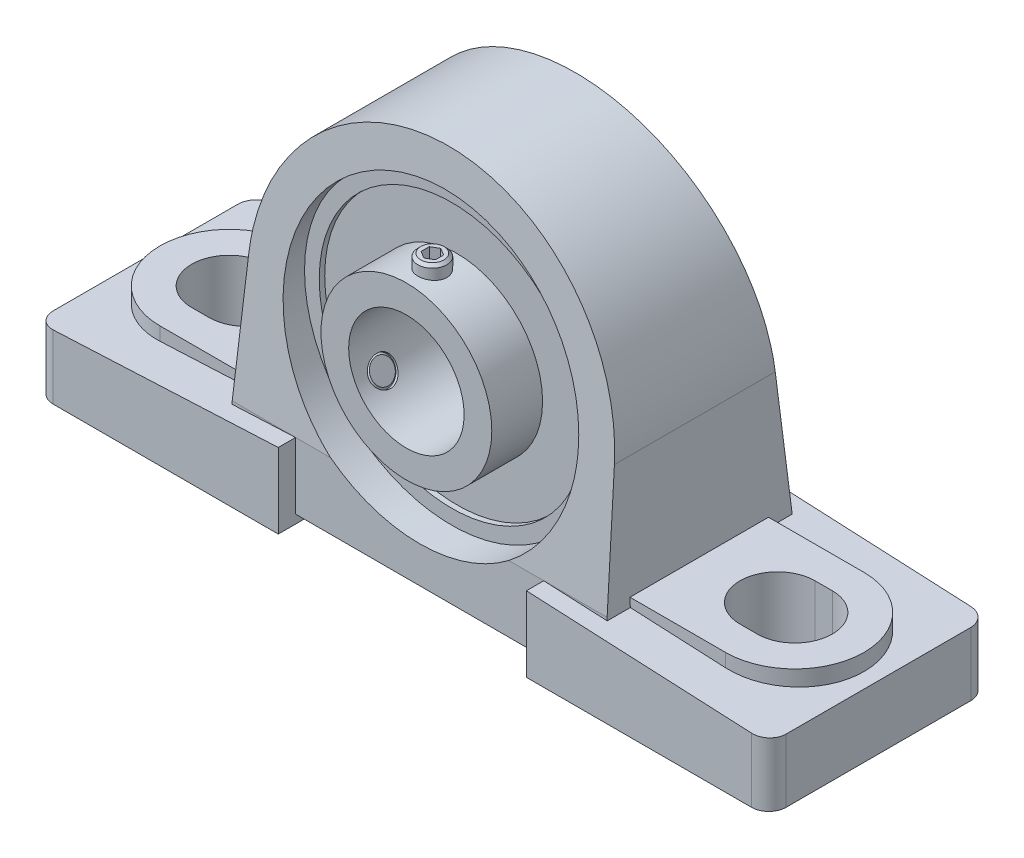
ISO-10303-21;
HEADER;
FILE_DESCRIPTION(('STEP AP214'),'2;1');
FILE_NAME('part.step','',(''),(''),'','','');
FILE_SCHEMA(('AUTOMOTIVE_DESIGN { 1 0 10303 214 1 1 1 1 }'));
ENDSEC;
DATA;
#1=APPLICATION_CONTEXT('core data for automotive mechanical design processes');
#2=APPLICATION_PROTOCOL_DEFINITION('international standard','automotive_design',2000,#1);
#3=PRODUCT_CONTEXT('',#1,'mechanical');
#4=PRODUCT('Part','Part','',(#3));
#5=PRODUCT_RELATED_PRODUCT_CATEGORY('part','',(#4));
#6=PRODUCT_DEFINITION_FORMATION('','',#4);
#7=PRODUCT_DEFINITION_CONTEXT('part definition',#1,'design');
#8=PRODUCT_DEFINITION('design','',#6,#7);
#9=PRODUCT_DEFINITION_SHAPE('','',#8);
#10=(LENGTH_UNIT() NAMED_UNIT(*) SI_UNIT(.MILLI.,.METRE.));
#11=(NAMED_UNIT(*) PLANE_ANGLE_UNIT() SI_UNIT($,.RADIAN.));
#12=(NAMED_UNIT(*) SI_UNIT($,.STERADIAN.) SOLID_ANGLE_UNIT());
#13=UNCERTAINTY_MEASURE_WITH_UNIT(LENGTH_MEASURE(1.E-05),#10,'distance_accuracy_value','');
#14=(GEOMETRIC_REPRESENTATION_CONTEXT(3) GLOBAL_UNCERTAINTY_ASSIGNED_CONTEXT((#13)) GLOBAL_UNIT_ASSIGNED_CONTEXT((#10,
#11,#12)) REPRESENTATION_CONTEXT('',''));
#15=CARTESIAN_POINT('',(0.,0.,0.));
#16=DIRECTION('',(0.,0.,1.));
#17=DIRECTION('',(1.,0.,0.));
#18=AXIS2_PLACEMENT_3D('',#15,#16,#17);
#19=CARTESIAN_POINT('',(32.777568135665,24.8,13.8));
#20=DIRECTION('',(0.866025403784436,0.500000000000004,0.));
#21=DIRECTION('',(-0.500000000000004,0.866025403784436,0.));
#22=AXIS2_PLACEMENT_3D('',#19,#20,#21);
#23=PLANE('',#22);
#24=CARTESIAN_POINT('',(32.7775681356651,24.8,13.8));
#25=DIRECTION('',(-0.866025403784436,-0.500000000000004,0.));
#26=DIRECTION('',(0.500000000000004,-0.866025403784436,0.));
#27=AXIS2_PLACEMENT_3D('',#24,#25,#26);
#28=CIRCLE('',#27,2.00950000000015);
#29=CARTESIAN_POINT('',(31.772818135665,26.540278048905,13.8));
#30=VERTEX_POINT('',#29);
#31=EDGE_CURVE('E453',#30,#30,#28,.T.);
#32=ORIENTED_EDGE('',*,*,#31,.T.);
#33=EDGE_LOOP('',(#32));
#34=FACE_BOUND('',#33,.T.);
#35=DIRECTION('',(0.433012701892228,-0.750000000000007,0.499999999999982));
#36=VECTOR('',#35,1.);
#37=CARTESIAN_POINT('',(32.152568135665,25.8825317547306,14.521687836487));
#38=LINE('',#37,#36);
#39=CARTESIAN_POINT('',(32.152568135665,25.8825317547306,14.521687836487));
#40=VERTEX_POINT('',#39);
#41=CARTESIAN_POINT('',(32.777568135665,24.8,15.243375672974));
#42=VERTEX_POINT('',#41);
#43=EDGE_CURVE('E52',#40,#42,#38,.T.);
#44=ORIENTED_EDGE('',*,*,#43,.T.);
#45=DIRECTION('',(0.433012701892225,-0.750000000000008,-0.499999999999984));
#46=VECTOR('',#45,1.);
#47=CARTESIAN_POINT('',(32.777568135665,24.8,15.243375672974));
#48=LINE('',#47,#46);
#49=CARTESIAN_POINT('',(33.402568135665,23.7174682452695,14.521687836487));
#50=VERTEX_POINT('',#49);
#51=EDGE_CURVE('E368',#42,#50,#48,.T.);
#52=ORIENTED_EDGE('',*,*,#51,.T.);
#53=DIRECTION('',(0.,0.,-1.));
#54=VECTOR('',#53,1.);
#55=CARTESIAN_POINT('',(33.402568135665,23.7174682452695,14.521687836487));
#56=LINE('',#55,#54);
#57=CARTESIAN_POINT('',(33.402568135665,23.7174682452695,13.078312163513));
#58=VERTEX_POINT('',#57);
#59=EDGE_CURVE('E376',#50,#58,#56,.T.);
#60=ORIENTED_EDGE('',*,*,#59,.T.);
#61=DIRECTION('',(-0.433012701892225,0.750000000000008,-0.499999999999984));
#62=VECTOR('',#61,1.);
#63=CARTESIAN_POINT('',(33.402568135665,23.7174682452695,13.078312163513));
#64=LINE('',#63,#62);
#65=CARTESIAN_POINT('',(32.777568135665,24.8,12.356624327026));
#66=VERTEX_POINT('',#65);
#67=EDGE_CURVE('E390',#58,#66,#64,.T.);
#68=ORIENTED_EDGE('',*,*,#67,.T.);
#69=DIRECTION('',(-0.433012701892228,0.750000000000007,0.499999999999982));
#70=VECTOR('',#69,1.);
#71=CARTESIAN_POINT('',(32.777568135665,24.8,12.356624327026));
#72=LINE('',#71,#70);
#73=CARTESIAN_POINT('',(32.152568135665,25.8825317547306,13.078312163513));
#74=VERTEX_POINT('',#73);
#75=EDGE_CURVE('E393',#66,#74,#72,.T.);
#76=ORIENTED_EDGE('',*,*,#75,.T.);
#77=DIRECTION('',(0.,0.,1.));
#78=VECTOR('',#77,1.);
#79=CARTESIAN_POINT('',(32.152568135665,25.8825317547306,13.078312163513));
#80=LINE('',#79,#78);
#81=EDGE_CURVE('E386',#74,#40,#80,.T.);
#82=ORIENTED_EDGE('',*,*,#81,.T.);
#83=EDGE_LOOP('',(#44,#52,#60,#68,#76,#82));
#84=FACE_BOUND('',#83,.T.);
#85=ADVANCED_FACE('F33',(#34,#84),#23,.F.);
#86=CARTESIAN_POINT('',(47.5,33.3,-12.7));
#87=DIRECTION('',(0.,0.,1.));
#88=DIRECTION('',(1.,0.,0.));
#89=AXIS2_PLACEMENT_3D('',#86,#87,#88);
#90=CYLINDRICAL_SURFACE('',#89,14.8);
#91=CARTESIAN_POINT('',(47.5,48.1,16.3));
#92=CARTESIAN_POINT('',(47.6393630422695,48.0999975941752,16.2999944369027));
#93=CARTESIAN_POINT('',(47.7788014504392,48.0980110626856,16.2883073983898));
#94=CARTESIAN_POINT('',(48.0537655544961,48.0902777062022,16.2418885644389));
#95=CARTESIAN_POINT('',(48.1892875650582,48.0845274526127,16.2071357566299));
#96=CARTESIAN_POINT('',(48.4524010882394,48.0699114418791,16.1156662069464));
#97=CARTESIAN_POINT('',(48.5799990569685,48.0610482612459,16.0589676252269));
#98=CARTESIAN_POINT('',(48.8238548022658,48.0411802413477,15.9252639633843));
#99=CARTESIAN_POINT('',(48.9401138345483,48.0301756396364,15.8482611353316));
#100=CARTESIAN_POINT('',(49.1591477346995,48.0071234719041,15.6753315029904));
#101=CARTESIAN_POINT('',(49.2617952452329,47.9950675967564,15.5792444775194));
#102=CARTESIAN_POINT('',(49.4495920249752,47.9713350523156,15.3712188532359));
#103=CARTESIAN_POINT('',(49.5347401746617,47.9596584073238,15.2592792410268));
#104=CARTESIAN_POINT('',(49.6856335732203,47.9379258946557,15.0218485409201));
#105=CARTESIAN_POINT('',(49.7512525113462,47.9278807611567,14.8962761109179));
#106=CARTESIAN_POINT('',(49.8604169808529,47.9106640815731,14.6356929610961));
#107=CARTESIAN_POINT('',(49.9039640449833,47.9034923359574,14.5006828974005));
#108=CARTESIAN_POINT('',(49.9673465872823,47.8929172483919,14.2264082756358));
#109=CARTESIAN_POINT('',(49.9874021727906,47.8894789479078,14.0871959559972));
#110=CARTESIAN_POINT('',(50.0039149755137,47.8866543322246,13.8073428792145));
#111=CARTESIAN_POINT('',(50.0003739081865,47.8872677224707,13.6667022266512));
#112=CARTESIAN_POINT('',(49.9699731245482,47.8924452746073,13.3895583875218));
#113=CARTESIAN_POINT('',(49.9433609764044,47.8969674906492,13.2530271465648));
#114=CARTESIAN_POINT('',(49.8679621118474,47.909387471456,12.9863957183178));
#115=CARTESIAN_POINT('',(49.819174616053,47.9172853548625,12.8562957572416));
#116=CARTESIAN_POINT('',(49.7005598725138,47.9356119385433,12.6054805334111));
#117=CARTESIAN_POINT('',(49.6306301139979,47.946052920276,12.4848146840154));
#118=CARTESIAN_POINT('',(49.4717886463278,47.9682807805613,12.2568360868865));
#119=CARTESIAN_POINT('',(49.3828753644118,47.9800677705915,12.1495244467));
#120=CARTESIAN_POINT('',(49.1872433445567,48.0038437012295,11.9498676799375));
#121=CARTESIAN_POINT('',(49.08031226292,48.0158333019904,11.8577305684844));
#122=CARTESIAN_POINT('',(48.8523973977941,48.0385248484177,11.6926751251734));
#123=CARTESIAN_POINT('',(48.7314135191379,48.0492267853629,11.6197569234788));
#124=CARTESIAN_POINT('',(48.4786295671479,48.0681530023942,11.4951890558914));
#125=CARTESIAN_POINT('',(48.3468201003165,48.0763751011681,11.4435581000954));
#126=CARTESIAN_POINT('',(48.0762305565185,48.0893977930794,11.3632251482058));
#127=CARTESIAN_POINT('',(47.9374510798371,48.0941986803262,11.3345211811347));
#128=CARTESIAN_POINT('',(47.6586535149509,48.0997983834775,11.3011397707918));
#129=CARTESIAN_POINT('',(47.518670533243,48.1006447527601,11.2961768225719));
#130=CARTESIAN_POINT('',(47.2398734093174,48.0983704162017,11.3096566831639));
#131=CARTESIAN_POINT('',(47.1010592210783,48.0952498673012,11.3280985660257));
#132=CARTESIAN_POINT('',(46.8294244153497,48.08542178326,11.387627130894));
#133=CARTESIAN_POINT('',(46.6965718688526,48.078736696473,11.4285721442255));
#134=CARTESIAN_POINT('',(46.4396168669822,48.0625260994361,11.531793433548));
#135=CARTESIAN_POINT('',(46.3155149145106,48.0530004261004,11.5940709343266));
#136=CARTESIAN_POINT('',(46.0783459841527,48.032047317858,11.7388410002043));
#137=CARTESIAN_POINT('',(45.9653891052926,48.0206034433,11.8215115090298));
#138=CARTESIAN_POINT('',(45.7548496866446,47.997132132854,12.0044765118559));
#139=CARTESIAN_POINT('',(45.6572682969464,47.9851046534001,12.1047723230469));
#140=CARTESIAN_POINT('',(45.4791887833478,47.9616675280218,12.321422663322));
#141=CARTESIAN_POINT('',(45.398883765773,47.9502658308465,12.4379369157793));
#142=CARTESIAN_POINT('',(45.258986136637,47.9295208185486,12.6829692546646));
#143=CARTESIAN_POINT('',(45.1993928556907,47.9201774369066,12.8114869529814));
#144=CARTESIAN_POINT('',(45.1028976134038,47.9046668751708,13.0763432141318));
#145=CARTESIAN_POINT('',(45.0659003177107,47.8984863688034,13.2126462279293));
#146=CARTESIAN_POINT('',(45.0153478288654,47.8899682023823,13.4896454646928));
#147=CARTESIAN_POINT('',(45.0017905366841,47.8876301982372,13.6303412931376));
#148=CARTESIAN_POINT('',(44.9985626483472,47.887076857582,13.9102034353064));
#149=CARTESIAN_POINT('',(45.0085880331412,47.8888090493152,14.0493662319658));
#150=CARTESIAN_POINT('',(45.0515826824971,47.8960857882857,14.3239943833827));
#151=CARTESIAN_POINT('',(45.0845518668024,47.9016303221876,14.4594597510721));
#152=CARTESIAN_POINT('',(45.1723805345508,47.9158868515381,14.7227253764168));
#153=CARTESIAN_POINT('',(45.227213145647,47.9245949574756,14.850534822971));
#154=CARTESIAN_POINT('',(45.3571807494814,47.9442011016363,15.0951895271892));
#155=CARTESIAN_POINT('',(45.4323167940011,47.9550992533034,15.212034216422));
#156=CARTESIAN_POINT('',(45.6018405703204,47.9780235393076,15.4329772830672));
#157=CARTESIAN_POINT('',(45.6964517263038,47.9900617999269,15.5369029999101));
#158=CARTESIAN_POINT('',(45.9017694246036,48.0138138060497,15.7275070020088));
#159=CARTESIAN_POINT('',(46.0124796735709,48.0255274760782,15.8141813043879));
#160=CARTESIAN_POINT('',(46.2477898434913,48.0474071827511,15.9683870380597));
#161=CARTESIAN_POINT('',(46.3724829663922,48.0575616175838,16.0357779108));
#162=CARTESIAN_POINT('',(46.6315418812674,48.0750658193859,16.1485522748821));
#163=CARTESIAN_POINT('',(46.7658979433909,48.0824183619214,16.1939575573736));
#164=CARTESIAN_POINT('',(47.0006363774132,48.0918966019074,16.2516814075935));
#165=CARTESIAN_POINT('',(47.0996032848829,48.0949190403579,16.2697716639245));
#166=CARTESIAN_POINT('',(47.2990337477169,48.0989715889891,16.2939328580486));
#167=CARTESIAN_POINT('',(47.3994972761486,48.1000017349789,16.3000040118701));
#168=CARTESIAN_POINT('',(47.5,48.1,16.3));
#169=B_SPLINE_CURVE_WITH_KNOTS('',3,(#91,#92,#93,#94,#95,#96,#97,#98,#99,#100,#101,#102,#103,
#104,#105,#106,#107,#108,#109,#110,#111,#112,#113,#114,#115,#116,#117,#118,#119,#120,#121,#122,
#123,#124,#125,#126,#127,#128,#129,#130,#131,#132,#133,#134,#135,#136,#137,#138,#139,#140,#141,
#142,#143,#144,#145,#146,#147,#148,#149,#150,#151,#152,#153,#154,#155,#156,#157,#158,#159,#160,
#161,#162,#163,#164,#165,#166,#167,#168),.UNSPECIFIED.,.T.,.F.,(4,2,2,2,2,2,2,2,2,2,2,2,2,2,2,2,
2,2,2,2,2,2,2,2,2,2,2,2,2,2,2,2,2,2,2,2,2,2,4),(0.,0.417721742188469,0.835824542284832,
1.25358209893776,1.67129333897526,2.09267219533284,2.51407800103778,2.93815292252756,
3.36219839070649,3.78223807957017,4.20224723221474,4.6178044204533,5.03337621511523,
5.45099618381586,5.8686507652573,6.29162447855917,6.71460105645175,7.13794861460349,
7.56125977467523,7.97946725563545,8.39765819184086,8.81324606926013,9.22885781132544,
9.6482329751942,10.067639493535,10.4915149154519,10.9153766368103,11.3374374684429,
11.759460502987,12.1760728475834,12.5926837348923,13.0087841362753,13.4249060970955,
13.8460984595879,14.2673879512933,14.6916742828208,15.1155392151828,15.4167878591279,
15.7180310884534),.UNSPECIFIED.);
#170=CARTESIAN_POINT('',(47.5,48.1,16.3));
#171=VERTEX_POINT('',#170);
#172=EDGE_CURVE('E45',#171,#171,#169,.T.);
#173=ORIENTED_EDGE('',*,*,#172,.F.);
#174=EDGE_LOOP('',(#173));
#175=FACE_BOUND('',#174,.T.);
#176=CARTESIAN_POINT('',(47.5,33.3,9.5));
#177=DIRECTION('',(0.,0.,1.));
#178=DIRECTION('',(1.,0.,0.));
#179=AXIS2_PLACEMENT_3D('',#176,#177,#178);
#180=CIRCLE('',#179,14.8);
#181=CARTESIAN_POINT('',(62.3,33.3,9.5));
#182=VERTEX_POINT('',#181);
#183=EDGE_CURVE('E526',#182,#182,#180,.F.);
#184=ORIENTED_EDGE('',*,*,#183,.F.);
#185=EDGE_LOOP('',(#184));
#186=FACE_BOUND('',#185,.T.);
#187=CARTESIAN_POINT('',(47.5,33.3,18.3));
#188=DIRECTION('',(0.,0.,1.));
#189=DIRECTION('',(1.,0.,0.));
#190=AXIS2_PLACEMENT_3D('',#187,#188,#189);
#191=CIRCLE('',#190,14.8);
#192=CARTESIAN_POINT('',(62.3,33.3,18.3));
#193=VERTEX_POINT('',#192);
#194=EDGE_CURVE('E522',#193,#193,#191,.T.);
#195=ORIENTED_EDGE('',*,*,#194,.F.);
#196=EDGE_LOOP('',(#195));
#197=FACE_BOUND('',#196,.T.);
#198=CARTESIAN_POINT('',(36.1170074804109,23.8412748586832,13.8));
#199=CARTESIAN_POINT('',(36.1170024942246,23.8412784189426,13.939347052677));
#200=CARTESIAN_POINT('',(36.1094145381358,23.8503895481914,14.0787695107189));
#201=CARTESIAN_POINT('',(36.0794230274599,23.8866608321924,14.3537004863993));
#202=CARTESIAN_POINT('',(36.0570059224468,23.9138374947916,14.4892053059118));
#203=CARTESIAN_POINT('',(35.9984847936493,23.9856412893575,14.75228244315));
#204=CARTESIAN_POINT('',(35.9623923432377,24.0302536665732,14.8798613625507));
#205=CARTESIAN_POINT('',(35.8782244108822,24.1360009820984,15.1236850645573));
#206=CARTESIAN_POINT('',(35.8301502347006,24.1971341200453,15.2399310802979));
#207=CARTESIAN_POINT('',(35.7236673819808,24.3353112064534,15.4589791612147));
#208=CARTESIAN_POINT('',(35.6651690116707,24.4124943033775,15.5616498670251));
#209=CARTESIAN_POINT('',(35.5406203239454,24.5808155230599,15.7494915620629));
#210=CARTESIAN_POINT('',(35.4745695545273,24.671954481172,15.8346615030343));
#211=CARTESIAN_POINT('',(35.3371395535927,24.8667857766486,15.985578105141));
#212=CARTESIAN_POINT('',(35.2657301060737,24.9705517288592,16.051202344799));
#213=CARTESIAN_POINT('',(35.1206817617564,25.1876941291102,16.1603776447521));
#214=CARTESIAN_POINT('',(35.0470430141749,25.301069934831,16.2039301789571));
#215=CARTESIAN_POINT('',(34.900871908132,25.533365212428,16.2673235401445));
#216=CARTESIAN_POINT('',(34.8283356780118,25.6522219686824,16.2873851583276));
#217=CARTESIAN_POINT('',(34.686006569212,25.8931691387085,16.3039139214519));
#218=CARTESIAN_POINT('',(34.6162134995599,26.0152593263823,16.3003827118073));
#219=CARTESIAN_POINT('',(34.4820391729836,26.2578607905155,16.2699979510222));
#220=CARTESIAN_POINT('',(34.4176100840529,26.3783754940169,16.2433820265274));
#221=CARTESIAN_POINT('',(34.2948712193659,26.615509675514,16.1679577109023));
#222=CARTESIAN_POINT('',(34.2365616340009,26.7321290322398,16.1191486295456));
#223=CARTESIAN_POINT('',(34.1268548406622,26.9584783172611,16.0004883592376));
#224=CARTESIAN_POINT('',(34.0754913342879,27.0681733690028,15.9305395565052));
#225=CARTESIAN_POINT('',(33.9806490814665,27.276687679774,15.7716569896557));
#226=CARTESIAN_POINT('',(33.9371709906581,27.3755060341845,15.682721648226));
#227=CARTESIAN_POINT('',(33.8579385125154,27.5602779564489,15.4870734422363));
#228=CARTESIAN_POINT('',(33.822287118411,27.6460558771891,15.3801528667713));
#229=CARTESIAN_POINT('',(33.7595184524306,27.8003521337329,15.1522683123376));
#230=CARTESIAN_POINT('',(33.7324012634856,27.8688703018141,15.0313041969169));
#231=CARTESIAN_POINT('',(33.6866589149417,27.9862816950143,14.7785266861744));
#232=CARTESIAN_POINT('',(33.6680437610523,28.0351517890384,14.6467007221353));
#233=CARTESIAN_POINT('',(33.6392951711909,28.1113070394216,14.376075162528));
#234=CARTESIAN_POINT('',(33.6291609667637,28.1385941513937,14.2372761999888));
#235=CARTESIAN_POINT('',(33.6173957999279,28.1703228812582,13.9584678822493));
#236=CARTESIAN_POINT('',(33.6156620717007,28.1750405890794,13.8184942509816));
#237=CARTESIAN_POINT('',(33.6204099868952,28.1621963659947,13.5397182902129));
#238=CARTESIAN_POINT('',(33.6268913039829,28.1446353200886,13.4009159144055));
#239=CARTESIAN_POINT('',(33.6480319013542,28.0881028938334,13.1293485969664));
#240=CARTESIAN_POINT('',(33.6626375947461,28.0492718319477,12.9965501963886));
#241=CARTESIAN_POINT('',(33.7000457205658,27.9517316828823,12.7396975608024));
#242=CARTESIAN_POINT('',(33.7228486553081,27.8930213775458,12.6156438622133));
#243=CARTESIAN_POINT('',(33.7769486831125,27.757145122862,12.3785105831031));
#244=CARTESIAN_POINT('',(33.8083241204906,27.6798097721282,12.2655459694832));
#245=CARTESIAN_POINT('',(33.8794328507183,27.5096082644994,12.0549870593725));
#246=CARTESIAN_POINT('',(33.9191667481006,27.4167409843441,11.9573938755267));
#247=CARTESIAN_POINT('',(34.0072515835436,27.2174253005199,11.779284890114));
#248=CARTESIAN_POINT('',(34.0556901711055,27.1108422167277,11.6989629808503));
#249=CARTESIAN_POINT('',(34.1603800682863,26.8883202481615,11.5590357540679));
#250=CARTESIAN_POINT('',(34.2166311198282,26.77238167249,11.4994297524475));
#251=CARTESIAN_POINT('',(34.3357709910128,26.5353436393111,11.402926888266));
#252=CARTESIAN_POINT('',(34.3986288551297,26.4142697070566,11.3659292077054));
#253=CARTESIAN_POINT('',(34.529827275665,26.1702174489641,11.3153688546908));
#254=CARTESIAN_POINT('',(34.5981673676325,26.0472392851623,11.3018041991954));
#255=CARTESIAN_POINT('',(34.7376275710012,25.8045885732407,11.298553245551));
#256=CARTESIAN_POINT('',(34.8087025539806,25.6848939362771,11.308572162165));
#257=CARTESIAN_POINT('',(34.9522663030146,25.4505883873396,11.3515655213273));
#258=CARTESIAN_POINT('',(35.0247550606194,25.3359774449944,11.3845398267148));
#259=CARTESIAN_POINT('',(35.168633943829,25.1149652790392,11.4723936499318));
#260=CARTESIAN_POINT('',(35.240025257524,25.0085545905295,11.5272474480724));
#261=CARTESIAN_POINT('',(35.3792380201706,24.8063425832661,11.657270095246));
#262=CARTESIAN_POINT('',(35.4470592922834,24.7105417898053,11.7324399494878));
#263=CARTESIAN_POINT('',(35.5773140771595,24.5306181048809,11.902002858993));
#264=CARTESIAN_POINT('',(35.6396748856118,24.4466457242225,11.9966114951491));
#265=CARTESIAN_POINT('',(35.755542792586,24.2935040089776,12.2019143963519));
#266=CARTESIAN_POINT('',(35.8090478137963,24.2243381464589,12.3126124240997));
#267=CARTESIAN_POINT('',(35.9051929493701,24.1018166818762,12.5479108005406));
#268=CARTESIAN_POINT('',(35.9477510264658,24.0485799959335,12.672606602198));
#269=CARTESIAN_POINT('',(36.0194382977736,23.9597650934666,12.9316707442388));
#270=CARTESIAN_POINT('',(36.0485808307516,23.9241693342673,13.0660293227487));
#271=CARTESIAN_POINT('',(36.0857453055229,23.8789938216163,13.3007489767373));
#272=CARTESIAN_POINT('',(36.0974390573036,23.8648659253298,13.3996933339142));
#273=CARTESIAN_POINT('',(36.1130718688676,23.846005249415,13.5990787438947));
#274=CARTESIAN_POINT('',(36.1170110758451,23.8412722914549,13.6995197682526));
#275=CARTESIAN_POINT('',(36.1170074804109,23.8412748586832,13.8));
#276=B_SPLINE_CURVE_WITH_KNOTS('',3,(#198,#199,#200,#201,#202,#203,#204,#205,#206,#207,#208,
#209,#210,#211,#212,#213,#214,#215,#216,#217,#218,#219,#220,#221,#222,#223,#224,#225,#226,#227,
#228,#229,#230,#231,#232,#233,#234,#235,#236,#237,#238,#239,#240,#241,#242,#243,#244,#245,#246,
#247,#248,#249,#250,#251,#252,#253,#254,#255,#256,#257,#258,#259,#260,#261,#262,#263,#264,#265,
#266,#267,#268,#269,#270,#271,#272,#273,#274,#275),.UNSPECIFIED.,.T.,.F.,(4,2,2,2,2,2,2,2,2,2,2,
2,2,2,2,2,2,2,2,2,2,2,2,2,2,2,2,2,2,2,2,2,2,2,2,2,2,2,4),(0.,0.417673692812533,
0.835729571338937,1.25343243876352,1.67108980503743,2.09253155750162,2.51399854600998,
2.938052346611,3.36207782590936,3.78208505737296,4.20206299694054,4.61776844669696,
5.03348682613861,5.45115492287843,5.86885773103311,6.29176539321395,6.71467716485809,
7.13808537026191,7.56145520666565,7.97963251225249,8.39779320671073,8.81322794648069,
9.22868814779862,9.64808016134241,10.0675025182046,10.4914124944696,10.9153084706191,
11.3373000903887,11.7592559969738,12.1759656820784,12.5926728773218,13.0088916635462,
13.4251310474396,13.8462633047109,14.2674942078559,14.6917954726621,15.1156739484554,
15.4168553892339,15.7180311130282),.UNSPECIFIED.);
#277=CARTESIAN_POINT('',(36.1170074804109,23.8412748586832,13.8));
#278=VERTEX_POINT('',#277);
#279=EDGE_CURVE('E11',#278,#278,#276,.T.);
#280=ORIENTED_EDGE('',*,*,#279,.F.);
#281=EDGE_LOOP('',(#280));
#282=FACE_BOUND('',#281,.T.);
#283=ADVANCED_FACE('F884',(#175,#186,#197,#282),#90,.T.);
#284=CARTESIAN_POINT('',(47.5,33.3,13.8));
#285=DIRECTION('',(-0.866025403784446,-0.499999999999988,0.));
#286=DIRECTION('',(0.499999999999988,-0.866025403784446,0.));
#287=AXIS2_PLACEMENT_3D('',#284,#285,#286);
#288=CYLINDRICAL_SURFACE('',#287,2.37499999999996);
#289=CARTESIAN_POINT('',(40.2750371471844,26.3862519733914,13.8));
#290=CARTESIAN_POINT('',(40.2750328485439,26.3862542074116,13.931370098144));
#291=CARTESIAN_POINT('',(40.2672355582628,26.3943766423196,14.0627869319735));
#292=CARTESIAN_POINT('',(40.2364939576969,26.4267212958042,14.3218619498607));
#293=CARTESIAN_POINT('',(40.2135399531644,26.4509538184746,14.4495176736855));
#294=CARTESIAN_POINT('',(40.1538370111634,26.5150319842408,14.6972856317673));
#295=CARTESIAN_POINT('',(40.117104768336,26.5548587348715,14.8174067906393));
#296=CARTESIAN_POINT('',(40.0317986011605,26.6494356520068,15.0470853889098));
#297=CARTESIAN_POINT('',(39.9832244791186,26.7041860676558,15.1566426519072));
#298=CARTESIAN_POINT('',(39.8756422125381,26.8288294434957,15.3642619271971));
#299=CARTESIAN_POINT('',(39.8164628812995,26.8989758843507,15.4620831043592));
#300=CARTESIAN_POINT('',(39.6910221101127,27.052625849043,15.6413368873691));
#301=CARTESIAN_POINT('',(39.6247600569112,27.1361305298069,15.7227680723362));
#302=CARTESIAN_POINT('',(39.4871533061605,27.316083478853,15.8679021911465));
#303=CARTESIAN_POINT('',(39.4157553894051,27.4126806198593,15.9313705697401));
#304=CARTESIAN_POINT('',(39.2716102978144,27.6158906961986,16.0372555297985));
#305=CARTESIAN_POINT('',(39.1988633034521,27.7225022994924,16.0796749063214));
#306=CARTESIAN_POINT('',(39.056178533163,27.9410274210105,16.1414920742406));
#307=CARTESIAN_POINT('',(38.9862137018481,28.0528076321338,16.1612983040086));
#308=CARTESIAN_POINT('',(38.8501090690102,28.2803435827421,16.1786069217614));
#309=CARTESIAN_POINT('',(38.7839687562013,28.3960987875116,16.1761122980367));
#310=CARTESIAN_POINT('',(38.6587010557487,28.6257926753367,16.1491881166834));
#311=CARTESIAN_POINT('',(38.5994596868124,28.739721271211,16.1251991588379));
#312=CARTESIAN_POINT('',(38.4877460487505,28.9646729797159,16.056672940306));
#313=CARTESIAN_POINT('',(38.4352741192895,29.0756959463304,16.0121346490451));
#314=CARTESIAN_POINT('',(38.3374036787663,29.2923707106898,15.9034039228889));
#315=CARTESIAN_POINT('',(38.2920678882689,29.3979699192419,15.8390504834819));
#316=CARTESIAN_POINT('',(38.209228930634,29.5995317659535,15.6926374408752));
#317=CARTESIAN_POINT('',(38.1717270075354,29.6954928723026,15.610575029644));
#318=CARTESIAN_POINT('',(38.1036079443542,29.8769239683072,15.4286959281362));
#319=CARTESIAN_POINT('',(38.0731817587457,29.9620797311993,15.3284938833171));
#320=CARTESIAN_POINT('',(38.020057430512,30.1160803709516,15.1144238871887));
#321=CARTESIAN_POINT('',(37.9973595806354,30.1849246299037,15.0005554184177));
#322=CARTESIAN_POINT('',(37.9591720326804,30.3039124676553,14.7617168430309));
#323=CARTESIAN_POINT('',(37.9437116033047,30.353979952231,14.6367040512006));
#324=CARTESIAN_POINT('',(37.9197377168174,30.4328945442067,14.3795225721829));
#325=CARTESIAN_POINT('',(37.9112229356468,30.4617456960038,14.2473552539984));
#326=CARTESIAN_POINT('',(37.9010032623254,30.4965048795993,13.9830048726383));
#327=CARTESIAN_POINT('',(37.8991403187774,30.5029453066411,13.8508978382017));
#328=CARTESIAN_POINT('',(37.9017269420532,30.4940820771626,13.5874858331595));
#329=CARTESIAN_POINT('',(37.9061759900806,30.4787802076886,13.4561807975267));
#330=CARTESIAN_POINT('',(37.9214084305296,30.4274968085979,13.2000532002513));
#331=CARTESIAN_POINT('',(37.9320994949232,30.3918168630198,13.0751644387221));
#332=CARTESIAN_POINT('',(37.9600272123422,30.3014769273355,12.8332338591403));
#333=CARTESIAN_POINT('',(37.9772645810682,30.2468148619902,12.7161929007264));
#334=CARTESIAN_POINT('',(38.0190383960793,30.1194462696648,12.4909715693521));
#335=CARTESIAN_POINT('',(38.0436999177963,30.0464343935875,12.3829871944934));
#336=CARTESIAN_POINT('',(38.1006151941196,29.8854963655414,12.1810323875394));
#337=CARTESIAN_POINT('',(38.1328700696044,29.7975680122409,12.0870640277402));
#338=CARTESIAN_POINT('',(38.2060835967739,29.6076176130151,11.9136589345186));
#339=CARTESIAN_POINT('',(38.2472205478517,29.5053246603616,11.8345936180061));
#340=CARTESIAN_POINT('',(38.3377788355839,29.2916148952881,11.6959191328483));
#341=CARTESIAN_POINT('',(38.3871997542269,29.1801985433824,11.6363089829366));
#342=CARTESIAN_POINT('',(38.4935275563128,28.9526910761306,11.5387272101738));
#343=CARTESIAN_POINT('',(38.550379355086,28.8366383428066,11.500606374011));
#344=CARTESIAN_POINT('',(38.6708284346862,28.6028732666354,11.4466289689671));
#345=CARTESIAN_POINT('',(38.7344245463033,28.4851612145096,11.4307685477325));
#346=CARTESIAN_POINT('',(38.8651081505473,28.2546284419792,11.4219610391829));
#347=CARTESIAN_POINT('',(38.9320722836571,28.1417584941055,11.4284632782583));
#348=CARTESIAN_POINT('',(39.0688266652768,27.9211373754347,11.4629474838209));
#349=CARTESIAN_POINT('',(39.138616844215,27.8133860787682,11.4909289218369));
#350=CARTESIAN_POINT('',(39.2782937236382,27.606222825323,11.567294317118));
#351=CARTESIAN_POINT('',(39.3481786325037,27.5067760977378,11.6155875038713));
#352=CARTESIAN_POINT('',(39.4857643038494,27.3178853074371,11.7311213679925));
#353=CARTESIAN_POINT('',(39.5534648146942,27.2284423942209,11.7983642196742));
#354=CARTESIAN_POINT('',(39.6854483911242,27.0594436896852,11.951616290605));
#355=CARTESIAN_POINT('',(39.7496238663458,26.980147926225,12.0380049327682));
#356=CARTESIAN_POINT('',(39.870113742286,26.8351921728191,12.2263476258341));
#357=CARTESIAN_POINT('',(39.9264261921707,26.7695355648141,12.3283055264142));
#358=CARTESIAN_POINT('',(40.0293553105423,26.6520164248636,12.5469046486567));
#359=CARTESIAN_POINT('',(40.0757978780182,26.6003976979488,12.6637591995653));
#360=CARTESIAN_POINT('',(40.1552890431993,26.5133423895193,12.9075502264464));
#361=CARTESIAN_POINT('',(40.1883480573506,26.4778932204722,13.0344787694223));
#362=CARTESIAN_POINT('',(40.2339327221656,26.4294018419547,13.2677831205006));
#363=CARTESIAN_POINT('',(40.249291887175,26.4132407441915,13.3729762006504));
#364=CARTESIAN_POINT('',(40.2698455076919,26.3916652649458,13.5854358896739));
#365=CARTESIAN_POINT('',(40.2750406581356,26.3862501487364,13.692702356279));
#366=CARTESIAN_POINT('',(40.2750371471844,26.3862519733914,13.8));
#367=B_SPLINE_CURVE_WITH_KNOTS('',3,(#289,#290,#291,#292,#293,#294,#295,#296,#297,#298,#299,
#300,#301,#302,#303,#304,#305,#306,#307,#308,#309,#310,#311,#312,#313,#314,#315,#316,#317,#318,
#319,#320,#321,#322,#323,#324,#325,#326,#327,#328,#329,#330,#331,#332,#333,#334,#335,#336,#337,
#338,#339,#340,#341,#342,#343,#344,#345,#346,#347,#348,#349,#350,#351,#352,#353,#354,#355,#356,
#357,#358,#359,#360,#361,#362,#363,#364,#365,#366),.UNSPECIFIED.,.T.,.F.,(4,2,2,2,2,2,2,2,2,2,2,
2,2,2,2,2,2,2,2,2,2,2,2,2,2,2,2,2,2,2,2,2,2,2,2,2,2,2,4),(0.,0.393716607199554,0.78768528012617,
1.18117812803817,1.57467754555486,1.9752197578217,2.37579667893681,2.7813854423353,
3.1869203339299,3.58500844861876,3.98304322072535,4.37310098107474,4.76317830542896,
5.15651272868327,5.54990956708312,5.95293410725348,6.35597391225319,6.76062985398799,
7.16520863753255,7.56010795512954,7.95497481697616,8.34414393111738,8.73335560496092,
9.12953096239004,9.52576483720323,9.93084810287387,10.3359109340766,10.7381253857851,
11.140270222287,11.5325839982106,11.9248881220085,12.3154574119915,12.7060715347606,
13.1052571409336,13.504541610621,13.9103724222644,14.3158867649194,14.6374801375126,
14.9590515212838),.UNSPECIFIED.);
#368=CARTESIAN_POINT('',(40.2750371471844,26.3862519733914,13.8));
#369=VERTEX_POINT('',#368);
#370=EDGE_CURVE('E844',#369,#369,#367,.T.);
#371=ORIENTED_EDGE('',*,*,#370,.F.);
#372=EDGE_LOOP('',(#371));
#373=FACE_BOUND('',#372,.T.);
#374=CARTESIAN_POINT('',(38.5232136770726,28.1172499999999,13.8));
#375=DIRECTION('',(-0.866025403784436,-0.500000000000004,0.));
#376=DIRECTION('',(0.500000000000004,-0.866025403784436,0.));
#377=AXIS2_PLACEMENT_3D('',#374,#375,#376);
#378=CIRCLE('',#377,2.37499999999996);
#379=CARTESIAN_POINT('',(39.7107136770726,26.0604396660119,13.8));
#380=VERTEX_POINT('',#379);
#381=EDGE_CURVE('E471',#380,#380,#378,.T.);
#382=ORIENTED_EDGE('',*,*,#381,.T.);
#383=EDGE_LOOP('',(#382));
#384=FACE_BOUND('',#383,.T.);
#385=ADVANCED_FACE('F857',(#373,#384),#288,.F.);
#386=CARTESIAN_POINT('',(47.5,33.3,13.8));
#387=DIRECTION('',(0.,1.,0.));
#388=DIRECTION('',(0.,0.,1.));
#389=AXIS2_PLACEMENT_3D('',#386,#387,#388);
#390=CYLINDRICAL_SURFACE('',#389,2.375);
#391=CARTESIAN_POINT('',(47.5,43.3,16.175));
#392=CARTESIAN_POINT('',(47.6314290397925,43.29999766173,16.1749959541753));
#393=CARTESIAN_POINT('',(47.7629047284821,43.2973829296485,16.1640535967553));
#394=CARTESIAN_POINT('',(48.0221018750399,43.2872052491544,16.1206304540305));
#395=CARTESIAN_POINT('',(48.1498209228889,43.2796391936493,16.0881361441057));
#396=CARTESIAN_POINT('',(48.3977231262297,43.2603986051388,16.0026997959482));
#397=CARTESIAN_POINT('',(48.517914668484,43.2487287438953,15.9497810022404));
#398=CARTESIAN_POINT('',(48.7477123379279,43.2225302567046,15.8250763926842));
#399=CARTESIAN_POINT('',(48.857318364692,43.2080016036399,15.7532903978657));
#400=CARTESIAN_POINT('',(49.0648873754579,43.1773646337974,15.5914683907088));
#401=CARTESIAN_POINT('',(49.1626238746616,43.1612338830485,15.5011460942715));
#402=CARTESIAN_POINT('',(49.3417128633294,43.1293634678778,15.3054290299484));
#403=CARTESIAN_POINT('',(49.423063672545,43.1136238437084,15.2000327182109));
#404=CARTESIAN_POINT('',(49.5681097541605,43.084093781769,14.9754357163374));
#405=CARTESIAN_POINT('',(49.6315567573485,43.0703319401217,14.8560705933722));
#406=CARTESIAN_POINT('',(49.7373993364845,43.0466407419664,14.6079902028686));
#407=CARTESIAN_POINT('',(49.779797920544,43.0367108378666,14.4792762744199));
#408=CARTESIAN_POINT('',(49.8415774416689,43.0220375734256,14.2186289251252));
#409=CARTESIAN_POINT('',(49.861363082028,43.0172031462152,14.0867966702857));
#410=CARTESIAN_POINT('',(49.8786147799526,43.0129952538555,13.8216022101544));
#411=CARTESIAN_POINT('',(49.8760840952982,43.0136209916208,13.6882402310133));
#412=CARTESIAN_POINT('',(49.8490990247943,43.0201806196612,13.4268344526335));
#413=CARTESIAN_POINT('',(49.8251217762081,43.0259989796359,13.2987380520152));
#414=CARTESIAN_POINT('',(49.7566831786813,43.0421047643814,13.0484397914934));
#415=CARTESIAN_POINT('',(49.7122204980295,43.0523924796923,12.9262383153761));
#416=CARTESIAN_POINT('',(49.6036536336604,43.076387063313,12.6898937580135));
#417=CARTESIAN_POINT('',(49.5393720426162,43.0901245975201,12.5758354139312));
#418=CARTESIAN_POINT('',(49.3931164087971,43.1194530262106,12.3599508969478));
#419=CARTESIAN_POINT('',(49.3111395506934,43.1350442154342,12.2581266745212));
#420=CARTESIAN_POINT('',(49.1293263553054,43.1668135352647,12.0668610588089));
#421=CARTESIAN_POINT('',(49.0290860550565,43.1829964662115,11.9778040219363));
#422=CARTESIAN_POINT('',(48.8149033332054,43.2137639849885,11.8176954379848));
#423=CARTESIAN_POINT('',(48.7009605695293,43.2283485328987,11.7466443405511));
#424=CARTESIAN_POINT('',(48.4620919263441,43.254337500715,11.6244427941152));
#425=CARTESIAN_POINT('',(48.3371356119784,43.2657327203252,11.57334975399));
#426=CARTESIAN_POINT('',(48.0800782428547,43.2839917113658,11.4929977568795));
#427=CARTESIAN_POINT('',(47.9479784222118,43.2908562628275,11.463735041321));
#428=CARTESIAN_POINT('',(47.6836744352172,43.2991668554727,11.4284497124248));
#429=CARTESIAN_POINT('',(47.5515439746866,43.3007350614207,11.4219030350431));
#430=CARTESIAN_POINT('',(47.2880765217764,43.298621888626,11.4308052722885));
#431=CARTESIAN_POINT('',(47.156739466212,43.2949409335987,11.4462524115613));
#432=CARTESIAN_POINT('',(46.9003729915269,43.2828208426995,11.498270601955));
#433=CARTESIAN_POINT('',(46.7752832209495,43.2744451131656,11.5345603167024));
#434=CARTESIAN_POINT('',(46.5329700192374,43.2538762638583,11.6269159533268));
#435=CARTESIAN_POINT('',(46.4157473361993,43.2416827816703,11.682983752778));
#436=CARTESIAN_POINT('',(46.1903765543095,43.2145344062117,11.8143510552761));
#437=CARTESIAN_POINT('',(46.0824081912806,43.1995376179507,11.8899500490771));
#438=CARTESIAN_POINT('',(45.8805030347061,43.168519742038,12.0578462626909));
#439=CARTESIAN_POINT('',(45.7865684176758,43.1524984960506,12.1501460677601));
#440=CARTESIAN_POINT('',(45.6132733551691,43.1208048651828,12.351246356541));
#441=CARTESIAN_POINT('',(45.5342787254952,43.1051478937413,12.4603649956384));
#442=CARTESIAN_POINT('',(45.3957283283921,43.0763524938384,12.6906234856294));
#443=CARTESIAN_POINT('',(45.3361716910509,43.06321395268,12.8117627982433));
#444=CARTESIAN_POINT('',(45.2386190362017,43.0410810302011,13.0619627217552));
#445=CARTESIAN_POINT('',(45.2004962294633,43.0320623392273,13.1909716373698));
#446=CARTESIAN_POINT('',(45.1465412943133,43.0191571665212,13.4538110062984));
#447=CARTESIAN_POINT('',(45.1307048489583,43.0152696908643,13.5876405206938));
#448=CARTESIAN_POINT('',(45.1219808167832,43.0131375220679,13.8526145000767));
#449=CARTESIAN_POINT('',(45.1285106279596,43.01474957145,13.9837389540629));
#450=CARTESIAN_POINT('',(45.1630131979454,43.0231065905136,14.2429604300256));
#451=CARTESIAN_POINT('',(45.1909856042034,43.0298514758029,14.3710575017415));
#452=CARTESIAN_POINT('',(45.2672758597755,43.0476383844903,14.6200253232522));
#453=CARTESIAN_POINT('',(45.3154945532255,43.0586594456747,14.740928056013));
#454=CARTESIAN_POINT('',(45.4308281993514,43.0837618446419,14.9730089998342));
#455=CARTESIAN_POINT('',(45.4979455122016,43.0978435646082,15.0841859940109));
#456=CARTESIAN_POINT('',(45.6510413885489,43.1278972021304,15.2964987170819));
#457=CARTESIAN_POINT('',(45.7374288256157,43.1439059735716,15.3973344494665));
#458=CARTESIAN_POINT('',(45.9258025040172,43.1757789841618,15.5832682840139));
#459=CARTESIAN_POINT('',(46.0277923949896,43.1916431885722,15.6683626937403));
#460=CARTESIAN_POINT('',(46.2464331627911,43.2217400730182,15.8217090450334));
#461=CARTESIAN_POINT('',(46.3632914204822,43.2359427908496,15.8896715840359));
#462=CARTESIAN_POINT('',(46.6070952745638,43.2608074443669,16.0048795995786));
#463=CARTESIAN_POINT('',(46.7340330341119,43.2714720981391,16.0521409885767));
#464=CARTESIAN_POINT('',(46.9674166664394,43.2863453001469,16.1169985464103));
#465=CARTESIAN_POINT('',(47.0726837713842,43.2914321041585,16.138704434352));
#466=CARTESIAN_POINT('',(47.2852902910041,43.2982603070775,16.167706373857));
#467=CARTESIAN_POINT('',(47.3926295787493,43.3000019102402,16.1750033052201));
#468=CARTESIAN_POINT('',(47.5,43.3,16.175));
#469=B_SPLINE_CURVE_WITH_KNOTS('',3,(#391,#392,#393,#394,#395,#396,#397,#398,#399,#400,#401,
#402,#403,#404,#405,#406,#407,#408,#409,#410,#411,#412,#413,#414,#415,#416,#417,#418,#419,#420,
#421,#422,#423,#424,#425,#426,#427,#428,#429,#430,#431,#432,#433,#434,#435,#436,#437,#438,#439,
#440,#441,#442,#443,#444,#445,#446,#447,#448,#449,#450,#451,#452,#453,#454,#455,#456,#457,#458,
#459,#460,#461,#462,#463,#464,#465,#466,#467,#468),.UNSPECIFIED.,.T.,.F.,(4,2,2,2,2,2,2,2,2,2,2,
2,2,2,2,2,2,2,2,2,2,2,2,2,2,2,2,2,2,2,2,2,2,2,2,2,2,2,4),(0.,0.393893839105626,
0.788035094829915,1.18172910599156,1.5754268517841,1.9757373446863,2.37608886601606,
2.78174607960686,3.18734530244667,3.58556590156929,3.98372836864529,4.37324707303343,
4.76279110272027,5.15592864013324,5.54912877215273,5.95240877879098,6.35569885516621,
6.76014059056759,7.16451267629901,7.5594914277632,7.95443829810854,8.34417536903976,
8.73394944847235,9.13009724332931,9.52630641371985,9.93122624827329,10.3361279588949,
10.7386086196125,11.1410113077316,11.5330126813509,11.9250076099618,12.3151047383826,
12.7052506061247,13.1046320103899,13.5041069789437,13.9099355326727,14.3154515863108,
14.6372612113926,14.9590511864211),.UNSPECIFIED.);
#470=CARTESIAN_POINT('',(47.5,43.3,16.175));
#471=VERTEX_POINT('',#470);
#472=EDGE_CURVE('E503',#471,#471,#469,.T.);
#473=ORIENTED_EDGE('',*,*,#472,.F.);
#474=EDGE_LOOP('',(#473));
#475=FACE_BOUND('',#474,.T.);
#476=CARTESIAN_POINT('',(47.5,43.6655,13.8));
#477=DIRECTION('',(0.,1.,0.));
#478=DIRECTION('',(0.,0.,1.));
#479=AXIS2_PLACEMENT_3D('',#476,#477,#478);
#480=CIRCLE('',#479,2.375);
#481=CARTESIAN_POINT('',(47.5,43.6655,16.175));
#482=VERTEX_POINT('',#481);
#483=EDGE_CURVE('E481',#482,#482,#480,.T.);
#484=ORIENTED_EDGE('',*,*,#483,.T.);
#485=EDGE_LOOP('',(#484));
#486=FACE_BOUND('',#485,.T.);
#487=ADVANCED_FACE('F853',(#475,#486),#390,.F.);
#488=CARTESIAN_POINT('',(47.5,33.3,-13.97));
#489=DIRECTION('',(0.,0.,1.));
#490=DIRECTION('',(1.,0.,0.));
#491=AXIS2_PLACEMENT_3D('',#488,#489,#490);
#492=CYLINDRICAL_SURFACE('',#491,9.99999999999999);
#493=ORIENTED_EDGE('',*,*,#472,.T.);
#494=EDGE_LOOP('',(#493));
#495=FACE_BOUND('',#494,.T.);
#496=CARTESIAN_POINT('',(47.5,33.3,18.3));
#497=DIRECTION('',(0.,0.,-1.));
#498=DIRECTION('',(-1.,0.,0.));
#499=AXIS2_PLACEMENT_3D('',#496,#497,#498);
#500=CIRCLE('',#499,9.99999999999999);
#501=CARTESIAN_POINT('',(37.5,33.3,18.3));
#502=VERTEX_POINT('',#501);
#503=EDGE_CURVE('E515',#502,#502,#500,.F.);
#504=ORIENTED_EDGE('',*,*,#503,.T.);
#505=EDGE_LOOP('',(#504));
#506=FACE_BOUND('',#505,.T.);
#507=CARTESIAN_POINT('',(47.5,33.3,-12.7));
#508=DIRECTION('',(0.,0.,1.));
#509=DIRECTION('',(1.,0.,0.));
#510=AXIS2_PLACEMENT_3D('',#507,#508,#509);
#511=CIRCLE('',#510,9.99999999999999);
#512=CARTESIAN_POINT('',(57.5,33.3,-12.7));
#513=VERTEX_POINT('',#512);
#514=EDGE_CURVE('E516',#513,#513,#511,.F.);
#515=ORIENTED_EDGE('',*,*,#514,.T.);
#516=EDGE_LOOP('',(#515));
#517=FACE_BOUND('',#516,.T.);
#518=ORIENTED_EDGE('',*,*,#370,.T.);
#519=EDGE_LOOP('',(#518));
#520=FACE_BOUND('',#519,.T.);
#521=ADVANCED_FACE('F849',(#495,#506,#517,#520),#492,.F.);
#522=CARTESIAN_POINT('',(-16.,11.,-19.));
#523=DIRECTION('',(-1.,0.,0.));
#524=DIRECTION('',(0.,0.,1.));
#525=AXIS2_PLACEMENT_3D('',#522,#523,#524);
#526=PLANE('',#525);
#527=DIRECTION('',(0.,1.,0.));
#528=VECTOR('',#527,1.);
#529=CARTESIAN_POINT('',(-16.,-14.,-16.));
#530=LINE('',#529,#528);
#531=CARTESIAN_POINT('',(-16.,0.,-16.));
#532=VERTEX_POINT('',#531);
#533=CARTESIAN_POINT('',(-16.,11.,-16.));
#534=VERTEX_POINT('',#533);
#535=EDGE_CURVE('E501',#532,#534,#530,.T.);
#536=ORIENTED_EDGE('',*,*,#535,.F.);
#537=DIRECTION('',(0.,0.,1.));
#538=VECTOR('',#537,1.);
#539=CARTESIAN_POINT('',(-16.,0.,-19.));
#540=LINE('',#539,#538);
#541=CARTESIAN_POINT('',(-16.,0.,16.));
#542=VERTEX_POINT('',#541);
#543=EDGE_CURVE('E652',#532,#542,#540,.T.);
#544=ORIENTED_EDGE('',*,*,#543,.T.);
#545=DIRECTION('',(0.,1.,0.));
#546=VECTOR('',#545,1.);
#547=CARTESIAN_POINT('',(-16.,-14.,16.));
#548=LINE('',#547,#546);
#549=CARTESIAN_POINT('',(-16.,11.,16.));
#550=VERTEX_POINT('',#549);
#551=EDGE_CURVE('E498',#542,#550,#548,.T.);
#552=ORIENTED_EDGE('',*,*,#551,.T.);
#553=DIRECTION('',(0.,0.,1.));
#554=VECTOR('',#553,1.);
#555=CARTESIAN_POINT('',(-16.,11.,-19.));
#556=LINE('',#555,#554);
#557=EDGE_CURVE('E653',#534,#550,#556,.T.);
#558=ORIENTED_EDGE('',*,*,#557,.F.);
#559=EDGE_LOOP('',(#536,#544,#552,#558));
#560=FACE_BOUND('',#559,.T.);
#561=ADVANCED_FACE('F1034',(#560),#526,.T.);
#562=CARTESIAN_POINT('',(26.,13.,-19.));
#563=DIRECTION('',(-0.0475651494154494,0.998868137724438,0.));
#564=DIRECTION('',(-0.998868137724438,-0.0475651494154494,0.));
#565=AXIS2_PLACEMENT_3D('',#562,#563,#564);
#566=PLANE('',#565);
#567=DIRECTION('',(-0.998868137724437,-0.0475651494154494,0.));
#568=VECTOR('',#567,1.);
#569=CARTESIAN_POINT('',(26.,13.,-19.));
#570=LINE('',#569,#568);
#571=CARTESIAN_POINT('',(26.,13.,-19.));
#572=VERTEX_POINT('',#571);
#573=CARTESIAN_POINT('',(-13.,11.1428571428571,-19.));
#574=VERTEX_POINT('',#573);
#575=EDGE_CURVE('E649',#572,#574,#570,.T.);
#576=ORIENTED_EDGE('',*,*,#575,.T.);
#577=CARTESIAN_POINT('',(-13.0000000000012,11.1428571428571,-16.0000000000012));
#578=DIRECTION('',(-0.0475651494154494,0.998868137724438,0.));
#579=DIRECTION('',(0.998868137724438,0.0475651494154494,0.));
#580=AXIS2_PLACEMENT_3D('',#577,#578,#579);
#581=ELLIPSE('',#580,3.00339943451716,2.99999999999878);
#582=EDGE_CURVE('E512',#574,#534,#581,.T.);
#583=ORIENTED_EDGE('',*,*,#582,.T.);
#584=ORIENTED_EDGE('',*,*,#557,.T.);
#585=CARTESIAN_POINT('',(-13.0000000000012,11.1428571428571,16.0000000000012));
#586=DIRECTION('',(-0.0475651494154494,0.998868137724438,0.));
#587=DIRECTION('',(0.998868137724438,0.0475651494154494,0.));
#588=AXIS2_PLACEMENT_3D('',#585,#586,#587);
#589=ELLIPSE('',#588,3.00339943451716,2.99999999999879);
#590=CARTESIAN_POINT('',(-13.,11.1428571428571,19.));
#591=VERTEX_POINT('',#590);
#592=EDGE_CURVE('E509',#550,#591,#589,.T.);
#593=ORIENTED_EDGE('',*,*,#592,.T.);
#594=DIRECTION('',(-0.998868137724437,-0.0475651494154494,0.));
#595=VECTOR('',#594,1.);
#596=CARTESIAN_POINT('',(26.,13.,19.));
#597=LINE('',#596,#595);
#598=CARTESIAN_POINT('',(26.,13.,19.));
#599=VERTEX_POINT('',#598);
#600=EDGE_CURVE('E641',#599,#591,#597,.T.);
#601=ORIENTED_EDGE('',*,*,#600,.F.);
#602=DIRECTION('',(0.,0.,1.));
#603=VECTOR('',#602,1.);
#604=CARTESIAN_POINT('',(26.,13.,-19.));
#605=LINE('',#604,#603);
#606=CARTESIAN_POINT('',(26.,13.,16.));
#607=VERTEX_POINT('',#606);
#608=EDGE_CURVE('E660',#607,#599,#605,.T.);
#609=ORIENTED_EDGE('',*,*,#608,.F.);
#610=DIRECTION('',(-0.998868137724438,-0.0475651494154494,0.));
#611=VECTOR('',#610,1.);
#612=CARTESIAN_POINT('',(48.4158371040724,14.0674208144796,16.));
#613=LINE('',#612,#611);
#614=CARTESIAN_POINT('',(15.,12.4761904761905,16.));
#615=VERTEX_POINT('',#614);
#616=EDGE_CURVE('E674',#607,#615,#613,.T.);
#617=ORIENTED_EDGE('',*,*,#616,.T.);
#618=DIRECTION('',(0.,0.,1.));
#619=VECTOR('',#618,1.);
#620=CARTESIAN_POINT('',(15.,12.47619047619,-16.));
#621=LINE('',#620,#619);
#622=CARTESIAN_POINT('',(15.,12.4761904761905,12.));
#623=VERTEX_POINT('',#622);
#624=EDGE_CURVE('E762',#623,#615,#621,.T.);
#625=ORIENTED_EDGE('',*,*,#624,.F.);
#626=DIRECTION('',(0.998868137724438,0.0475651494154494,0.));
#627=VECTOR('',#626,1.);
#628=CARTESIAN_POINT('',(-1.39027149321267,11.6957013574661,12.));
#629=LINE('',#628,#627);
#630=CARTESIAN_POINT('',(-1.5,11.6904761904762,12.));
#631=VERTEX_POINT('',#630);
#632=EDGE_CURVE('E671',#631,#623,#629,.T.);
#633=ORIENTED_EDGE('',*,*,#632,.F.);
#634=CARTESIAN_POINT('',(-1.5,11.6904761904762,0.));
#635=DIRECTION('',(-0.0475651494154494,0.998868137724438,0.));
#636=DIRECTION('',(-0.998868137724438,-0.0475651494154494,0.));
#637=AXIS2_PLACEMENT_3D('',#634,#635,#636);
#638=ELLIPSE('',#637,12.0135977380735,12.);
#639=CARTESIAN_POINT('',(-1.5,11.6904761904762,-12.));
#640=VERTEX_POINT('',#639);
#641=EDGE_CURVE('E656',#640,#631,#638,.T.);
#642=ORIENTED_EDGE('',*,*,#641,.F.);
#643=DIRECTION('',(-0.998868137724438,-0.0475651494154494,0.));
#644=VECTOR('',#643,1.);
#645=CARTESIAN_POINT('',(17.8053314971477,12.6097776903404,-12.));
#646=LINE('',#645,#644);
#647=CARTESIAN_POINT('',(15.,12.4761904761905,-12.));
#648=VERTEX_POINT('',#647);
#649=EDGE_CURVE('E784',#648,#640,#646,.T.);
#650=ORIENTED_EDGE('',*,*,#649,.F.);
#651=CARTESIAN_POINT('',(15.,12.4761904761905,-16.));
#652=VERTEX_POINT('',#651);
#653=EDGE_CURVE('E758',#652,#648,#621,.T.);
#654=ORIENTED_EDGE('',*,*,#653,.F.);
#655=DIRECTION('',(-0.998868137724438,-0.0475651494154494,0.));
#656=VECTOR('',#655,1.);
#657=CARTESIAN_POINT('',(48.4158371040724,14.0674208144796,-16.));
#658=LINE('',#657,#656);
#659=CARTESIAN_POINT('',(26.,13.,-16.));
#660=VERTEX_POINT('',#659);
#661=EDGE_CURVE('E668',#660,#652,#658,.T.);
#662=ORIENTED_EDGE('',*,*,#661,.F.);
#663=EDGE_CURVE('E657',#572,#660,#605,.T.);
#664=ORIENTED_EDGE('',*,*,#663,.F.);
#665=EDGE_LOOP('',(#576,#583,#584,#593,#601,#609,#617,#625,#633,#642,#650,#654,#662,#664));
#666=FACE_BOUND('',#665,.T.);
#667=ADVANCED_FACE('F1031',(#666),#566,.T.);
#668=CARTESIAN_POINT('',(-1.5,0.,0.));
#669=DIRECTION('',(0.,1.,0.));
#670=DIRECTION('',(0.,0.,1.));
#671=AXIS2_PLACEMENT_3D('',#668,#669,#670);
#672=PLANE('',#671);
#673=DIRECTION('',(-1.,0.,0.));
#674=VECTOR('',#673,1.);
#675=CARTESIAN_POINT('',(-1.5,0.,-6.5));
#676=LINE('',#675,#674);
#677=CARTESIAN_POINT('',(1.5,0.,-6.5));
#678=VERTEX_POINT('',#677);
#679=CARTESIAN_POINT('',(-1.5,0.,-6.5));
#680=VERTEX_POINT('',#679);
#681=EDGE_CURVE('E802',#678,#680,#676,.T.);
#682=ORIENTED_EDGE('',*,*,#681,.T.);
#683=CARTESIAN_POINT('',(-1.5,0.,0.));
#684=DIRECTION('',(0.,1.,0.));
#685=DIRECTION('',(0.,0.,1.));
#686=AXIS2_PLACEMENT_3D('',#683,#684,#685);
#687=CIRCLE('',#686,6.5);
#688=CARTESIAN_POINT('',(-1.5,0.,6.5));
#689=VERTEX_POINT('',#688);
#690=EDGE_CURVE('E805',#680,#689,#687,.T.);
#691=ORIENTED_EDGE('',*,*,#690,.T.);
#692=DIRECTION('',(1.,0.,0.));
#693=VECTOR('',#692,1.);
#694=CARTESIAN_POINT('',(-1.5,0.,6.5));
#695=LINE('',#694,#693);
#696=CARTESIAN_POINT('',(1.5,0.,6.5));
#697=VERTEX_POINT('',#696);
#698=EDGE_CURVE('E796',#689,#697,#695,.T.);
#699=ORIENTED_EDGE('',*,*,#698,.T.);
#700=CARTESIAN_POINT('',(1.5,0.,0.));
#701=DIRECTION('',(0.,1.,0.));
#702=DIRECTION('',(0.,0.,1.));
#703=AXIS2_PLACEMENT_3D('',#700,#701,#702);
#704=CIRCLE('',#703,6.5);
#705=EDGE_CURVE('E799',#697,#678,#704,.T.);
#706=ORIENTED_EDGE('',*,*,#705,.T.);
#707=EDGE_LOOP('',(#682,#691,#699,#706));
#708=FACE_BOUND('',#707,.T.);
#709=CARTESIAN_POINT('',(-13.0000000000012,0.,-16.0000000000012));
#710=DIRECTION('',(0.,1.,0.));
#711=DIRECTION('',(0.,0.,1.));
#712=AXIS2_PLACEMENT_3D('',#709,#710,#711);
#713=CIRCLE('',#712,2.99999999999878);
#714=CARTESIAN_POINT('',(-13.,0.,-19.));
#715=VERTEX_POINT('',#714);
#716=EDGE_CURVE('E836',#715,#532,#713,.T.);
#717=ORIENTED_EDGE('',*,*,#716,.F.);
#718=DIRECTION('',(1.,0.,0.));
#719=VECTOR('',#718,1.);
#720=CARTESIAN_POINT('',(-16.,0.,-19.));
#721=LINE('',#720,#719);
#722=CARTESIAN_POINT('',(26.,0.,-19.));
#723=VERTEX_POINT('',#722);
#724=EDGE_CURVE('E644',#715,#723,#721,.T.);
#725=ORIENTED_EDGE('',*,*,#724,.T.);
#726=DIRECTION('',(0.,0.,1.));
#727=VECTOR('',#726,1.);
#728=CARTESIAN_POINT('',(26.,0.,-19.));
#729=LINE('',#728,#727);
#730=CARTESIAN_POINT('',(26.,0.,19.));
#731=VERTEX_POINT('',#730);
#732=EDGE_CURVE('E661',#723,#731,#729,.T.);
#733=ORIENTED_EDGE('',*,*,#732,.T.);
#734=DIRECTION('',(1.,0.,0.));
#735=VECTOR('',#734,1.);
#736=CARTESIAN_POINT('',(-16.,0.,19.));
#737=LINE('',#736,#735);
#738=CARTESIAN_POINT('',(-13.,0.,19.));
#739=VERTEX_POINT('',#738);
#740=EDGE_CURVE('E636',#739,#731,#737,.T.);
#741=ORIENTED_EDGE('',*,*,#740,.F.);
#742=CARTESIAN_POINT('',(-13.0000000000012,0.,16.0000000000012));
#743=DIRECTION('',(0.,1.,0.));
#744=DIRECTION('',(0.,0.,1.));
#745=AXIS2_PLACEMENT_3D('',#742,#743,#744);
#746=CIRCLE('',#745,2.99999999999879);
#747=EDGE_CURVE('E834',#542,#739,#746,.T.);
#748=ORIENTED_EDGE('',*,*,#747,.F.);
#749=ORIENTED_EDGE('',*,*,#543,.F.);
#750=EDGE_LOOP('',(#717,#725,#733,#741,#748,#749));
#751=FACE_BOUND('',#750,.T.);
#752=ADVANCED_FACE('F1014',(#708,#751),#672,.F.);
#753=CARTESIAN_POINT('',(111.,11.,-19.));
#754=DIRECTION('',(0.0475651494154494,0.998868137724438,0.));
#755=DIRECTION('',(-0.998868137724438,0.0475651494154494,0.));
#756=AXIS2_PLACEMENT_3D('',#753,#754,#755);
#757=PLANE('',#756);
#758=DIRECTION('',(0.,0.,1.));
#759=VECTOR('',#758,1.);
#760=CARTESIAN_POINT('',(111.,11.,-19.));
#761=LINE('',#760,#759);
#762=CARTESIAN_POINT('',(111.,11.,-16.));
#763=VERTEX_POINT('',#762);
#764=CARTESIAN_POINT('',(111.,11.,16.));
#765=VERTEX_POINT('',#764);
#766=EDGE_CURVE('E614',#763,#765,#761,.T.);
#767=ORIENTED_EDGE('',*,*,#766,.F.);
#768=CARTESIAN_POINT('',(108.000000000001,11.1428571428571,-16.0000000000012));
#769=DIRECTION('',(0.0475651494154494,0.998868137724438,0.));
#770=DIRECTION('',(-0.998868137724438,0.0475651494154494,0.));
#771=AXIS2_PLACEMENT_3D('',#768,#769,#770);
#772=ELLIPSE('',#771,3.00339943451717,2.99999999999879);
#773=CARTESIAN_POINT('',(108.,11.1428571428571,-19.));
#774=VERTEX_POINT('',#773);
#775=EDGE_CURVE('E506',#763,#774,#772,.T.);
#776=ORIENTED_EDGE('',*,*,#775,.T.);
#777=DIRECTION('',(-0.998868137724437,0.0475651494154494,0.));
#778=VECTOR('',#777,1.);
#779=CARTESIAN_POINT('',(111.,11.,-19.));
#780=LINE('',#779,#778);
#781=CARTESIAN_POINT('',(69.,13.,-19.));
#782=VERTEX_POINT('',#781);
#783=EDGE_CURVE('E606',#774,#782,#780,.T.);
#784=ORIENTED_EDGE('',*,*,#783,.T.);
#785=DIRECTION('',(0.,0.,1.));
#786=VECTOR('',#785,1.);
#787=CARTESIAN_POINT('',(69.,13.,-19.));
#788=LINE('',#787,#786);
#789=CARTESIAN_POINT('',(69.,13.,-16.));
#790=VERTEX_POINT('',#789);
#791=EDGE_CURVE('E609',#782,#790,#788,.T.);
#792=ORIENTED_EDGE('',*,*,#791,.T.);
#793=DIRECTION('',(-0.998868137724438,0.0475651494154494,0.));
#794=VECTOR('',#793,1.);
#795=CARTESIAN_POINT('',(46.5841628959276,14.0674208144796,-16.));
#796=LINE('',#795,#794);
#797=CARTESIAN_POINT('',(80.,12.4761904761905,-16.));
#798=VERTEX_POINT('',#797);
#799=EDGE_CURVE('E628',#798,#790,#796,.T.);
#800=ORIENTED_EDGE('',*,*,#799,.F.);
#801=DIRECTION('',(0.,0.,1.));
#802=VECTOR('',#801,1.);
#803=CARTESIAN_POINT('',(80.,12.47619047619,-16.));
#804=LINE('',#803,#802);
#805=CARTESIAN_POINT('',(80.,12.4761904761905,-12.));
#806=VERTEX_POINT('',#805);
#807=EDGE_CURVE('E769',#798,#806,#804,.T.);
#808=ORIENTED_EDGE('',*,*,#807,.T.);
#809=DIRECTION('',(-0.998868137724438,0.0475651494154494,0.));
#810=VECTOR('',#809,1.);
#811=CARTESIAN_POINT('',(96.3902714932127,11.6957013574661,-12.));
#812=LINE('',#811,#810);
#813=CARTESIAN_POINT('',(96.5,11.6904761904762,-12.));
#814=VERTEX_POINT('',#813);
#815=EDGE_CURVE('E623',#814,#806,#812,.T.);
#816=ORIENTED_EDGE('',*,*,#815,.F.);
#817=CARTESIAN_POINT('',(96.5,11.6904761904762,0.));
#818=DIRECTION('',(0.0475651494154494,0.998868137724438,0.));
#819=DIRECTION('',(0.998868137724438,-0.0475651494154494,0.));
#820=AXIS2_PLACEMENT_3D('',#817,#818,#819);
#821=ELLIPSE('',#820,12.0135977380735,12.);
#822=CARTESIAN_POINT('',(96.5,11.6904761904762,12.));
#823=VERTEX_POINT('',#822);
#824=EDGE_CURVE('E791',#823,#814,#821,.T.);
#825=ORIENTED_EDGE('',*,*,#824,.F.);
#826=DIRECTION('',(0.998868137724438,-0.0475651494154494,0.));
#827=VECTOR('',#826,1.);
#828=CARTESIAN_POINT('',(77.1946685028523,12.6097776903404,12.));
#829=LINE('',#828,#827);
#830=CARTESIAN_POINT('',(80.,12.4761904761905,12.));
#831=VERTEX_POINT('',#830);
#832=EDGE_CURVE('E612',#831,#823,#829,.T.);
#833=ORIENTED_EDGE('',*,*,#832,.F.);
#834=CARTESIAN_POINT('',(80.,12.4761904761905,16.));
#835=VERTEX_POINT('',#834);
#836=EDGE_CURVE('E757',#831,#835,#804,.T.);
#837=ORIENTED_EDGE('',*,*,#836,.T.);
#838=DIRECTION('',(-0.998868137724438,0.0475651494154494,0.));
#839=VECTOR('',#838,1.);
#840=CARTESIAN_POINT('',(46.5841628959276,14.0674208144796,16.));
#841=LINE('',#840,#839);
#842=CARTESIAN_POINT('',(69.,13.,16.));
#843=VERTEX_POINT('',#842);
#844=EDGE_CURVE('E626',#835,#843,#841,.T.);
#845=ORIENTED_EDGE('',*,*,#844,.T.);
#846=CARTESIAN_POINT('',(69.,13.,19.));
#847=VERTEX_POINT('',#846);
#848=EDGE_CURVE('E613',#843,#847,#788,.T.);
#849=ORIENTED_EDGE('',*,*,#848,.T.);
#850=DIRECTION('',(-0.998868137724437,0.0475651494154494,0.));
#851=VECTOR('',#850,1.);
#852=CARTESIAN_POINT('',(111.,11.,19.));
#853=LINE('',#852,#851);
#854=CARTESIAN_POINT('',(108.,11.1428571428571,19.));
#855=VERTEX_POINT('',#854);
#856=EDGE_CURVE('E598',#855,#847,#853,.T.);
#857=ORIENTED_EDGE('',*,*,#856,.F.);
#858=CARTESIAN_POINT('',(108.000000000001,11.1428571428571,16.0000000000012));
#859=DIRECTION('',(0.0475651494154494,0.998868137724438,0.));
#860=DIRECTION('',(-0.998868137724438,0.0475651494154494,0.));
#861=AXIS2_PLACEMENT_3D('',#858,#859,#860);
#862=ELLIPSE('',#861,3.00339943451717,2.99999999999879);
#863=EDGE_CURVE('E485',#855,#765,#862,.T.);
#864=ORIENTED_EDGE('',*,*,#863,.T.);
#865=EDGE_LOOP('',(#767,#776,#784,#792,#800,#808,#816,#825,#833,#837,#845,#849,#857,#864));
#866=FACE_BOUND('',#865,.T.);
#867=ADVANCED_FACE('F1011',(#866),#757,.T.);
#868=CARTESIAN_POINT('',(111.,0.,-19.));
#869=DIRECTION('',(1.,0.,0.));
#870=DIRECTION('',(0.,0.,-1.));
#871=AXIS2_PLACEMENT_3D('',#868,#869,#870);
#872=PLANE('',#871);
#873=DIRECTION('',(0.,0.,1.));
#874=VECTOR('',#873,1.);
#875=CARTESIAN_POINT('',(111.,0.,-19.));
#876=LINE('',#875,#874);
#877=CARTESIAN_POINT('',(111.,0.,-16.));
#878=VERTEX_POINT('',#877);
#879=CARTESIAN_POINT('',(111.,0.,16.));
#880=VERTEX_POINT('',#879);
#881=EDGE_CURVE('E617',#878,#880,#876,.T.);
#882=ORIENTED_EDGE('',*,*,#881,.F.);
#883=DIRECTION('',(0.,1.,0.));
#884=VECTOR('',#883,1.);
#885=CARTESIAN_POINT('',(111.,-14.,-16.));
#886=LINE('',#885,#884);
#887=EDGE_CURVE('E488',#878,#763,#886,.T.);
#888=ORIENTED_EDGE('',*,*,#887,.T.);
#889=ORIENTED_EDGE('',*,*,#766,.T.);
#890=DIRECTION('',(0.,1.,0.));
#891=VECTOR('',#890,1.);
#892=CARTESIAN_POINT('',(111.,-14.,16.));
#893=LINE('',#892,#891);
#894=EDGE_CURVE('E491',#880,#765,#893,.T.);
#895=ORIENTED_EDGE('',*,*,#894,.F.);
#896=EDGE_LOOP('',(#882,#888,#889,#895));
#897=FACE_BOUND('',#896,.T.);
#898=ADVANCED_FACE('F1009',(#897),#872,.T.);
#899=CARTESIAN_POINT('',(69.,0.,-19.));
#900=DIRECTION('',(0.,0.,1.));
#901=DIRECTION('',(1.,0.,0.));
#902=AXIS2_PLACEMENT_3D('',#899,#900,#901);
#903=PLANE('',#902);
#904=DIRECTION('',(0.,1.,0.));
#905=VECTOR('',#904,1.);
#906=CARTESIAN_POINT('',(108.,-14.,-19.));
#907=LINE('',#906,#905);
#908=CARTESIAN_POINT('',(108.,0.,-19.));
#909=VERTEX_POINT('',#908);
#910=EDGE_CURVE('E486',#909,#774,#907,.T.);
#911=ORIENTED_EDGE('',*,*,#910,.F.);
#912=DIRECTION('',(1.,0.,0.));
#913=VECTOR('',#912,1.);
#914=CARTESIAN_POINT('',(69.,0.,-19.));
#915=LINE('',#914,#913);
#916=CARTESIAN_POINT('',(69.,0.,-19.));
#917=VERTEX_POINT('',#916);
#918=EDGE_CURVE('E603',#917,#909,#915,.T.);
#919=ORIENTED_EDGE('',*,*,#918,.F.);
#920=DIRECTION('',(0.,-1.,0.));
#921=VECTOR('',#920,1.);
#922=CARTESIAN_POINT('',(69.,13.,-19.));
#923=LINE('',#922,#921);
#924=EDGE_CURVE('E600',#782,#917,#923,.T.);
#925=ORIENTED_EDGE('',*,*,#924,.F.);
#926=ORIENTED_EDGE('',*,*,#783,.F.);
#927=EDGE_LOOP('',(#911,#919,#925,#926));
#928=FACE_BOUND('',#927,.T.);
#929=ADVANCED_FACE('F1005',(#928),#903,.F.);
#930=CARTESIAN_POINT('',(69.,0.,19.));
#931=DIRECTION('',(0.,0.,1.));
#932=DIRECTION('',(1.,0.,0.));
#933=AXIS2_PLACEMENT_3D('',#930,#931,#932);
#934=PLANE('',#933);
#935=DIRECTION('',(1.,0.,0.));
#936=VECTOR('',#935,1.);
#937=CARTESIAN_POINT('',(69.,0.,19.));
#938=LINE('',#937,#936);
#939=CARTESIAN_POINT('',(69.,0.,19.));
#940=VERTEX_POINT('',#939);
#941=CARTESIAN_POINT('',(108.,0.,19.));
#942=VERTEX_POINT('',#941);
#943=EDGE_CURVE('E595',#940,#942,#938,.T.);
#944=ORIENTED_EDGE('',*,*,#943,.T.);
#945=DIRECTION('',(0.,1.,0.));
#946=VECTOR('',#945,1.);
#947=CARTESIAN_POINT('',(108.,-14.,19.));
#948=LINE('',#947,#946);
#949=EDGE_CURVE('E493',#942,#855,#948,.T.);
#950=ORIENTED_EDGE('',*,*,#949,.T.);
#951=ORIENTED_EDGE('',*,*,#856,.T.);
#952=DIRECTION('',(0.,-1.,0.));
#953=VECTOR('',#952,1.);
#954=CARTESIAN_POINT('',(69.,13.,19.));
#955=LINE('',#954,#953);
#956=EDGE_CURVE('E592',#847,#940,#955,.T.);
#957=ORIENTED_EDGE('',*,*,#956,.T.);
#958=EDGE_LOOP('',(#944,#950,#951,#957));
#959=FACE_BOUND('',#958,.T.);
#960=ADVANCED_FACE('F1001',(#959),#934,.T.);
#961=CARTESIAN_POINT('',(96.5,0.,0.));
#962=DIRECTION('',(0.,1.,0.));
#963=DIRECTION('',(0.,0.,1.));
#964=AXIS2_PLACEMENT_3D('',#961,#962,#963);
#965=PLANE('',#964);
#966=DIRECTION('',(-1.,0.,0.));
#967=VECTOR('',#966,1.);
#968=CARTESIAN_POINT('',(96.5,0.,-6.5));
#969=LINE('',#968,#967);
#970=CARTESIAN_POINT('',(96.5,0.,-6.5));
#971=VERTEX_POINT('',#970);
#972=CARTESIAN_POINT('',(93.5,0.,-6.5));
#973=VERTEX_POINT('',#972);
#974=EDGE_CURVE('E814',#971,#973,#969,.T.);
#975=ORIENTED_EDGE('',*,*,#974,.T.);
#976=CARTESIAN_POINT('',(93.5,0.,0.));
#977=DIRECTION('',(0.,1.,0.));
#978=DIRECTION('',(0.,0.,1.));
#979=AXIS2_PLACEMENT_3D('',#976,#977,#978);
#980=CIRCLE('',#979,6.5);
#981=CARTESIAN_POINT('',(93.5,0.,6.5));
#982=VERTEX_POINT('',#981);
#983=EDGE_CURVE('E817',#973,#982,#980,.T.);
#984=ORIENTED_EDGE('',*,*,#983,.T.);
#985=DIRECTION('',(1.,0.,0.));
#986=VECTOR('',#985,1.);
#987=CARTESIAN_POINT('',(96.5,0.,6.5));
#988=LINE('',#987,#986);
#989=CARTESIAN_POINT('',(96.5,0.,6.5));
#990=VERTEX_POINT('',#989);
#991=EDGE_CURVE('E808',#982,#990,#988,.T.);
#992=ORIENTED_EDGE('',*,*,#991,.T.);
#993=CARTESIAN_POINT('',(96.5,0.,0.));
#994=DIRECTION('',(0.,1.,0.));
#995=DIRECTION('',(0.,0.,1.));
#996=AXIS2_PLACEMENT_3D('',#993,#994,#995);
#997=CIRCLE('',#996,6.5);
#998=EDGE_CURVE('E811',#990,#971,#997,.T.);
#999=ORIENTED_EDGE('',*,*,#998,.T.);
#1000=EDGE_LOOP('',(#975,#984,#992,#999));
#1001=FACE_BOUND('',#1000,.T.);
#1002=CARTESIAN_POINT('',(108.000000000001,0.,-16.0000000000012));
#1003=DIRECTION('',(0.,1.,0.));
#1004=DIRECTION('',(0.,0.,1.));
#1005=AXIS2_PLACEMENT_3D('',#1002,#1003,#1004);
#1006=CIRCLE('',#1005,2.99999999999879);
#1007=EDGE_CURVE('E832',#878,#909,#1006,.T.);
#1008=ORIENTED_EDGE('',*,*,#1007,.F.);
#1009=ORIENTED_EDGE('',*,*,#881,.T.);
#1010=CARTESIAN_POINT('',(108.000000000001,0.,16.0000000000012));
#1011=DIRECTION('',(0.,1.,0.));
#1012=DIRECTION('',(0.,0.,1.));
#1013=AXIS2_PLACEMENT_3D('',#1010,#1011,#1012);
#1014=CIRCLE('',#1013,2.99999999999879);
#1015=EDGE_CURVE('E826',#942,#880,#1014,.T.);
#1016=ORIENTED_EDGE('',*,*,#1015,.F.);
#1017=ORIENTED_EDGE('',*,*,#943,.F.);
#1018=DIRECTION('',(0.,0.,1.));
#1019=VECTOR('',#1018,1.);
#1020=CARTESIAN_POINT('',(69.,0.,-19.));
#1021=LINE('',#1020,#1019);
#1022=EDGE_CURVE('E608',#917,#940,#1021,.T.);
#1023=ORIENTED_EDGE('',*,*,#1022,.F.);
#1024=ORIENTED_EDGE('',*,*,#918,.T.);
#1025=EDGE_LOOP('',(#1008,#1009,#1016,#1017,#1023,#1024));
#1026=FACE_BOUND('',#1025,.T.);
#1027=ADVANCED_FACE('F1004',(#1001,#1026),#965,.F.);
#1028=CARTESIAN_POINT('',(47.5,48.1,-12.7));
#1029=DIRECTION('',(0.,0.,1.));
#1030=DIRECTION('',(1.,0.,0.));
#1031=AXIS2_PLACEMENT_3D('',#1028,#1029,#1030);
#1032=PLANE('',#1031);
#1033=CARTESIAN_POINT('',(47.5,33.3,-12.7));
#1034=DIRECTION('',(0.,0.,1.));
#1035=DIRECTION('',(1.,0.,0.));
#1036=AXIS2_PLACEMENT_3D('',#1033,#1034,#1035);
#1037=CIRCLE('',#1036,14.8);
#1038=CARTESIAN_POINT('',(62.3,33.3,-12.7));
#1039=VERTEX_POINT('',#1038);
#1040=EDGE_CURVE('E519',#1039,#1039,#1037,.T.);
#1041=ORIENTED_EDGE('',*,*,#1040,.F.);
#1042=EDGE_LOOP('',(#1041));
#1043=FACE_BOUND('',#1042,.T.);
#1044=ORIENTED_EDGE('',*,*,#514,.F.);
#1045=EDGE_LOOP('',(#1044));
#1046=FACE_BOUND('',#1045,.T.);
#1047=ADVANCED_FACE('F930',(#1043,#1046),#1032,.F.);
#1048=CARTESIAN_POINT('',(47.5,33.3,18.3));
#1049=DIRECTION('',(0.,0.,-1.));
#1050=DIRECTION('',(-1.,0.,0.));
#1051=AXIS2_PLACEMENT_3D('',#1048,#1049,#1050);
#1052=PLANE('',#1051);
#1053=ORIENTED_EDGE('',*,*,#194,.T.);
#1054=EDGE_LOOP('',(#1053));
#1055=FACE_BOUND('',#1054,.T.);
#1056=ORIENTED_EDGE('',*,*,#503,.F.);
#1057=EDGE_LOOP('',(#1056));
#1058=FACE_BOUND('',#1057,.T.);
#1059=ADVANCED_FACE('F931',(#1055,#1058),#1052,.F.);
#1060=CARTESIAN_POINT('',(47.5,56.25,9.5));
#1061=DIRECTION('',(0.,0.,1.));
#1062=DIRECTION('',(1.,0.,0.));
#1063=AXIS2_PLACEMENT_3D('',#1060,#1061,#1062);
#1064=PLANE('',#1063);
#1065=CARTESIAN_POINT('',(47.5,33.3,9.5));
#1066=DIRECTION('',(0.,0.,1.));
#1067=DIRECTION('',(1.,0.,0.));
#1068=AXIS2_PLACEMENT_3D('',#1065,#1066,#1067);
#1069=CIRCLE('',#1068,22.95);
#1070=CARTESIAN_POINT('',(70.45,33.3,9.5));
#1071=VERTEX_POINT('',#1070);
#1072=EDGE_CURVE('E541',#1071,#1071,#1069,.T.);
#1073=ORIENTED_EDGE('',*,*,#1072,.T.);
#1074=EDGE_LOOP('',(#1073));
#1075=FACE_BOUND('',#1074,.T.);
#1076=ORIENTED_EDGE('',*,*,#183,.T.);
#1077=EDGE_LOOP('',(#1076));
#1078=FACE_BOUND('',#1077,.T.);
#1079=ADVANCED_FACE('F935',(#1075,#1078),#1064,.T.);
#1080=CARTESIAN_POINT('',(47.5,35.85,-9.5));
#1081=DIRECTION('',(0.,0.,-1.));
#1082=DIRECTION('',(-1.,0.,0.));
#1083=AXIS2_PLACEMENT_3D('',#1080,#1081,#1082);
#1084=PLANE('',#1083);
#1085=CARTESIAN_POINT('',(47.5,33.3,-9.5));
#1086=DIRECTION('',(0.,0.,1.));
#1087=DIRECTION('',(1.,0.,0.));
#1088=AXIS2_PLACEMENT_3D('',#1085,#1086,#1087);
#1089=CIRCLE('',#1088,22.95);
#1090=CARTESIAN_POINT('',(70.45,33.3,-9.5));
#1091=VERTEX_POINT('',#1090);
#1092=EDGE_CURVE('E538',#1091,#1091,#1089,.T.);
#1093=ORIENTED_EDGE('',*,*,#1092,.F.);
#1094=EDGE_LOOP('',(#1093));
#1095=FACE_BOUND('',#1094,.T.);
#1096=CARTESIAN_POINT('',(47.5,33.3,-9.5));
#1097=DIRECTION('',(0.,0.,-1.));
#1098=DIRECTION('',(-1.,0.,0.));
#1099=AXIS2_PLACEMENT_3D('',#1096,#1097,#1098);
#1100=CIRCLE('',#1099,14.8);
#1101=CARTESIAN_POINT('',(32.7,33.3,-9.5));
#1102=VERTEX_POINT('',#1101);
#1103=EDGE_CURVE('E525',#1102,#1102,#1100,.F.);
#1104=ORIENTED_EDGE('',*,*,#1103,.T.);
#1105=EDGE_LOOP('',(#1104));
#1106=FACE_BOUND('',#1105,.T.);
#1107=ADVANCED_FACE('F949',(#1095,#1106),#1084,.T.);
#1108=CARTESIAN_POINT('',(47.5,33.3,-16.));
#1109=DIRECTION('',(0.,0.,1.));
#1110=DIRECTION('',(1.,0.,0.));
#1111=AXIS2_PLACEMENT_3D('',#1108,#1109,#1110);
#1112=PLANE('',#1111);
#1113=CARTESIAN_POINT('',(47.5,33.3,-16.));
#1114=DIRECTION('',(0.,0.,1.));
#1115=DIRECTION('',(1.,0.,0.));
#1116=AXIS2_PLACEMENT_3D('',#1113,#1114,#1115);
#1117=CIRCLE('',#1116,25.5);
#1118=CARTESIAN_POINT('',(32.0675666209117,13.,-16.));
#1119=VERTEX_POINT('',#1118);
#1120=CARTESIAN_POINT('',(62.9324333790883,13.,-16.));
#1121=VERTEX_POINT('',#1120);
#1122=EDGE_CURVE('E529',#1119,#1121,#1117,.T.);
#1123=ORIENTED_EDGE('',*,*,#1122,.T.);
#1124=DIRECTION('',(-1.,0.,0.));
#1125=VECTOR('',#1124,1.);
#1126=CARTESIAN_POINT('',(47.5,13.,-16.));
#1127=LINE('',#1126,#1125);
#1128=EDGE_CURVE('E785',#790,#1121,#1127,.T.);
#1129=ORIENTED_EDGE('',*,*,#1128,.F.);
#1130=DIRECTION('',(0.,-1.,0.));
#1131=VECTOR('',#1130,1.);
#1132=CARTESIAN_POINT('',(69.,33.3,-16.));
#1133=LINE('',#1132,#1131);
#1134=CARTESIAN_POINT('',(69.,1.5,-16.));
#1135=VERTEX_POINT('',#1134);
#1136=EDGE_CURVE('E633',#790,#1135,#1133,.T.);
#1137=ORIENTED_EDGE('',*,*,#1136,.T.);
#1138=DIRECTION('',(1.,0.,0.));
#1139=VECTOR('',#1138,1.);
#1140=CARTESIAN_POINT('',(15.,1.5,-16.));
#1141=LINE('',#1140,#1139);
#1142=CARTESIAN_POINT('',(26.,1.5,-16.));
#1143=VERTEX_POINT('',#1142);
#1144=EDGE_CURVE('E748',#1143,#1135,#1141,.T.);
#1145=ORIENTED_EDGE('',*,*,#1144,.F.);
#1146=DIRECTION('',(0.,1.,0.));
#1147=VECTOR('',#1146,1.);
#1148=CARTESIAN_POINT('',(26.,33.3,-16.));
#1149=LINE('',#1148,#1147);
#1150=EDGE_CURVE('E679',#1143,#660,#1149,.T.);
#1151=ORIENTED_EDGE('',*,*,#1150,.T.);
#1152=EDGE_CURVE('E786',#1119,#660,#1127,.T.);
#1153=ORIENTED_EDGE('',*,*,#1152,.F.);
#1154=EDGE_LOOP('',(#1123,#1129,#1137,#1145,#1151,#1153));
#1155=FACE_BOUND('',#1154,.T.);
#1156=ADVANCED_FACE('F952',(#1155),#1112,.F.);
#1157=CARTESIAN_POINT('',(47.5,33.3,16.));
#1158=DIRECTION('',(0.,0.,1.));
#1159=DIRECTION('',(1.,0.,0.));
#1160=AXIS2_PLACEMENT_3D('',#1157,#1158,#1159);
#1161=PLANE('',#1160);
#1162=DIRECTION('',(-1.,0.,0.));
#1163=VECTOR('',#1162,1.);
#1164=CARTESIAN_POINT('',(47.5,13.,16.));
#1165=LINE('',#1164,#1163);
#1166=CARTESIAN_POINT('',(62.9324333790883,13.,16.));
#1167=VERTEX_POINT('',#1166);
#1168=EDGE_CURVE('E779',#843,#1167,#1165,.T.);
#1169=ORIENTED_EDGE('',*,*,#1168,.T.);
#1170=CARTESIAN_POINT('',(47.5,33.3,16.));
#1171=DIRECTION('',(0.,0.,1.));
#1172=DIRECTION('',(1.,0.,0.));
#1173=AXIS2_PLACEMENT_3D('',#1170,#1171,#1172);
#1174=CIRCLE('',#1173,25.5);
#1175=CARTESIAN_POINT('',(32.0675666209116,13.,16.));
#1176=VERTEX_POINT('',#1175);
#1177=EDGE_CURVE('E550',#1176,#1167,#1174,.T.);
#1178=ORIENTED_EDGE('',*,*,#1177,.F.);
#1179=EDGE_CURVE('E780',#1176,#607,#1165,.T.);
#1180=ORIENTED_EDGE('',*,*,#1179,.T.);
#1181=DIRECTION('',(0.,1.,0.));
#1182=VECTOR('',#1181,1.);
#1183=CARTESIAN_POINT('',(26.,33.3,16.));
#1184=LINE('',#1183,#1182);
#1185=CARTESIAN_POINT('',(26.,1.5,16.));
#1186=VERTEX_POINT('',#1185);
#1187=EDGE_CURVE('E676',#1186,#607,#1184,.T.);
#1188=ORIENTED_EDGE('',*,*,#1187,.F.);
#1189=DIRECTION('',(1.,0.,0.));
#1190=VECTOR('',#1189,1.);
#1191=CARTESIAN_POINT('',(15.,1.5,16.));
#1192=LINE('',#1191,#1190);
#1193=CARTESIAN_POINT('',(69.,1.5,16.));
#1194=VERTEX_POINT('',#1193);
#1195=EDGE_CURVE('E739',#1186,#1194,#1192,.T.);
#1196=ORIENTED_EDGE('',*,*,#1195,.T.);
#1197=DIRECTION('',(0.,-1.,0.));
#1198=VECTOR('',#1197,1.);
#1199=CARTESIAN_POINT('',(69.,33.3,16.));
#1200=LINE('',#1199,#1198);
#1201=EDGE_CURVE('E631',#843,#1194,#1200,.T.);
#1202=ORIENTED_EDGE('',*,*,#1201,.F.);
#1203=EDGE_LOOP('',(#1169,#1178,#1180,#1188,#1196,#1202));
#1204=FACE_BOUND('',#1203,.T.);
#1205=ADVANCED_FACE('F1051',(#1204),#1161,.T.);
#1206=CARTESIAN_POINT('',(111.,13.,16.));
#1207=DIRECTION('',(0.,0.0957124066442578,0.995409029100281));
#1208=DIRECTION('',(0.,-0.995409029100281,0.0957124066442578));
#1209=AXIS2_PLACEMENT_3D('',#1206,#1207,#1208);
#1210=PLANE('',#1209);
#1211=ORIENTED_EDGE('',*,*,#1179,.F.);
#1212=CARTESIAN_POINT('',(47.5,33.3,14.0480769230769));
#1213=DIRECTION('',(0.,0.0957124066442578,0.995409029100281));
#1214=DIRECTION('',(0.,-0.995409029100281,0.0957124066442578));
#1215=AXIS2_PLACEMENT_3D('',#1212,#1213,#1214);
#1216=ELLIPSE('',#1215,25.6176097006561,25.5);
#1217=EDGE_CURVE('E823',#1176,#1167,#1216,.F.);
#1218=ORIENTED_EDGE('',*,*,#1217,.T.);
#1219=ORIENTED_EDGE('',*,*,#1168,.F.);
#1220=CARTESIAN_POINT('',(79.9804326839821,13.,16.));
#1221=VERTEX_POINT('',#1220);
#1222=EDGE_CURVE('E775',#1221,#843,#1165,.T.);
#1223=ORIENTED_EDGE('',*,*,#1222,.F.);
#1224=DIRECTION('',(0.0371586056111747,-0.994721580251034,0.0956463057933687));
#1225=VECTOR('',#1224,1.);
#1226=CARTESIAN_POINT('',(79.8860903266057,15.5255086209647,15.7571626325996));
#1227=LINE('',#1226,#1225);
#1228=CARTESIAN_POINT('',(79.177905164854,34.483353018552,13.9342929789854));
#1229=VERTEX_POINT('',#1228);
#1230=EDGE_CURVE('E688',#1229,#1221,#1227,.T.);
#1231=ORIENTED_EDGE('',*,*,#1230,.F.);
#1232=CARTESIAN_POINT('',(47.5,33.3,14.0480769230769));
#1233=DIRECTION('',(0.,0.0957124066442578,0.995409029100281));
#1234=DIRECTION('',(0.,-0.995409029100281,0.0957124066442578));
#1235=AXIS2_PLACEMENT_3D('',#1232,#1233,#1234);
#1236=ELLIPSE('',#1235,31.8462050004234,31.7);
#1237=CARTESIAN_POINT('',(15.822094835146,34.483353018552,13.9342929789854));
#1238=VERTEX_POINT('',#1237);
#1239=EDGE_CURVE('E682',#1238,#1229,#1236,.F.);
#1240=ORIENTED_EDGE('',*,*,#1239,.F.);
#1241=DIRECTION('',(0.0371586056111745,0.994721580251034,-0.0956463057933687));
#1242=VECTOR('',#1241,1.);
#1243=CARTESIAN_POINT('',(15.9284838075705,37.3313448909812,13.6604476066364));
#1244=LINE('',#1243,#1242);
#1245=CARTESIAN_POINT('',(15.0195673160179,13.,16.));
#1246=VERTEX_POINT('',#1245);
#1247=EDGE_CURVE('E685',#1246,#1238,#1244,.T.);
#1248=ORIENTED_EDGE('',*,*,#1247,.F.);
#1249=EDGE_CURVE('E774',#607,#1246,#1165,.T.);
#1250=ORIENTED_EDGE('',*,*,#1249,.F.);
#1251=EDGE_LOOP('',(#1211,#1218,#1219,#1223,#1231,#1240,#1248,#1250));
#1252=FACE_BOUND('',#1251,.T.);
#1253=ADVANCED_FACE('F1047',(#1252),#1210,.T.);
#1254=CARTESIAN_POINT('',(111.,68.25,-10.6875));
#1255=DIRECTION('',(0.,0.0957124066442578,-0.995409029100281));
#1256=DIRECTION('',(0.,0.995409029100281,0.0957124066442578));
#1257=AXIS2_PLACEMENT_3D('',#1254,#1255,#1256);
#1258=PLANE('',#1257);
#1259=ORIENTED_EDGE('',*,*,#1128,.T.);
#1260=CARTESIAN_POINT('',(47.5,33.3,-14.0480769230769));
#1261=DIRECTION('',(0.,0.0957124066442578,-0.995409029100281));
#1262=DIRECTION('',(0.,0.995409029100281,0.0957124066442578));
#1263=AXIS2_PLACEMENT_3D('',#1260,#1261,#1262);
#1264=ELLIPSE('',#1263,25.6176097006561,25.5);
#1265=EDGE_CURVE('E820',#1121,#1119,#1264,.F.);
#1266=ORIENTED_EDGE('',*,*,#1265,.T.);
#1267=ORIENTED_EDGE('',*,*,#1152,.T.);
#1268=CARTESIAN_POINT('',(15.0195673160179,13.,-16.));
#1269=VERTEX_POINT('',#1268);
#1270=EDGE_CURVE('E778',#660,#1269,#1127,.T.);
#1271=ORIENTED_EDGE('',*,*,#1270,.T.);
#1272=DIRECTION('',(-0.0371586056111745,-0.994721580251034,-0.0956463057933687));
#1273=VECTOR('',#1272,1.);
#1274=CARTESIAN_POINT('',(15.814753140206,34.2868186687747,-13.9531905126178));
#1275=LINE('',#1274,#1273);
#1276=CARTESIAN_POINT('',(15.822094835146,34.483353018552,-13.9342929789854));
#1277=VERTEX_POINT('',#1276);
#1278=EDGE_CURVE('E694',#1277,#1269,#1275,.T.);
#1279=ORIENTED_EDGE('',*,*,#1278,.F.);
#1280=CARTESIAN_POINT('',(47.5,33.3,-14.0480769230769));
#1281=DIRECTION('',(0.,0.0957124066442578,-0.995409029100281));
#1282=DIRECTION('',(0.,0.995409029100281,0.0957124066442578));
#1283=AXIS2_PLACEMENT_3D('',#1280,#1281,#1282);
#1284=ELLIPSE('',#1283,31.8462050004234,31.7);
#1285=CARTESIAN_POINT('',(79.177905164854,34.483353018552,-13.9342929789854));
#1286=VERTEX_POINT('',#1285);
#1287=EDGE_CURVE('E691',#1286,#1277,#1284,.F.);
#1288=ORIENTED_EDGE('',*,*,#1287,.F.);
#1289=DIRECTION('',(-0.0371586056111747,0.994721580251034,0.0956463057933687));
#1290=VECTOR('',#1289,1.);
#1291=CARTESIAN_POINT('',(79.9998209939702,12.4809823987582,-16.0499055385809));
#1292=LINE('',#1291,#1290);
#1293=CARTESIAN_POINT('',(79.9804326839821,13.,-16.));
#1294=VERTEX_POINT('',#1293);
#1295=EDGE_CURVE('E697',#1294,#1286,#1292,.T.);
#1296=ORIENTED_EDGE('',*,*,#1295,.F.);
#1297=EDGE_CURVE('E781',#1294,#790,#1127,.T.);
#1298=ORIENTED_EDGE('',*,*,#1297,.T.);
#1299=EDGE_LOOP('',(#1259,#1266,#1267,#1271,#1279,#1288,#1296,#1298));
#1300=FACE_BOUND('',#1299,.T.);
#1301=ADVANCED_FACE('F1043',(#1300),#1258,.T.);
#1302=ORIENTED_EDGE('',*,*,#1270,.F.);
#1303=ORIENTED_EDGE('',*,*,#661,.T.);
#1304=DIRECTION('',(-0.0373297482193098,-0.999303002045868,0.));
#1305=VECTOR('',#1304,1.);
#1306=CARTESIAN_POINT('',(15.822094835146,34.483353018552,-16.));
#1307=LINE('',#1306,#1305);
#1308=EDGE_CURVE('E754',#1269,#652,#1307,.T.);
#1309=ORIENTED_EDGE('',*,*,#1308,.F.);
#1310=EDGE_LOOP('',(#1302,#1303,#1309));
#1311=FACE_BOUND('',#1310,.T.);
#1312=ADVANCED_FACE('F1046',(#1311),#1112,.F.);
#1313=ORIENTED_EDGE('',*,*,#616,.F.);
#1314=ORIENTED_EDGE('',*,*,#1249,.T.);
#1315=DIRECTION('',(-0.0373297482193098,-0.999303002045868,0.));
#1316=VECTOR('',#1315,1.);
#1317=CARTESIAN_POINT('',(15.822094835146,34.483353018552,16.));
#1318=LINE('',#1317,#1316);
#1319=EDGE_CURVE('E745',#1246,#615,#1318,.T.);
#1320=ORIENTED_EDGE('',*,*,#1319,.T.);
#1321=EDGE_LOOP('',(#1313,#1314,#1320));
#1322=FACE_BOUND('',#1321,.T.);
#1323=ADVANCED_FACE('F1095',(#1322),#1161,.T.);
#1324=CARTESIAN_POINT('',(80.,12.47619047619,-16.));
#1325=DIRECTION('',(0.999303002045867,0.03732974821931,0.));
#1326=DIRECTION('',(-0.03732974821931,0.999303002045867,0.));
#1327=AXIS2_PLACEMENT_3D('',#1324,#1325,#1326);
#1328=PLANE('',#1327);
#1329=DIRECTION('',(0.,0.,1.));
#1330=VECTOR('',#1329,1.);
#1331=CARTESIAN_POINT('',(79.177905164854,34.483353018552,-16.));
#1332=LINE('',#1331,#1330);
#1333=EDGE_CURVE('E766',#1286,#1229,#1332,.T.);
#1334=ORIENTED_EDGE('',*,*,#1333,.T.);
#1335=ORIENTED_EDGE('',*,*,#1230,.T.);
#1336=DIRECTION('',(-0.03732974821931,0.999303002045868,0.));
#1337=VECTOR('',#1336,1.);
#1338=CARTESIAN_POINT('',(80.,12.47619047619,16.));
#1339=LINE('',#1338,#1337);
#1340=EDGE_CURVE('E742',#835,#1221,#1339,.T.);
#1341=ORIENTED_EDGE('',*,*,#1340,.F.);
#1342=ORIENTED_EDGE('',*,*,#836,.F.);
#1343=DIRECTION('',(-0.03732974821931,0.999303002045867,0.));
#1344=VECTOR('',#1343,1.);
#1345=CARTESIAN_POINT('',(80.,12.47619047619,12.));
#1346=LINE('',#1345,#1344);
#1347=CARTESIAN_POINT('',(79.9430768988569,14.,12.));
#1348=VERTEX_POINT('',#1347);
#1349=EDGE_CURVE('E713',#831,#1348,#1346,.T.);
#1350=ORIENTED_EDGE('',*,*,#1349,.T.);
#1351=DIRECTION('',(0.,0.,1.));
#1352=VECTOR('',#1351,1.);
#1353=CARTESIAN_POINT('',(79.9430768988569,14.,-16.));
#1354=LINE('',#1353,#1352);
#1355=CARTESIAN_POINT('',(79.9430768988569,14.,-12.));
#1356=VERTEX_POINT('',#1355);
#1357=EDGE_CURVE('E772',#1356,#1348,#1354,.T.);
#1358=ORIENTED_EDGE('',*,*,#1357,.F.);
#1359=DIRECTION('',(0.03732974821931,-0.999303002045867,0.));
#1360=VECTOR('',#1359,1.);
#1361=CARTESIAN_POINT('',(80.,12.47619047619,-12.));
#1362=LINE('',#1361,#1360);
#1363=EDGE_CURVE('E716',#1356,#806,#1362,.T.);
#1364=ORIENTED_EDGE('',*,*,#1363,.T.);
#1365=ORIENTED_EDGE('',*,*,#807,.F.);
#1366=DIRECTION('',(-0.03732974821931,0.999303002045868,0.));
#1367=VECTOR('',#1366,1.);
#1368=CARTESIAN_POINT('',(80.,12.47619047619,-16.));
#1369=LINE('',#1368,#1367);
#1370=EDGE_CURVE('E751',#798,#1294,#1369,.T.);
#1371=ORIENTED_EDGE('',*,*,#1370,.T.);
#1372=ORIENTED_EDGE('',*,*,#1295,.T.);
#1373=EDGE_LOOP('',(#1334,#1335,#1341,#1342,#1350,#1358,#1364,#1365,#1371,#1372));
#1374=FACE_BOUND('',#1373,.T.);
#1375=ADVANCED_FACE('F1103',(#1374),#1328,.T.);
#1376=CARTESIAN_POINT('',(15.822094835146,34.483353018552,-16.));
#1377=DIRECTION('',(-0.999303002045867,0.0373297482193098,0.));
#1378=DIRECTION('',(-0.0373297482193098,-0.999303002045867,0.));
#1379=AXIS2_PLACEMENT_3D('',#1376,#1377,#1378);
#1380=PLANE('',#1379);
#1381=ORIENTED_EDGE('',*,*,#1319,.F.);
#1382=ORIENTED_EDGE('',*,*,#1247,.T.);
#1383=DIRECTION('',(0.,0.,1.));
#1384=VECTOR('',#1383,1.);
#1385=CARTESIAN_POINT('',(15.822094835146,34.483353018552,-16.));
#1386=LINE('',#1385,#1384);
#1387=EDGE_CURVE('E763',#1277,#1238,#1386,.T.);
#1388=ORIENTED_EDGE('',*,*,#1387,.F.);
#1389=ORIENTED_EDGE('',*,*,#1278,.T.);
#1390=ORIENTED_EDGE('',*,*,#1308,.T.);
#1391=ORIENTED_EDGE('',*,*,#653,.T.);
#1392=DIRECTION('',(0.0373297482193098,0.999303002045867,0.));
#1393=VECTOR('',#1392,1.);
#1394=CARTESIAN_POINT('',(15.822094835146,34.483353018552,-12.));
#1395=LINE('',#1394,#1393);
#1396=CARTESIAN_POINT('',(15.0569231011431,14.,-12.));
#1397=VERTEX_POINT('',#1396);
#1398=EDGE_CURVE('E733',#648,#1397,#1395,.T.);
#1399=ORIENTED_EDGE('',*,*,#1398,.T.);
#1400=DIRECTION('',(0.,0.,-1.));
#1401=VECTOR('',#1400,1.);
#1402=CARTESIAN_POINT('',(15.0569231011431,14.,-16.));
#1403=LINE('',#1402,#1401);
#1404=CARTESIAN_POINT('',(15.0569231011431,14.,12.));
#1405=VERTEX_POINT('',#1404);
#1406=EDGE_CURVE('E761',#1405,#1397,#1403,.T.);
#1407=ORIENTED_EDGE('',*,*,#1406,.F.);
#1408=DIRECTION('',(-0.0373297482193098,-0.999303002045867,0.));
#1409=VECTOR('',#1408,1.);
#1410=CARTESIAN_POINT('',(15.822094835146,34.483353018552,12.));
#1411=LINE('',#1410,#1409);
#1412=EDGE_CURVE('E736',#1405,#623,#1411,.T.);
#1413=ORIENTED_EDGE('',*,*,#1412,.T.);
#1414=ORIENTED_EDGE('',*,*,#624,.T.);
#1415=EDGE_LOOP('',(#1381,#1382,#1388,#1389,#1390,#1391,#1399,#1407,#1413,#1414));
#1416=FACE_BOUND('',#1415,.T.);
#1417=ADVANCED_FACE('F1100',(#1416),#1380,.T.);
#1418=CARTESIAN_POINT('',(47.5,33.3,-16.));
#1419=DIRECTION('',(0.,0.,1.));
#1420=DIRECTION('',(1.,0.,0.));
#1421=AXIS2_PLACEMENT_3D('',#1418,#1419,#1420);
#1422=CYLINDRICAL_SURFACE('',#1421,31.7);
#1423=ORIENTED_EDGE('',*,*,#1387,.T.);
#1424=ORIENTED_EDGE('',*,*,#1239,.T.);
#1425=ORIENTED_EDGE('',*,*,#1333,.F.);
#1426=ORIENTED_EDGE('',*,*,#1287,.T.);
#1427=EDGE_LOOP('',(#1423,#1424,#1425,#1426));
#1428=FACE_BOUND('',#1427,.T.);
#1429=ADVANCED_FACE('F1098',(#1428),#1422,.T.);
#1430=ORIENTED_EDGE('',*,*,#1370,.F.);
#1431=ORIENTED_EDGE('',*,*,#799,.T.);
#1432=ORIENTED_EDGE('',*,*,#1297,.F.);
#1433=EDGE_LOOP('',(#1430,#1431,#1432));
#1434=FACE_BOUND('',#1433,.T.);
#1435=ADVANCED_FACE('F1093',(#1434),#1112,.F.);
#1436=ORIENTED_EDGE('',*,*,#844,.F.);
#1437=ORIENTED_EDGE('',*,*,#1340,.T.);
#1438=ORIENTED_EDGE('',*,*,#1222,.T.);
#1439=EDGE_LOOP('',(#1436,#1437,#1438));
#1440=FACE_BOUND('',#1439,.T.);
#1441=ADVANCED_FACE('F1090',(#1440),#1161,.T.);
#1442=CARTESIAN_POINT('',(15.,1.5,-16.));
#1443=DIRECTION('',(0.,-1.,0.));
#1444=DIRECTION('',(0.,0.,-1.));
#1445=AXIS2_PLACEMENT_3D('',#1442,#1443,#1444);
#1446=PLANE('',#1445);
#1447=DIRECTION('',(0.,0.,-1.));
#1448=VECTOR('',#1447,1.);
#1449=CARTESIAN_POINT('',(69.,1.5,-16.));
#1450=LINE('',#1449,#1448);
#1451=EDGE_CURVE('E794',#1194,#1135,#1450,.T.);
#1452=ORIENTED_EDGE('',*,*,#1451,.F.);
#1453=ORIENTED_EDGE('',*,*,#1195,.F.);
#1454=DIRECTION('',(0.,0.,1.));
#1455=VECTOR('',#1454,1.);
#1456=CARTESIAN_POINT('',(26.,1.5,-16.));
#1457=LINE('',#1456,#1455);
#1458=EDGE_CURVE('E789',#1143,#1186,#1457,.T.);
#1459=ORIENTED_EDGE('',*,*,#1458,.F.);
#1460=ORIENTED_EDGE('',*,*,#1144,.T.);
#1461=EDGE_LOOP('',(#1452,#1453,#1459,#1460));
#1462=FACE_BOUND('',#1461,.T.);
#1463=ADVANCED_FACE('F35',(#1462),#1446,.T.);
#1464=CARTESIAN_POINT('',(-1.5,14.,0.));
#1465=DIRECTION('',(0.,-1.,0.));
#1466=DIRECTION('',(0.,0.,-1.));
#1467=AXIS2_PLACEMENT_3D('',#1464,#1465,#1466);
#1468=CYLINDRICAL_SURFACE('',#1467,12.);
#1469=DIRECTION('',(0.,-1.,0.));
#1470=VECTOR('',#1469,1.);
#1471=CARTESIAN_POINT('',(-1.5,14.,-12.));
#1472=LINE('',#1471,#1470);
#1473=CARTESIAN_POINT('',(-1.5,14.,-12.));
#1474=VERTEX_POINT('',#1473);
#1475=EDGE_CURVE('E727',#1474,#640,#1472,.T.);
#1476=ORIENTED_EDGE('',*,*,#1475,.T.);
#1477=ORIENTED_EDGE('',*,*,#641,.T.);
#1478=DIRECTION('',(0.,-1.,0.));
#1479=VECTOR('',#1478,1.);
#1480=CARTESIAN_POINT('',(-1.5,14.,12.));
#1481=LINE('',#1480,#1479);
#1482=CARTESIAN_POINT('',(-1.5,14.,12.));
#1483=VERTEX_POINT('',#1482);
#1484=EDGE_CURVE('E730',#1483,#631,#1481,.T.);
#1485=ORIENTED_EDGE('',*,*,#1484,.F.);
#1486=CARTESIAN_POINT('',(-1.5,14.,0.));
#1487=DIRECTION('',(0.,1.,0.));
#1488=DIRECTION('',(0.,0.,1.));
#1489=AXIS2_PLACEMENT_3D('',#1486,#1487,#1488);
#1490=CIRCLE('',#1489,12.);
#1491=EDGE_CURVE('E719',#1474,#1483,#1490,.T.);
#1492=ORIENTED_EDGE('',*,*,#1491,.F.);
#1493=EDGE_LOOP('',(#1476,#1477,#1485,#1492));
#1494=FACE_BOUND('',#1493,.T.);
#1495=ADVANCED_FACE('F1085',(#1494),#1468,.T.);
#1496=CARTESIAN_POINT('',(-1.5,14.,12.));
#1497=DIRECTION('',(0.,0.,-1.));
#1498=DIRECTION('',(-1.,0.,0.));
#1499=AXIS2_PLACEMENT_3D('',#1496,#1497,#1498);
#1500=PLANE('',#1499);
#1501=ORIENTED_EDGE('',*,*,#1484,.T.);
#1502=ORIENTED_EDGE('',*,*,#632,.T.);
#1503=ORIENTED_EDGE('',*,*,#1412,.F.);
#1504=DIRECTION('',(1.,0.,0.));
#1505=VECTOR('',#1504,1.);
#1506=CARTESIAN_POINT('',(-1.5,14.,12.));
#1507=LINE('',#1506,#1505);
#1508=EDGE_CURVE('E722',#1483,#1405,#1507,.T.);
#1509=ORIENTED_EDGE('',*,*,#1508,.F.);
#1510=EDGE_LOOP('',(#1501,#1502,#1503,#1509));
#1511=FACE_BOUND('',#1510,.T.);
#1512=ADVANCED_FACE('F1081',(#1511),#1500,.F.);
#1513=CARTESIAN_POINT('',(17.739130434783,14.,-12.));
#1514=DIRECTION('',(0.,0.,1.));
#1515=DIRECTION('',(1.,0.,0.));
#1516=AXIS2_PLACEMENT_3D('',#1513,#1514,#1515);
#1517=PLANE('',#1516);
#1518=ORIENTED_EDGE('',*,*,#1398,.F.);
#1519=ORIENTED_EDGE('',*,*,#649,.T.);
#1520=ORIENTED_EDGE('',*,*,#1475,.F.);
#1521=DIRECTION('',(-1.,0.,0.));
#1522=VECTOR('',#1521,1.);
#1523=CARTESIAN_POINT('',(17.739130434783,14.,-12.));
#1524=LINE('',#1523,#1522);
#1525=EDGE_CURVE('E725',#1397,#1474,#1524,.T.);
#1526=ORIENTED_EDGE('',*,*,#1525,.F.);
#1527=EDGE_LOOP('',(#1518,#1519,#1520,#1526));
#1528=FACE_BOUND('',#1527,.T.);
#1529=ADVANCED_FACE('F1077',(#1528),#1517,.F.);
#1530=CARTESIAN_POINT('',(-1.5,14.,0.));
#1531=DIRECTION('',(0.,1.,0.));
#1532=DIRECTION('',(0.,0.,1.));
#1533=AXIS2_PLACEMENT_3D('',#1530,#1531,#1532);
#1534=PLANE('',#1533);
#1535=CARTESIAN_POINT('',(-1.5,14.,0.));
#1536=DIRECTION('',(0.,1.,0.));
#1537=DIRECTION('',(0.,0.,1.));
#1538=AXIS2_PLACEMENT_3D('',#1535,#1536,#1537);
#1539=CIRCLE('',#1538,6.5);
#1540=CARTESIAN_POINT('',(-1.5,14.,-6.5));
#1541=VERTEX_POINT('',#1540);
#1542=CARTESIAN_POINT('',(-1.5,14.,6.5));
#1543=VERTEX_POINT('',#1542);
#1544=EDGE_CURVE('E589',#1541,#1543,#1539,.T.);
#1545=ORIENTED_EDGE('',*,*,#1544,.F.);
#1546=DIRECTION('',(-1.,0.,0.));
#1547=VECTOR('',#1546,1.);
#1548=CARTESIAN_POINT('',(-1.5,14.,-6.5));
#1549=LINE('',#1548,#1547);
#1550=CARTESIAN_POINT('',(1.5,14.,-6.5));
#1551=VERTEX_POINT('',#1550);
#1552=EDGE_CURVE('E587',#1551,#1541,#1549,.T.);
#1553=ORIENTED_EDGE('',*,*,#1552,.F.);
#1554=CARTESIAN_POINT('',(1.5,14.,0.));
#1555=DIRECTION('',(0.,1.,0.));
#1556=DIRECTION('',(0.,0.,1.));
#1557=AXIS2_PLACEMENT_3D('',#1554,#1555,#1556);
#1558=CIRCLE('',#1557,6.5);
#1559=CARTESIAN_POINT('',(1.5,14.,6.5));
#1560=VERTEX_POINT('',#1559);
#1561=EDGE_CURVE('E585',#1560,#1551,#1558,.T.);
#1562=ORIENTED_EDGE('',*,*,#1561,.F.);
#1563=DIRECTION('',(1.,0.,0.));
#1564=VECTOR('',#1563,1.);
#1565=CARTESIAN_POINT('',(-1.5,14.,6.5));
#1566=LINE('',#1565,#1564);
#1567=EDGE_CURVE('E576',#1543,#1560,#1566,.T.);
#1568=ORIENTED_EDGE('',*,*,#1567,.F.);
#1569=EDGE_LOOP('',(#1545,#1553,#1562,#1568));
#1570=FACE_BOUND('',#1569,.T.);
#1571=ORIENTED_EDGE('',*,*,#1508,.T.);
#1572=ORIENTED_EDGE('',*,*,#1406,.T.);
#1573=ORIENTED_EDGE('',*,*,#1525,.T.);
#1574=ORIENTED_EDGE('',*,*,#1491,.T.);
#1575=EDGE_LOOP('',(#1571,#1572,#1573,#1574));
#1576=FACE_BOUND('',#1575,.T.);
#1577=ADVANCED_FACE('F1070',(#1570,#1576),#1534,.T.);
#1578=CARTESIAN_POINT('',(96.5,14.,-12.));
#1579=DIRECTION('',(0.,0.,1.));
#1580=DIRECTION('',(1.,0.,0.));
#1581=AXIS2_PLACEMENT_3D('',#1578,#1579,#1580);
#1582=PLANE('',#1581);
#1583=DIRECTION('',(0.,-1.,0.));
#1584=VECTOR('',#1583,1.);
#1585=CARTESIAN_POINT('',(96.5,14.,-12.));
#1586=LINE('',#1585,#1584);
#1587=CARTESIAN_POINT('',(96.5,14.,-12.));
#1588=VERTEX_POINT('',#1587);
#1589=EDGE_CURVE('E707',#1588,#814,#1586,.T.);
#1590=ORIENTED_EDGE('',*,*,#1589,.T.);
#1591=ORIENTED_EDGE('',*,*,#815,.T.);
#1592=ORIENTED_EDGE('',*,*,#1363,.F.);
#1593=DIRECTION('',(-1.,0.,0.));
#1594=VECTOR('',#1593,1.);
#1595=CARTESIAN_POINT('',(96.5,14.,-12.));
#1596=LINE('',#1595,#1594);
#1597=EDGE_CURVE('E700',#1588,#1356,#1596,.T.);
#1598=ORIENTED_EDGE('',*,*,#1597,.F.);
#1599=EDGE_LOOP('',(#1590,#1591,#1592,#1598));
#1600=FACE_BOUND('',#1599,.T.);
#1601=ADVANCED_FACE('F1066',(#1600),#1582,.F.);
#1602=CARTESIAN_POINT('',(77.260869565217,14.,12.));
#1603=DIRECTION('',(0.,0.,-1.));
#1604=DIRECTION('',(-1.,0.,0.));
#1605=AXIS2_PLACEMENT_3D('',#1602,#1603,#1604);
#1606=PLANE('',#1605);
#1607=ORIENTED_EDGE('',*,*,#1349,.F.);
#1608=ORIENTED_EDGE('',*,*,#832,.T.);
#1609=DIRECTION('',(0.,-1.,0.));
#1610=VECTOR('',#1609,1.);
#1611=CARTESIAN_POINT('',(96.5,14.,12.));
#1612=LINE('',#1611,#1610);
#1613=CARTESIAN_POINT('',(96.5,14.,12.));
#1614=VERTEX_POINT('',#1613);
#1615=EDGE_CURVE('E710',#1614,#823,#1612,.T.);
#1616=ORIENTED_EDGE('',*,*,#1615,.F.);
#1617=DIRECTION('',(1.,0.,0.));
#1618=VECTOR('',#1617,1.);
#1619=CARTESIAN_POINT('',(77.260869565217,14.,12.));
#1620=LINE('',#1619,#1618);
#1621=EDGE_CURVE('E703',#1348,#1614,#1620,.T.);
#1622=ORIENTED_EDGE('',*,*,#1621,.F.);
#1623=EDGE_LOOP('',(#1607,#1608,#1616,#1622));
#1624=FACE_BOUND('',#1623,.T.);
#1625=ADVANCED_FACE('F1062',(#1624),#1606,.F.);
#1626=CARTESIAN_POINT('',(96.5,14.,0.));
#1627=DIRECTION('',(0.,-1.,0.));
#1628=DIRECTION('',(0.,0.,-1.));
#1629=AXIS2_PLACEMENT_3D('',#1626,#1627,#1628);
#1630=CYLINDRICAL_SURFACE('',#1629,12.);
#1631=ORIENTED_EDGE('',*,*,#1615,.T.);
#1632=ORIENTED_EDGE('',*,*,#824,.T.);
#1633=ORIENTED_EDGE('',*,*,#1589,.F.);
#1634=CARTESIAN_POINT('',(96.5,14.,0.));
#1635=DIRECTION('',(0.,1.,0.));
#1636=DIRECTION('',(0.,0.,1.));
#1637=AXIS2_PLACEMENT_3D('',#1634,#1635,#1636);
#1638=CIRCLE('',#1637,12.);
#1639=EDGE_CURVE('E705',#1614,#1588,#1638,.T.);
#1640=ORIENTED_EDGE('',*,*,#1639,.F.);
#1641=EDGE_LOOP('',(#1631,#1632,#1633,#1640));
#1642=FACE_BOUND('',#1641,.T.);
#1643=ADVANCED_FACE('F1058',(#1642),#1630,.T.);
#1644=CARTESIAN_POINT('',(96.5,14.,0.));
#1645=DIRECTION('',(0.,1.,0.));
#1646=DIRECTION('',(0.,0.,1.));
#1647=AXIS2_PLACEMENT_3D('',#1644,#1645,#1646);
#1648=PLANE('',#1647);
#1649=CARTESIAN_POINT('',(93.5,14.,0.));
#1650=DIRECTION('',(0.,1.,0.));
#1651=DIRECTION('',(0.,0.,1.));
#1652=AXIS2_PLACEMENT_3D('',#1649,#1650,#1651);
#1653=CIRCLE('',#1652,6.5);
#1654=CARTESIAN_POINT('',(93.5,14.,-6.5));
#1655=VERTEX_POINT('',#1654);
#1656=CARTESIAN_POINT('',(93.5,14.,6.5));
#1657=VERTEX_POINT('',#1656);
#1658=EDGE_CURVE('E569',#1655,#1657,#1653,.T.);
#1659=ORIENTED_EDGE('',*,*,#1658,.F.);
#1660=DIRECTION('',(-1.,0.,0.));
#1661=VECTOR('',#1660,1.);
#1662=CARTESIAN_POINT('',(96.5,14.,-6.5));
#1663=LINE('',#1662,#1661);
#1664=CARTESIAN_POINT('',(96.5,14.,-6.5));
#1665=VERTEX_POINT('',#1664);
#1666=EDGE_CURVE('E567',#1665,#1655,#1663,.T.);
#1667=ORIENTED_EDGE('',*,*,#1666,.F.);
#1668=CARTESIAN_POINT('',(96.5,14.,0.));
#1669=DIRECTION('',(0.,1.,0.));
#1670=DIRECTION('',(0.,0.,1.));
#1671=AXIS2_PLACEMENT_3D('',#1668,#1669,#1670);
#1672=CIRCLE('',#1671,6.5);
#1673=CARTESIAN_POINT('',(96.5,14.,6.5));
#1674=VERTEX_POINT('',#1673);
#1675=EDGE_CURVE('E565',#1674,#1665,#1672,.T.);
#1676=ORIENTED_EDGE('',*,*,#1675,.F.);
#1677=DIRECTION('',(1.,0.,0.));
#1678=VECTOR('',#1677,1.);
#1679=CARTESIAN_POINT('',(96.5,14.,6.5));
#1680=LINE('',#1679,#1678);
#1681=EDGE_CURVE('E556',#1657,#1674,#1680,.T.);
#1682=ORIENTED_EDGE('',*,*,#1681,.F.);
#1683=EDGE_LOOP('',(#1659,#1667,#1676,#1682));
#1684=FACE_BOUND('',#1683,.T.);
#1685=ORIENTED_EDGE('',*,*,#1597,.T.);
#1686=ORIENTED_EDGE('',*,*,#1357,.T.);
#1687=ORIENTED_EDGE('',*,*,#1621,.T.);
#1688=ORIENTED_EDGE('',*,*,#1639,.T.);
#1689=EDGE_LOOP('',(#1685,#1686,#1687,#1688));
#1690=FACE_BOUND('',#1689,.T.);
#1691=ADVANCED_FACE('F1038',(#1684,#1690),#1648,.T.);
#1692=CARTESIAN_POINT('',(26.,0.,-19.));
#1693=DIRECTION('',(1.,0.,0.));
#1694=DIRECTION('',(0.,0.,-1.));
#1695=AXIS2_PLACEMENT_3D('',#1692,#1693,#1694);
#1696=PLANE('',#1695);
#1697=ORIENTED_EDGE('',*,*,#1150,.F.);
#1698=ORIENTED_EDGE('',*,*,#1458,.T.);
#1699=ORIENTED_EDGE('',*,*,#1187,.T.);
#1700=ORIENTED_EDGE('',*,*,#608,.T.);
#1701=DIRECTION('',(0.,1.,0.));
#1702=VECTOR('',#1701,1.);
#1703=CARTESIAN_POINT('',(26.,0.,19.));
#1704=LINE('',#1703,#1702);
#1705=EDGE_CURVE('E638',#731,#599,#1704,.T.);
#1706=ORIENTED_EDGE('',*,*,#1705,.F.);
#1707=ORIENTED_EDGE('',*,*,#732,.F.);
#1708=DIRECTION('',(0.,1.,0.));
#1709=VECTOR('',#1708,1.);
#1710=CARTESIAN_POINT('',(26.,0.,-19.));
#1711=LINE('',#1710,#1709);
#1712=EDGE_CURVE('E646',#723,#572,#1711,.T.);
#1713=ORIENTED_EDGE('',*,*,#1712,.T.);
#1714=ORIENTED_EDGE('',*,*,#663,.T.);
#1715=EDGE_LOOP('',(#1697,#1698,#1699,#1700,#1706,#1707,#1713,#1714));
#1716=FACE_BOUND('',#1715,.T.);
#1717=ADVANCED_FACE('F1029',(#1716),#1696,.T.);
#1718=CARTESIAN_POINT('',(-16.,0.,-19.));
#1719=DIRECTION('',(0.,0.,1.));
#1720=DIRECTION('',(1.,0.,0.));
#1721=AXIS2_PLACEMENT_3D('',#1718,#1719,#1720);
#1722=PLANE('',#1721);
#1723=ORIENTED_EDGE('',*,*,#724,.F.);
#1724=DIRECTION('',(0.,1.,0.));
#1725=VECTOR('',#1724,1.);
#1726=CARTESIAN_POINT('',(-13.,-14.,-19.));
#1727=LINE('',#1726,#1725);
#1728=EDGE_CURVE('E482',#715,#574,#1727,.T.);
#1729=ORIENTED_EDGE('',*,*,#1728,.T.);
#1730=ORIENTED_EDGE('',*,*,#575,.F.);
#1731=ORIENTED_EDGE('',*,*,#1712,.F.);
#1732=EDGE_LOOP('',(#1723,#1729,#1730,#1731));
#1733=FACE_BOUND('',#1732,.T.);
#1734=ADVANCED_FACE('F1025',(#1733),#1722,.F.);
#1735=CARTESIAN_POINT('',(-16.,0.,19.));
#1736=DIRECTION('',(0.,0.,1.));
#1737=DIRECTION('',(1.,0.,0.));
#1738=AXIS2_PLACEMENT_3D('',#1735,#1736,#1737);
#1739=PLANE('',#1738);
#1740=DIRECTION('',(0.,1.,0.));
#1741=VECTOR('',#1740,1.);
#1742=CARTESIAN_POINT('',(-13.,-14.,19.));
#1743=LINE('',#1742,#1741);
#1744=EDGE_CURVE('E496',#739,#591,#1743,.T.);
#1745=ORIENTED_EDGE('',*,*,#1744,.F.);
#1746=ORIENTED_EDGE('',*,*,#740,.T.);
#1747=ORIENTED_EDGE('',*,*,#1705,.T.);
#1748=ORIENTED_EDGE('',*,*,#600,.T.);
#1749=EDGE_LOOP('',(#1745,#1746,#1747,#1748));
#1750=FACE_BOUND('',#1749,.T.);
#1751=ADVANCED_FACE('F1021',(#1750),#1739,.T.);
#1752=CARTESIAN_POINT('',(69.,13.,-19.));
#1753=DIRECTION('',(-1.,0.,0.));
#1754=DIRECTION('',(0.,0.,1.));
#1755=AXIS2_PLACEMENT_3D('',#1752,#1753,#1754);
#1756=PLANE('',#1755);
#1757=ORIENTED_EDGE('',*,*,#1136,.F.);
#1758=ORIENTED_EDGE('',*,*,#791,.F.);
#1759=ORIENTED_EDGE('',*,*,#924,.T.);
#1760=ORIENTED_EDGE('',*,*,#1022,.T.);
#1761=ORIENTED_EDGE('',*,*,#956,.F.);
#1762=ORIENTED_EDGE('',*,*,#848,.F.);
#1763=ORIENTED_EDGE('',*,*,#1201,.T.);
#1764=ORIENTED_EDGE('',*,*,#1451,.T.);
#1765=EDGE_LOOP('',(#1757,#1758,#1759,#1760,#1761,#1762,#1763,#1764));
#1766=FACE_BOUND('',#1765,.T.);
#1767=ADVANCED_FACE('F999',(#1766),#1756,.T.);
#1768=CARTESIAN_POINT('',(-1.5,-15.4,0.));
#1769=DIRECTION('',(0.,1.,0.));
#1770=DIRECTION('',(0.,0.,1.));
#1771=AXIS2_PLACEMENT_3D('',#1768,#1769,#1770);
#1772=CYLINDRICAL_SURFACE('',#1771,6.5);
#1773=ORIENTED_EDGE('',*,*,#1544,.T.);
#1774=DIRECTION('',(0.,1.,0.));
#1775=VECTOR('',#1774,1.);
#1776=CARTESIAN_POINT('',(-1.5,-15.4,6.5));
#1777=LINE('',#1776,#1775);
#1778=EDGE_CURVE('E572',#689,#1543,#1777,.T.);
#1779=ORIENTED_EDGE('',*,*,#1778,.F.);
#1780=ORIENTED_EDGE('',*,*,#690,.F.);
#1781=DIRECTION('',(0.,1.,0.));
#1782=VECTOR('',#1781,1.);
#1783=CARTESIAN_POINT('',(-1.5,-15.4,-6.5));
#1784=LINE('',#1783,#1782);
#1785=EDGE_CURVE('E573',#680,#1541,#1784,.T.);
#1786=ORIENTED_EDGE('',*,*,#1785,.T.);
#1787=EDGE_LOOP('',(#1773,#1779,#1780,#1786));
#1788=FACE_BOUND('',#1787,.T.);
#1789=ADVANCED_FACE('F989',(#1788),#1772,.F.);
#1790=CARTESIAN_POINT('',(1.5,-15.4,-6.5));
#1791=DIRECTION('',(0.,0.,-1.));
#1792=DIRECTION('',(-1.,0.,0.));
#1793=AXIS2_PLACEMENT_3D('',#1790,#1791,#1792);
#1794=PLANE('',#1793);
#1795=ORIENTED_EDGE('',*,*,#1552,.T.);
#1796=ORIENTED_EDGE('',*,*,#1785,.F.);
#1797=ORIENTED_EDGE('',*,*,#681,.F.);
#1798=DIRECTION('',(0.,1.,0.));
#1799=VECTOR('',#1798,1.);
#1800=CARTESIAN_POINT('',(1.5,-15.4,-6.5));
#1801=LINE('',#1800,#1799);
#1802=EDGE_CURVE('E577',#678,#1551,#1801,.T.);
#1803=ORIENTED_EDGE('',*,*,#1802,.T.);
#1804=EDGE_LOOP('',(#1795,#1796,#1797,#1803));
#1805=FACE_BOUND('',#1804,.T.);
#1806=ADVANCED_FACE('F985',(#1805),#1794,.F.);
#1807=CARTESIAN_POINT('',(1.5,-15.4,0.));
#1808=DIRECTION('',(0.,1.,0.));
#1809=DIRECTION('',(0.,0.,1.));
#1810=AXIS2_PLACEMENT_3D('',#1807,#1808,#1809);
#1811=CYLINDRICAL_SURFACE('',#1810,6.5);
#1812=ORIENTED_EDGE('',*,*,#1561,.T.);
#1813=ORIENTED_EDGE('',*,*,#1802,.F.);
#1814=ORIENTED_EDGE('',*,*,#705,.F.);
#1815=DIRECTION('',(0.,1.,0.));
#1816=VECTOR('',#1815,1.);
#1817=CARTESIAN_POINT('',(1.5,-15.4,6.5));
#1818=LINE('',#1817,#1816);
#1819=EDGE_CURVE('E580',#697,#1560,#1818,.T.);
#1820=ORIENTED_EDGE('',*,*,#1819,.T.);
#1821=EDGE_LOOP('',(#1812,#1813,#1814,#1820));
#1822=FACE_BOUND('',#1821,.T.);
#1823=ADVANCED_FACE('F988',(#1822),#1811,.F.);
#1824=CARTESIAN_POINT('',(-1.5,-15.4,6.5));
#1825=DIRECTION('',(0.,0.,1.));
#1826=DIRECTION('',(1.,0.,0.));
#1827=AXIS2_PLACEMENT_3D('',#1824,#1825,#1826);
#1828=PLANE('',#1827);
#1829=ORIENTED_EDGE('',*,*,#1567,.T.);
#1830=ORIENTED_EDGE('',*,*,#1819,.F.);
#1831=ORIENTED_EDGE('',*,*,#698,.F.);
#1832=ORIENTED_EDGE('',*,*,#1778,.T.);
#1833=EDGE_LOOP('',(#1829,#1830,#1831,#1832));
#1834=FACE_BOUND('',#1833,.T.);
#1835=ADVANCED_FACE('F983',(#1834),#1828,.F.);
#1836=CARTESIAN_POINT('',(93.5,-15.4,0.));
#1837=DIRECTION('',(0.,1.,0.));
#1838=DIRECTION('',(0.,0.,1.));
#1839=AXIS2_PLACEMENT_3D('',#1836,#1837,#1838);
#1840=CYLINDRICAL_SURFACE('',#1839,6.5);
#1841=ORIENTED_EDGE('',*,*,#1658,.T.);
#1842=DIRECTION('',(0.,1.,0.));
#1843=VECTOR('',#1842,1.);
#1844=CARTESIAN_POINT('',(93.5,-15.4,6.5));
#1845=LINE('',#1844,#1843);
#1846=EDGE_CURVE('E552',#982,#1657,#1845,.T.);
#1847=ORIENTED_EDGE('',*,*,#1846,.F.);
#1848=ORIENTED_EDGE('',*,*,#983,.F.);
#1849=DIRECTION('',(0.,1.,0.));
#1850=VECTOR('',#1849,1.);
#1851=CARTESIAN_POINT('',(93.5,-15.4,-6.5));
#1852=LINE('',#1851,#1850);
#1853=EDGE_CURVE('E553',#973,#1655,#1852,.T.);
#1854=ORIENTED_EDGE('',*,*,#1853,.T.);
#1855=EDGE_LOOP('',(#1841,#1847,#1848,#1854));
#1856=FACE_BOUND('',#1855,.T.);
#1857=ADVANCED_FACE('F973',(#1856),#1840,.F.);
#1858=CARTESIAN_POINT('',(96.5,-15.4,-6.5));
#1859=DIRECTION('',(0.,0.,-1.));
#1860=DIRECTION('',(-1.,0.,0.));
#1861=AXIS2_PLACEMENT_3D('',#1858,#1859,#1860);
#1862=PLANE('',#1861);
#1863=ORIENTED_EDGE('',*,*,#1666,.T.);
#1864=ORIENTED_EDGE('',*,*,#1853,.F.);
#1865=ORIENTED_EDGE('',*,*,#974,.F.);
#1866=DIRECTION('',(0.,1.,0.));
#1867=VECTOR('',#1866,1.);
#1868=CARTESIAN_POINT('',(96.5,-15.4,-6.5));
#1869=LINE('',#1868,#1867);
#1870=EDGE_CURVE('E557',#971,#1665,#1869,.T.);
#1871=ORIENTED_EDGE('',*,*,#1870,.T.);
#1872=EDGE_LOOP('',(#1863,#1864,#1865,#1871));
#1873=FACE_BOUND('',#1872,.T.);
#1874=ADVANCED_FACE('F969',(#1873),#1862,.F.);
#1875=CARTESIAN_POINT('',(96.5,-15.4,0.));
#1876=DIRECTION('',(0.,1.,0.));
#1877=DIRECTION('',(0.,0.,1.));
#1878=AXIS2_PLACEMENT_3D('',#1875,#1876,#1877);
#1879=CYLINDRICAL_SURFACE('',#1878,6.5);
#1880=ORIENTED_EDGE('',*,*,#1675,.T.);
#1881=ORIENTED_EDGE('',*,*,#1870,.F.);
#1882=ORIENTED_EDGE('',*,*,#998,.F.);
#1883=DIRECTION('',(0.,1.,0.));
#1884=VECTOR('',#1883,1.);
#1885=CARTESIAN_POINT('',(96.5,-15.4,6.5));
#1886=LINE('',#1885,#1884);
#1887=EDGE_CURVE('E560',#990,#1674,#1886,.T.);
#1888=ORIENTED_EDGE('',*,*,#1887,.T.);
#1889=EDGE_LOOP('',(#1880,#1881,#1882,#1888));
#1890=FACE_BOUND('',#1889,.T.);
#1891=ADVANCED_FACE('F972',(#1890),#1879,.F.);
#1892=CARTESIAN_POINT('',(93.5,-15.4,6.5));
#1893=DIRECTION('',(0.,0.,1.));
#1894=DIRECTION('',(1.,0.,0.));
#1895=AXIS2_PLACEMENT_3D('',#1892,#1893,#1894);
#1896=PLANE('',#1895);
#1897=ORIENTED_EDGE('',*,*,#1681,.T.);
#1898=ORIENTED_EDGE('',*,*,#1887,.F.);
#1899=ORIENTED_EDGE('',*,*,#991,.F.);
#1900=ORIENTED_EDGE('',*,*,#1846,.T.);
#1901=EDGE_LOOP('',(#1897,#1898,#1899,#1900));
#1902=FACE_BOUND('',#1901,.T.);
#1903=ADVANCED_FACE('F967',(#1902),#1896,.F.);
#1904=CARTESIAN_POINT('',(47.5,33.3,-16.));
#1905=DIRECTION('',(0.,0.,1.));
#1906=DIRECTION('',(1.,0.,0.));
#1907=AXIS2_PLACEMENT_3D('',#1904,#1905,#1906);
#1908=CYLINDRICAL_SURFACE('',#1907,25.5);
#1909=ORIENTED_EDGE('',*,*,#1177,.T.);
#1910=ORIENTED_EDGE('',*,*,#1217,.F.);
#1911=EDGE_LOOP('',(#1909,#1910));
#1912=FACE_BOUND('',#1911,.T.);
#1913=CARTESIAN_POINT('',(47.5,33.3,10.45));
#1914=DIRECTION('',(0.,0.,1.));
#1915=DIRECTION('',(1.,0.,0.));
#1916=AXIS2_PLACEMENT_3D('',#1913,#1914,#1915);
#1917=CIRCLE('',#1916,25.5);
#1918=CARTESIAN_POINT('',(73.,33.3,10.45));
#1919=VERTEX_POINT('',#1918);
#1920=EDGE_CURVE('E547',#1919,#1919,#1917,.T.);
#1921=ORIENTED_EDGE('',*,*,#1920,.F.);
#1922=EDGE_LOOP('',(#1921));
#1923=FACE_BOUND('',#1922,.T.);
#1924=ADVANCED_FACE('F963',(#1912,#1923),#1908,.F.);
#1925=CARTESIAN_POINT('',(47.5,58.8,10.45));
#1926=DIRECTION('',(0.,0.,1.));
#1927=DIRECTION('',(1.,0.,0.));
#1928=AXIS2_PLACEMENT_3D('',#1925,#1926,#1927);
#1929=PLANE('',#1928);
#1930=ORIENTED_EDGE('',*,*,#1920,.T.);
#1931=EDGE_LOOP('',(#1930));
#1932=FACE_BOUND('',#1931,.T.);
#1933=CARTESIAN_POINT('',(47.5,33.3,10.45));
#1934=DIRECTION('',(0.,0.,1.));
#1935=DIRECTION('',(1.,0.,0.));
#1936=AXIS2_PLACEMENT_3D('',#1933,#1934,#1935);
#1937=CIRCLE('',#1936,22.95);
#1938=CARTESIAN_POINT('',(70.45,33.3,10.45));
#1939=VERTEX_POINT('',#1938);
#1940=EDGE_CURVE('E544',#1939,#1939,#1937,.T.);
#1941=ORIENTED_EDGE('',*,*,#1940,.F.);
#1942=EDGE_LOOP('',(#1941));
#1943=FACE_BOUND('',#1942,.T.);
#1944=ADVANCED_FACE('F959',(#1932,#1943),#1929,.T.);
#1945=CARTESIAN_POINT('',(47.5,33.3,-16.));
#1946=DIRECTION('',(0.,0.,1.));
#1947=DIRECTION('',(1.,0.,0.));
#1948=AXIS2_PLACEMENT_3D('',#1945,#1946,#1947);
#1949=CYLINDRICAL_SURFACE('',#1948,22.95);
#1950=ORIENTED_EDGE('',*,*,#1940,.T.);
#1951=EDGE_LOOP('',(#1950));
#1952=FACE_BOUND('',#1951,.T.);
#1953=ORIENTED_EDGE('',*,*,#1072,.F.);
#1954=EDGE_LOOP('',(#1953));
#1955=FACE_BOUND('',#1954,.T.);
#1956=ADVANCED_FACE('F947',(#1952,#1955),#1949,.F.);
#1957=CARTESIAN_POINT('',(47.5,33.3,-16.));
#1958=DIRECTION('',(0.,0.,1.));
#1959=DIRECTION('',(1.,0.,0.));
#1960=AXIS2_PLACEMENT_3D('',#1957,#1958,#1959);
#1961=CYLINDRICAL_SURFACE('',#1960,22.95);
#1962=ORIENTED_EDGE('',*,*,#1092,.T.);
#1963=EDGE_LOOP('',(#1962));
#1964=FACE_BOUND('',#1963,.T.);
#1965=CARTESIAN_POINT('',(47.5,33.3,-10.45));
#1966=DIRECTION('',(0.,0.,1.));
#1967=DIRECTION('',(1.,0.,0.));
#1968=AXIS2_PLACEMENT_3D('',#1965,#1966,#1967);
#1969=CIRCLE('',#1968,22.95);
#1970=CARTESIAN_POINT('',(70.45,33.3,-10.45));
#1971=VERTEX_POINT('',#1970);
#1972=EDGE_CURVE('E535',#1971,#1971,#1969,.T.);
#1973=ORIENTED_EDGE('',*,*,#1972,.F.);
#1974=EDGE_LOOP('',(#1973));
#1975=FACE_BOUND('',#1974,.T.);
#1976=ADVANCED_FACE('F943',(#1964,#1975),#1961,.F.);
#1977=CARTESIAN_POINT('',(47.5,56.25,-10.45));
#1978=DIRECTION('',(0.,0.,-1.));
#1979=DIRECTION('',(-1.,0.,0.));
#1980=AXIS2_PLACEMENT_3D('',#1977,#1978,#1979);
#1981=PLANE('',#1980);
#1982=ORIENTED_EDGE('',*,*,#1972,.T.);
#1983=EDGE_LOOP('',(#1982));
#1984=FACE_BOUND('',#1983,.T.);
#1985=CARTESIAN_POINT('',(47.5,33.3,-10.45));
#1986=DIRECTION('',(0.,0.,1.));
#1987=DIRECTION('',(1.,0.,0.));
#1988=AXIS2_PLACEMENT_3D('',#1985,#1986,#1987);
#1989=CIRCLE('',#1988,25.5);
#1990=CARTESIAN_POINT('',(73.,33.3,-10.45));
#1991=VERTEX_POINT('',#1990);
#1992=EDGE_CURVE('E532',#1991,#1991,#1989,.T.);
#1993=ORIENTED_EDGE('',*,*,#1992,.F.);
#1994=EDGE_LOOP('',(#1993));
#1995=FACE_BOUND('',#1994,.T.);
#1996=ADVANCED_FACE('F939',(#1984,#1995),#1981,.T.);
#1997=CARTESIAN_POINT('',(47.5,33.3,-16.));
#1998=DIRECTION('',(0.,0.,1.));
#1999=DIRECTION('',(1.,0.,0.));
#2000=AXIS2_PLACEMENT_3D('',#1997,#1998,#1999);
#2001=CYLINDRICAL_SURFACE('',#2000,25.5);
#2002=ORIENTED_EDGE('',*,*,#1992,.T.);
#2003=EDGE_LOOP('',(#2002));
#2004=FACE_BOUND('',#2003,.T.);
#2005=ORIENTED_EDGE('',*,*,#1122,.F.);
#2006=ORIENTED_EDGE('',*,*,#1265,.F.);
#2007=EDGE_LOOP('',(#2005,#2006));
#2008=FACE_BOUND('',#2007,.T.);
#2009=ADVANCED_FACE('F928',(#2004,#2008),#2001,.F.);
#2010=ORIENTED_EDGE('',*,*,#1103,.F.);
#2011=EDGE_LOOP('',(#2010));
#2012=FACE_BOUND('',#2011,.T.);
#2013=ORIENTED_EDGE('',*,*,#1040,.T.);
#2014=EDGE_LOOP('',(#2013));
#2015=FACE_BOUND('',#2014,.T.);
#2016=ADVANCED_FACE('F869',(#2012,#2015),#90,.T.);
#2017=CARTESIAN_POINT('',(108.000000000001,-14.,16.0000000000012));
#2018=DIRECTION('',(0.,1.,0.));
#2019=DIRECTION('',(0.,0.,1.));
#2020=AXIS2_PLACEMENT_3D('',#2017,#2018,#2019);
#2021=CYLINDRICAL_SURFACE('',#2020,2.99999999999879);
#2022=ORIENTED_EDGE('',*,*,#949,.F.);
#2023=ORIENTED_EDGE('',*,*,#1015,.T.);
#2024=ORIENTED_EDGE('',*,*,#894,.T.);
#2025=ORIENTED_EDGE('',*,*,#863,.F.);
#2026=EDGE_LOOP('',(#2022,#2023,#2024,#2025));
#2027=FACE_BOUND('',#2026,.T.);
#2028=ADVANCED_FACE('F865',(#2027),#2021,.T.);
#2029=CARTESIAN_POINT('',(108.000000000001,-14.,-16.0000000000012));
#2030=DIRECTION('',(0.,1.,0.));
#2031=DIRECTION('',(0.,0.,1.));
#2032=AXIS2_PLACEMENT_3D('',#2029,#2030,#2031);
#2033=CYLINDRICAL_SURFACE('',#2032,2.99999999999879);
#2034=ORIENTED_EDGE('',*,*,#887,.F.);
#2035=ORIENTED_EDGE('',*,*,#1007,.T.);
#2036=ORIENTED_EDGE('',*,*,#910,.T.);
#2037=ORIENTED_EDGE('',*,*,#775,.F.);
#2038=EDGE_LOOP('',(#2034,#2035,#2036,#2037));
#2039=FACE_BOUND('',#2038,.T.);
#2040=ADVANCED_FACE('F861',(#2039),#2033,.T.);
#2041=CARTESIAN_POINT('',(-13.0000000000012,-14.,16.0000000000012));
#2042=DIRECTION('',(0.,1.,0.));
#2043=DIRECTION('',(0.,0.,1.));
#2044=AXIS2_PLACEMENT_3D('',#2041,#2042,#2043);
#2045=CYLINDRICAL_SURFACE('',#2044,2.99999999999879);
#2046=ORIENTED_EDGE('',*,*,#551,.F.);
#2047=ORIENTED_EDGE('',*,*,#747,.T.);
#2048=ORIENTED_EDGE('',*,*,#1744,.T.);
#2049=ORIENTED_EDGE('',*,*,#592,.F.);
#2050=EDGE_LOOP('',(#2046,#2047,#2048,#2049));
#2051=FACE_BOUND('',#2050,.T.);
#2052=ADVANCED_FACE('F864',(#2051),#2045,.T.);
#2053=CARTESIAN_POINT('',(-13.0000000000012,-14.,-16.0000000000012));
#2054=DIRECTION('',(0.,1.,0.));
#2055=DIRECTION('',(0.,0.,1.));
#2056=AXIS2_PLACEMENT_3D('',#2053,#2054,#2055);
#2057=CYLINDRICAL_SURFACE('',#2056,2.99999999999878);
#2058=ORIENTED_EDGE('',*,*,#1728,.F.);
#2059=ORIENTED_EDGE('',*,*,#716,.T.);
#2060=ORIENTED_EDGE('',*,*,#535,.T.);
#2061=ORIENTED_EDGE('',*,*,#582,.F.);
#2062=EDGE_LOOP('',(#2058,#2059,#2060,#2061));
#2063=FACE_BOUND('',#2062,.T.);
#2064=ADVANCED_FACE('F872',(#2063),#2057,.T.);
#2065=CARTESIAN_POINT('',(49.5095,43.3,13.8));
#2066=DIRECTION('',(0.,1.,0.));
#2067=DIRECTION('',(0.,0.,1.));
#2068=AXIS2_PLACEMENT_3D('',#2065,#2066,#2067);
#2069=PLANE('',#2068);
#2070=CARTESIAN_POINT('',(47.5,43.3,13.8));
#2071=DIRECTION('',(0.,1.,0.));
#2072=DIRECTION('',(0.,0.,1.));
#2073=AXIS2_PLACEMENT_3D('',#2070,#2071,#2072);
#2074=CIRCLE('',#2073,2.0095);
#2075=CARTESIAN_POINT('',(47.5,43.3,15.8095));
#2076=VERTEX_POINT('',#2075);
#2077=EDGE_CURVE('E472',#2076,#2076,#2074,.T.);
#2078=ORIENTED_EDGE('',*,*,#2077,.F.);
#2079=EDGE_LOOP('',(#2078));
#2080=FACE_BOUND('',#2079,.T.);
#2081=ADVANCED_FACE('F875',(#2080),#2069,.F.);
#2082=CARTESIAN_POINT('',(47.5,43.3,13.8));
#2083=DIRECTION('',(0.,1.,0.));
#2084=DIRECTION('',(0.,0.,1.));
#2085=AXIS2_PLACEMENT_3D('',#2082,#2083,#2084);
#2086=CONICAL_SURFACE('',#2085,2.0095,0.785398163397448);
#2087=ORIENTED_EDGE('',*,*,#483,.F.);
#2088=EDGE_LOOP('',(#2087));
#2089=FACE_BOUND('',#2088,.T.);
#2090=ORIENTED_EDGE('',*,*,#2077,.T.);
#2091=EDGE_LOOP('',(#2090));
#2092=FACE_BOUND('',#2091,.T.);
#2093=ADVANCED_FACE('F880',(#2089,#2092),#2086,.T.);
#2094=CARTESIAN_POINT('',(47.5,43.3,13.8));
#2095=DIRECTION('',(0.,1.,0.));
#2096=DIRECTION('',(0.,0.,1.));
#2097=AXIS2_PLACEMENT_3D('',#2094,#2095,#2096);
#2098=CYLINDRICAL_SURFACE('',#2097,2.5);
#2099=CARTESIAN_POINT('',(47.5,49.8095,13.8));
#2100=DIRECTION('',(0.,1.,0.));
#2101=DIRECTION('',(0.,0.,1.));
#2102=AXIS2_PLACEMENT_3D('',#2099,#2100,#2101);
#2103=CIRCLE('',#2102,2.5);
#2104=CARTESIAN_POINT('',(47.5,49.8095,16.3));
#2105=VERTEX_POINT('',#2104);
#2106=EDGE_CURVE('E475',#2105,#2105,#2103,.T.);
#2107=ORIENTED_EDGE('',*,*,#2106,.F.);
#2108=EDGE_LOOP('',(#2107));
#2109=FACE_BOUND('',#2108,.T.);
#2110=ORIENTED_EDGE('',*,*,#172,.T.);
#2111=EDGE_LOOP('',(#2110));
#2112=FACE_BOUND('',#2111,.T.);
#2113=ADVANCED_FACE('F914',(#2109,#2112),#2098,.T.);
#2114=CARTESIAN_POINT('',(47.5,50.3,13.8));
#2115=DIRECTION('',(0.,-1.,0.));
#2116=DIRECTION('',(0.,0.,-1.));
#2117=AXIS2_PLACEMENT_3D('',#2114,#2115,#2116);
#2118=PLANE('',#2117);
#2119=DIRECTION('',(0.,0.,1.));
#2120=VECTOR('',#2119,1.);
#2121=CARTESIAN_POINT('',(46.25,50.3,13.078312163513));
#2122=LINE('',#2121,#2120);
#2123=CARTESIAN_POINT('',(46.25,50.3,13.078312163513));
#2124=VERTEX_POINT('',#2123);
#2125=CARTESIAN_POINT('',(46.25,50.3,14.521687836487));
#2126=VERTEX_POINT('',#2125);
#2127=EDGE_CURVE('E417',#2124,#2126,#2122,.T.);
#2128=ORIENTED_EDGE('',*,*,#2127,.F.);
#2129=DIRECTION('',(-0.866025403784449,0.,0.499999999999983));
#2130=VECTOR('',#2129,1.);
#2131=CARTESIAN_POINT('',(47.5,50.3,12.356624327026));
#2132=LINE('',#2131,#2130);
#2133=CARTESIAN_POINT('',(47.5,50.3,12.356624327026));
#2134=VERTEX_POINT('',#2133);
#2135=EDGE_CURVE('E60',#2134,#2124,#2132,.T.);
#2136=ORIENTED_EDGE('',*,*,#2135,.F.);
#2137=DIRECTION('',(-0.866025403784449,0.,-0.499999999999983));
#2138=VECTOR('',#2137,1.);
#2139=CARTESIAN_POINT('',(48.75,50.3,13.078312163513));
#2140=LINE('',#2139,#2138);
#2141=CARTESIAN_POINT('',(48.75,50.3,13.078312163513));
#2142=VERTEX_POINT('',#2141);
#2143=EDGE_CURVE('E429',#2142,#2134,#2140,.T.);
#2144=ORIENTED_EDGE('',*,*,#2143,.F.);
#2145=DIRECTION('',(0.,0.,-1.));
#2146=VECTOR('',#2145,1.);
#2147=CARTESIAN_POINT('',(48.75,50.3,14.521687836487));
#2148=LINE('',#2147,#2146);
#2149=CARTESIAN_POINT('',(48.75,50.3,14.521687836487));
#2150=VERTEX_POINT('',#2149);
#2151=EDGE_CURVE('E426',#2150,#2142,#2148,.T.);
#2152=ORIENTED_EDGE('',*,*,#2151,.F.);
#2153=DIRECTION('',(0.866025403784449,0.,-0.499999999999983));
#2154=VECTOR('',#2153,1.);
#2155=CARTESIAN_POINT('',(47.5,50.3,15.243375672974));
#2156=LINE('',#2155,#2154);
#2157=CARTESIAN_POINT('',(47.5,50.3,15.243375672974));
#2158=VERTEX_POINT('',#2157);
#2159=EDGE_CURVE('E423',#2158,#2150,#2156,.T.);
#2160=ORIENTED_EDGE('',*,*,#2159,.F.);
#2161=DIRECTION('',(0.866025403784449,0.,0.499999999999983));
#2162=VECTOR('',#2161,1.);
#2163=CARTESIAN_POINT('',(46.25,50.3,14.521687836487));
#2164=LINE('',#2163,#2162);
#2165=EDGE_CURVE('E420',#2126,#2158,#2164,.T.);
#2166=ORIENTED_EDGE('',*,*,#2165,.F.);
#2167=EDGE_LOOP('',(#2128,#2136,#2144,#2152,#2160,#2166));
#2168=FACE_BOUND('',#2167,.T.);
#2169=CARTESIAN_POINT('',(47.5,50.3,13.8));
#2170=DIRECTION('',(0.,1.,0.));
#2171=DIRECTION('',(0.,0.,1.));
#2172=AXIS2_PLACEMENT_3D('',#2169,#2170,#2171);
#2173=CIRCLE('',#2172,2.0095);
#2174=CARTESIAN_POINT('',(47.5,50.3,15.8095));
#2175=VERTEX_POINT('',#2174);
#2176=EDGE_CURVE('E478',#2175,#2175,#2173,.T.);
#2177=ORIENTED_EDGE('',*,*,#2176,.T.);
#2178=EDGE_LOOP('',(#2177));
#2179=FACE_BOUND('',#2178,.T.);
#2180=ADVANCED_FACE('F919',(#2168,#2179),#2118,.F.);
#2181=CARTESIAN_POINT('',(47.5,49.8095,13.8));
#2182=DIRECTION('',(0.,-1.,0.));
#2183=DIRECTION('',(0.,0.,-1.));
#2184=AXIS2_PLACEMENT_3D('',#2181,#2182,#2183);
#2185=CONICAL_SURFACE('',#2184,2.5,0.785398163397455);
#2186=ORIENTED_EDGE('',*,*,#2176,.F.);
#2187=EDGE_LOOP('',(#2186));
#2188=FACE_BOUND('',#2187,.T.);
#2189=ORIENTED_EDGE('',*,*,#2106,.T.);
#2190=EDGE_LOOP('',(#2189));
#2191=FACE_BOUND('',#2190,.T.);
#2192=ADVANCED_FACE('F909',(#2188,#2191),#2185,.T.);
#2193=CARTESIAN_POINT('',(37.834995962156,30.040278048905,13.8));
#2194=DIRECTION('',(-0.866025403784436,-0.500000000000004,0.));
#2195=DIRECTION('',(0.500000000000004,-0.866025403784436,0.));
#2196=AXIS2_PLACEMENT_3D('',#2193,#2194,#2195);
#2197=PLANE('',#2196);
#2198=CARTESIAN_POINT('',(38.8397459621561,28.3,13.8));
#2199=DIRECTION('',(-0.866025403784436,-0.500000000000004,0.));
#2200=DIRECTION('',(0.500000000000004,-0.866025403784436,0.));
#2201=AXIS2_PLACEMENT_3D('',#2198,#2199,#2200);
#2202=CIRCLE('',#2201,2.00950000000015);
#2203=CARTESIAN_POINT('',(39.8444959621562,26.5597219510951,13.8));
#2204=VERTEX_POINT('',#2203);
#2205=EDGE_CURVE('E468',#2204,#2204,#2202,.T.);
#2206=ORIENTED_EDGE('',*,*,#2205,.F.);
#2207=EDGE_LOOP('',(#2206));
#2208=FACE_BOUND('',#2207,.T.);
#2209=ADVANCED_FACE('F906',(#2208),#2197,.F.);
#2210=CARTESIAN_POINT('',(38.8397459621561,28.3,13.8));
#2211=DIRECTION('',(-0.866025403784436,-0.500000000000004,0.));
#2212=DIRECTION('',(0.500000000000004,-0.866025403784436,0.));
#2213=AXIS2_PLACEMENT_3D('',#2210,#2211,#2212);
#2214=CONICAL_SURFACE('',#2213,2.00950000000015,0.785398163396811);
#2215=CARTESIAN_POINT('',(39.7107136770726,26.0604396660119,13.8));
#2216=CARTESIAN_POINT('',(39.7121072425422,26.0656405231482,13.8));
#2217=CARTESIAN_POINT('',(39.7135008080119,26.0708413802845,13.8));
#2218=CARTESIAN_POINT('',(39.7162879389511,26.081243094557,13.8));
#2219=CARTESIAN_POINT('',(39.7176815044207,26.0864439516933,13.8));
#2220=CARTESIAN_POINT('',(39.72046863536,26.0968456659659,13.8));
#2221=CARTESIAN_POINT('',(39.7218622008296,26.1020465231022,13.8));
#2222=CARTESIAN_POINT('',(39.7246493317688,26.1124482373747,13.8));
#2223=CARTESIAN_POINT('',(39.7260428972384,26.117649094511,13.8));
#2224=CARTESIAN_POINT('',(39.7288300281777,26.1280508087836,13.8));
#2225=CARTESIAN_POINT('',(39.7302235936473,26.1332516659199,13.8));
#2226=CARTESIAN_POINT('',(39.7330107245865,26.1436533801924,13.8));
#2227=CARTESIAN_POINT('',(39.7344042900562,26.1488542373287,13.8));
#2228=CARTESIAN_POINT('',(39.7371914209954,26.1592559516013,13.8));
#2229=CARTESIAN_POINT('',(39.738584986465,26.1644568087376,13.8));
#2230=CARTESIAN_POINT('',(39.7413721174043,26.1748585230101,13.8));
#2231=CARTESIAN_POINT('',(39.7427656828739,26.1800593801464,13.8));
#2232=CARTESIAN_POINT('',(39.7455528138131,26.190461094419,13.8));
#2233=CARTESIAN_POINT('',(39.7469463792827,26.1956619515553,13.8));
#2234=CARTESIAN_POINT('',(39.749733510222,26.2060636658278,13.8));
#2235=CARTESIAN_POINT('',(39.7511270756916,26.2112645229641,13.8));
#2236=CARTESIAN_POINT('',(39.7539142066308,26.2216662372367,13.8));
#2237=CARTESIAN_POINT('',(39.7553077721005,26.226867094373,13.8));
#2238=CARTESIAN_POINT('',(39.7580949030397,26.2372688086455,13.8));
#2239=CARTESIAN_POINT('',(39.7594884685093,26.2424696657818,13.8));
#2240=CARTESIAN_POINT('',(39.7622755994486,26.2528713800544,13.8));
#2241=CARTESIAN_POINT('',(39.7636691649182,26.2580722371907,13.8));
#2242=CARTESIAN_POINT('',(39.7664562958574,26.2684739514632,13.8));
#2243=CARTESIAN_POINT('',(39.7678498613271,26.2736748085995,13.8));
#2244=CARTESIAN_POINT('',(39.7706369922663,26.2840765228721,13.8));
#2245=CARTESIAN_POINT('',(39.7720305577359,26.2892773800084,13.8));
#2246=CARTESIAN_POINT('',(39.7748176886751,26.2996790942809,13.8));
#2247=CARTESIAN_POINT('',(39.7762112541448,26.3048799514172,13.8));
#2248=CARTESIAN_POINT('',(39.778998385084,26.3152816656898,13.8));
#2249=CARTESIAN_POINT('',(39.7803919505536,26.3204825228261,13.8));
#2250=CARTESIAN_POINT('',(39.7831790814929,26.3308842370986,13.8));
#2251=CARTESIAN_POINT('',(39.7845726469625,26.3360850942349,13.8));
#2252=CARTESIAN_POINT('',(39.7873597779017,26.3464868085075,13.8));
#2253=CARTESIAN_POINT('',(39.7887533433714,26.3516876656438,13.8));
#2254=CARTESIAN_POINT('',(39.7915404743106,26.3620893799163,13.8));
#2255=CARTESIAN_POINT('',(39.7929340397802,26.3672902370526,13.8));
#2256=CARTESIAN_POINT('',(39.7957211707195,26.3776919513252,13.8));
#2257=CARTESIAN_POINT('',(39.7971147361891,26.3828928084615,13.8));
#2258=CARTESIAN_POINT('',(39.7999018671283,26.393294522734,13.8));
#2259=CARTESIAN_POINT('',(39.8012954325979,26.3984953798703,13.8));
#2260=CARTESIAN_POINT('',(39.8040825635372,26.4088970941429,13.8));
#2261=CARTESIAN_POINT('',(39.8054761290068,26.4140979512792,13.8));
#2262=CARTESIAN_POINT('',(39.808263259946,26.4244996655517,13.8));
#2263=CARTESIAN_POINT('',(39.8096568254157,26.429700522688,13.8));
#2264=CARTESIAN_POINT('',(39.8124439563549,26.4401022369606,13.8));
#2265=CARTESIAN_POINT('',(39.8138375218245,26.4453030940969,13.8));
#2266=CARTESIAN_POINT('',(39.8166246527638,26.4557048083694,13.8));
#2267=CARTESIAN_POINT('',(39.8180182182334,26.4609056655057,13.8));
#2268=CARTESIAN_POINT('',(39.8208053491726,26.4713073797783,13.8));
#2269=CARTESIAN_POINT('',(39.8221989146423,26.4765082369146,13.8));
#2270=CARTESIAN_POINT('',(39.8249860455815,26.4869099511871,13.8));
#2271=CARTESIAN_POINT('',(39.8263796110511,26.4921108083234,13.8));
#2272=CARTESIAN_POINT('',(39.8291667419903,26.502512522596,13.8));
#2273=CARTESIAN_POINT('',(39.83056030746,26.5077133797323,13.8));
#2274=CARTESIAN_POINT('',(39.8333474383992,26.5181150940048,13.8));
#2275=CARTESIAN_POINT('',(39.8347410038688,26.5233159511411,13.8));
#2276=CARTESIAN_POINT('',(39.8375281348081,26.5337176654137,13.8));
#2277=CARTESIAN_POINT('',(39.8389217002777,26.53891852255,13.8));
#2278=CARTESIAN_POINT('',(39.8417088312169,26.5493202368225,13.8));
#2279=CARTESIAN_POINT('',(39.8431023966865,26.5545210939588,13.8));
#2280=CARTESIAN_POINT('',(39.8444959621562,26.5597219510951,13.8));
#2281=B_SPLINE_CURVE_WITH_KNOTS('',3,(#2215,#2216,#2217,#2218,#2219,#2220,#2221,#2222,#2223,
#2224,#2225,#2226,#2227,#2228,#2229,#2230,#2231,#2232,#2233,#2234,#2235,#2236,#2237,#2238,#2239,
#2240,#2241,#2242,#2243,#2244,#2245,#2246,#2247,#2248,#2249,#2250,#2251,#2252,#2253,#2254,#2255,
#2256,#2257,#2258,#2259,#2260,#2261,#2262,#2263,#2264,#2265,#2266,#2267,#2268,#2269,#2270,#2271,
#2272,#2273,#2274,#2275,#2276,#2277,#2278,#2279,#2280),.UNSPECIFIED.,.F.,.F.,(4,2,2,2,2,2,2,2,2,
2,2,2,2,2,2,2,2,2,2,2,2,2,2,2,2,2,2,2,2,2,2,2,4),(0.,0.0161529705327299,0.0323059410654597,
0.0484589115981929,0.0646118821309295,0.0807648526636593,0.0969178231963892,0.113070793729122,
0.129223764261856,0.145376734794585,0.161529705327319,0.177682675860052,0.193835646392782,
0.209988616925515,0.226141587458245,0.242294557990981,0.258447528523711,0.274600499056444,
0.290753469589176,0.306906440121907,0.323059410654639,0.339212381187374,0.355365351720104,
0.371518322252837,0.387671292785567,0.403824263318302,0.41997723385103,0.436130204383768,
0.452283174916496,0.468436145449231,0.484589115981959,0.500742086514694,0.516895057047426),.UNSPECIFIED.);
#2282=EDGE_CURVE('BSEAM902',#380,#2204,#2281,.T.);
#2283=ORIENTED_EDGE('',*,*,#381,.F.);
#2284=ORIENTED_EDGE('',*,*,#2205,.T.);
#2285=ORIENTED_EDGE('',*,*,#2282,.T.);
#2286=ORIENTED_EDGE('',*,*,#2282,.F.);
#2287=EDGE_LOOP('',(#2283,#2285,#2284,#2286));
#2288=FACE_BOUND('',#2287,.T.);
#2289=ADVANCED_FACE('F902',(#2288),#2214,.T.);
#2290=CARTESIAN_POINT('',(38.839745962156,28.3,13.8));
#2291=DIRECTION('',(-0.866025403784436,-0.500000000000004,0.));
#2292=DIRECTION('',(0.500000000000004,-0.866025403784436,0.));
#2293=AXIS2_PLACEMENT_3D('',#2290,#2291,#2292);
#2294=CYLINDRICAL_SURFACE('',#2293,2.50000000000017);
#2295=CARTESIAN_POINT('',(33.202353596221,25.0452499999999,13.8));
#2296=DIRECTION('',(-0.866025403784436,-0.500000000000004,0.));
#2297=DIRECTION('',(0.500000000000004,-0.866025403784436,0.));
#2298=AXIS2_PLACEMENT_3D('',#2295,#2296,#2297);
#2299=CIRCLE('',#2298,2.50000000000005);
#2300=CARTESIAN_POINT('',(31.952353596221,27.210313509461,13.8));
#2301=VERTEX_POINT('',#2300);
#2302=EDGE_CURVE('E465',#2301,#2301,#2299,.T.);
#2303=ORIENTED_EDGE('',*,*,#2302,.F.);
#2304=EDGE_LOOP('',(#2303));
#2305=FACE_BOUND('',#2304,.T.);
#2306=ORIENTED_EDGE('',*,*,#279,.T.);
#2307=EDGE_LOOP('',(#2306));
#2308=FACE_BOUND('',#2307,.T.);
#2309=ADVANCED_FACE('F897',(#2305,#2308),#2294,.T.);
#2310=CARTESIAN_POINT('',(33.202353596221,25.0452499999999,13.8));
#2311=DIRECTION('',(0.866025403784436,0.500000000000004,0.));
#2312=DIRECTION('',(-0.500000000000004,0.866025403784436,0.));
#2313=AXIS2_PLACEMENT_3D('',#2310,#2311,#2312);
#2314=CONICAL_SURFACE('',#2313,2.50000000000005,0.785398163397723);
#2315=CARTESIAN_POINT('',(31.772818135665,26.540278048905,13.8));
#2316=CARTESIAN_POINT('',(31.7746882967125,26.5472575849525,13.8));
#2317=CARTESIAN_POINT('',(31.7765584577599,26.5542371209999,13.8));
#2318=CARTESIAN_POINT('',(31.7802987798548,26.5681961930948,13.8));
#2319=CARTESIAN_POINT('',(31.7821689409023,26.5751757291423,13.8));
#2320=CARTESIAN_POINT('',(31.7859092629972,26.5891348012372,13.8));
#2321=CARTESIAN_POINT('',(31.7877794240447,26.5961143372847,13.8));
#2322=CARTESIAN_POINT('',(31.7915197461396,26.6100734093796,13.8));
#2323=CARTESIAN_POINT('',(31.793389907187,26.617052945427,13.8));
#2324=CARTESIAN_POINT('',(31.797130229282,26.631012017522,13.8));
#2325=CARTESIAN_POINT('',(31.7990003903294,26.6379915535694,13.8));
#2326=CARTESIAN_POINT('',(31.8027407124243,26.6519506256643,13.8));
#2327=CARTESIAN_POINT('',(31.8046108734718,26.6589301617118,13.8));
#2328=CARTESIAN_POINT('',(31.8083511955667,26.6728892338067,13.8));
#2329=CARTESIAN_POINT('',(31.8102213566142,26.6798687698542,13.8));
#2330=CARTESIAN_POINT('',(31.8139616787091,26.6938278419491,13.8));
#2331=CARTESIAN_POINT('',(31.8158318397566,26.7008073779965,13.8));
#2332=CARTESIAN_POINT('',(31.8195721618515,26.7147664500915,13.8));
#2333=CARTESIAN_POINT('',(31.8214423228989,26.7217459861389,13.8));
#2334=CARTESIAN_POINT('',(31.8251826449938,26.7357050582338,13.8));
#2335=CARTESIAN_POINT('',(31.8270528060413,26.7426845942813,13.8));
#2336=CARTESIAN_POINT('',(31.8307931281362,26.7566436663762,13.8));
#2337=CARTESIAN_POINT('',(31.8326632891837,26.7636232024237,13.8));
#2338=CARTESIAN_POINT('',(31.8364036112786,26.7775822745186,13.8));
#2339=CARTESIAN_POINT('',(31.838273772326,26.784561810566,13.8));
#2340=CARTESIAN_POINT('',(31.842014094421,26.798520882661,13.8));
#2341=CARTESIAN_POINT('',(31.8438842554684,26.8055004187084,13.8));
#2342=CARTESIAN_POINT('',(31.8476245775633,26.8194594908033,13.8));
#2343=CARTESIAN_POINT('',(31.8494947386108,26.8264390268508,13.8));
#2344=CARTESIAN_POINT('',(31.8532350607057,26.8403980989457,13.8));
#2345=CARTESIAN_POINT('',(31.8551052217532,26.8473776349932,13.8));
#2346=CARTESIAN_POINT('',(31.8588455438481,26.8613367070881,13.8));
#2347=CARTESIAN_POINT('',(31.8607157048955,26.8683162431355,13.8));
#2348=CARTESIAN_POINT('',(31.8644560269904,26.8822753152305,13.8));
#2349=CARTESIAN_POINT('',(31.8663261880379,26.8892548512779,13.8));
#2350=CARTESIAN_POINT('',(31.8700665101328,26.9032139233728,13.8));
#2351=CARTESIAN_POINT('',(31.8719366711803,26.9101934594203,13.8));
#2352=CARTESIAN_POINT('',(31.8756769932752,26.9241525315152,13.8));
#2353=CARTESIAN_POINT('',(31.8775471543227,26.9311320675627,13.8));
#2354=CARTESIAN_POINT('',(31.8812874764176,26.9450911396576,13.8));
#2355=CARTESIAN_POINT('',(31.883157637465,26.952070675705,13.8));
#2356=CARTESIAN_POINT('',(31.88689795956,26.9660297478,13.8));
#2357=CARTESIAN_POINT('',(31.8887681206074,26.9730092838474,13.8));
#2358=CARTESIAN_POINT('',(31.8925084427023,26.9869683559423,13.8));
#2359=CARTESIAN_POINT('',(31.8943786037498,26.9939478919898,13.8));
#2360=CARTESIAN_POINT('',(31.8981189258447,27.0079069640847,13.8));
#2361=CARTESIAN_POINT('',(31.8999890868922,27.0148865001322,13.8));
#2362=CARTESIAN_POINT('',(31.9037294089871,27.0288455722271,13.8));
#2363=CARTESIAN_POINT('',(31.9055995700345,27.0358251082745,13.8));
#2364=CARTESIAN_POINT('',(31.9093398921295,27.0497841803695,13.8));
#2365=CARTESIAN_POINT('',(31.9112100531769,27.0567637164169,13.8));
#2366=CARTESIAN_POINT('',(31.9149503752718,27.0707227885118,13.8));
#2367=CARTESIAN_POINT('',(31.9168205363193,27.0777023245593,13.8));
#2368=CARTESIAN_POINT('',(31.9205608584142,27.0916613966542,13.8));
#2369=CARTESIAN_POINT('',(31.9224310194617,27.0986409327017,13.8));
#2370=CARTESIAN_POINT('',(31.9261713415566,27.1126000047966,13.8));
#2371=CARTESIAN_POINT('',(31.928041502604,27.119579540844,13.8));
#2372=CARTESIAN_POINT('',(31.931781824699,27.133538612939,13.8));
#2373=CARTESIAN_POINT('',(31.9336519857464,27.1405181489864,13.8));
#2374=CARTESIAN_POINT('',(31.9373923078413,27.1544772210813,13.8));
#2375=CARTESIAN_POINT('',(31.9392624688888,27.1614567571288,13.8));
#2376=CARTESIAN_POINT('',(31.9430027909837,27.1754158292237,13.8));
#2377=CARTESIAN_POINT('',(31.9448729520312,27.1823953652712,13.8));
#2378=CARTESIAN_POINT('',(31.9486132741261,27.1963544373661,13.8));
#2379=CARTESIAN_POINT('',(31.9504834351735,27.2033339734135,13.8));
#2380=CARTESIAN_POINT('',(31.952353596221,27.210313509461,13.8));
#2381=B_SPLINE_CURVE_WITH_KNOTS('',3,(#2315,#2316,#2317,#2318,#2319,#2320,#2321,#2322,#2323,
#2324,#2325,#2326,#2327,#2328,#2329,#2330,#2331,#2332,#2333,#2334,#2335,#2336,#2337,#2338,#2339,
#2340,#2341,#2342,#2343,#2344,#2345,#2346,#2347,#2348,#2349,#2350,#2351,#2352,#2353,#2354,#2355,
#2356,#2357,#2358,#2359,#2360,#2361,#2362,#2363,#2364,#2365,#2366,#2367,#2368,#2369,#2370,#2371,
#2372,#2373,#2374,#2375,#2376,#2377,#2378,#2379,#2380),.UNSPECIFIED.,.F.,.F.,(4,2,2,2,2,2,2,2,2,
2,2,2,2,2,2,2,2,2,2,2,2,2,2,2,2,2,2,2,2,2,2,2,4),(0.,0.0216772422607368,0.0433544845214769,
0.0650317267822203,0.0867089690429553,0.108386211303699,0.130063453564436,0.151740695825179,
0.173417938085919,0.195095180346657,0.216772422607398,0.238449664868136,0.260126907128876,
0.281804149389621,0.303481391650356,0.325158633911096,0.346835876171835,0.368513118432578,
0.39019036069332,0.411867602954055,0.433544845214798,0.455222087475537,0.476899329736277,
0.498576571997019,0.520253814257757,0.541931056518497,0.563608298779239,0.585285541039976,
0.606962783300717,0.628640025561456,0.650317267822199,0.671994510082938,0.693671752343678),.UNSPECIFIED.);
#2382=EDGE_CURVE('BSEAM895',#30,#2301,#2381,.T.);
#2383=ORIENTED_EDGE('',*,*,#31,.F.);
#2384=ORIENTED_EDGE('',*,*,#2302,.T.);
#2385=ORIENTED_EDGE('',*,*,#2382,.T.);
#2386=ORIENTED_EDGE('',*,*,#2382,.F.);
#2387=EDGE_LOOP('',(#2383,#2385,#2384,#2386));
#2388=FACE_BOUND('',#2387,.T.);
#2389=ADVANCED_FACE('F895',(#2388),#2314,.T.);
#2390=CARTESIAN_POINT('',(47.5,47.,12.356624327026));
#2391=DIRECTION('',(-0.499999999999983,0.,-0.866025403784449));
#2392=DIRECTION('',(-0.866025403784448,0.,0.499999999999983));
#2393=AXIS2_PLACEMENT_3D('',#2390,#2391,#2392);
#2394=PLANE('',#2393);
#2395=ORIENTED_EDGE('',*,*,#2135,.T.);
#2396=DIRECTION('',(0.,1.,0.));
#2397=VECTOR('',#2396,1.);
#2398=CARTESIAN_POINT('',(46.25,47.,13.078312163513));
#2399=LINE('',#2398,#2397);
#2400=CARTESIAN_POINT('',(46.25,47.,13.078312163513));
#2401=VERTEX_POINT('',#2400);
#2402=EDGE_CURVE('E450',#2401,#2124,#2399,.T.);
#2403=ORIENTED_EDGE('',*,*,#2402,.F.);
#2404=DIRECTION('',(-0.866025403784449,0.,0.499999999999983));
#2405=VECTOR('',#2404,1.);
#2406=CARTESIAN_POINT('',(47.5,47.,12.356624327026));
#2407=LINE('',#2406,#2405);
#2408=CARTESIAN_POINT('',(47.5,47.,12.356624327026));
#2409=VERTEX_POINT('',#2408);
#2410=EDGE_CURVE('E432',#2409,#2401,#2407,.T.);
#2411=ORIENTED_EDGE('',*,*,#2410,.F.);
#2412=DIRECTION('',(0.,1.,0.));
#2413=VECTOR('',#2412,1.);
#2414=CARTESIAN_POINT('',(47.5,47.,12.356624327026));
#2415=LINE('',#2414,#2413);
#2416=EDGE_CURVE('E451',#2409,#2134,#2415,.T.);
#2417=ORIENTED_EDGE('',*,*,#2416,.T.);
#2418=EDGE_LOOP('',(#2395,#2403,#2411,#2417));
#2419=FACE_BOUND('',#2418,.T.);
#2420=ADVANCED_FACE('F893',(#2419),#2394,.F.);
#2421=CARTESIAN_POINT('',(48.75,47.,13.078312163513));
#2422=DIRECTION('',(0.499999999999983,0.,-0.866025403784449));
#2423=DIRECTION('',(-0.866025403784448,0.,-0.499999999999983));
#2424=AXIS2_PLACEMENT_3D('',#2421,#2422,#2423);
#2425=PLANE('',#2424);
#2426=ORIENTED_EDGE('',*,*,#2143,.T.);
#2427=ORIENTED_EDGE('',*,*,#2416,.F.);
#2428=DIRECTION('',(-0.866025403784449,0.,-0.499999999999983));
#2429=VECTOR('',#2428,1.);
#2430=CARTESIAN_POINT('',(48.75,47.,13.078312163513));
#2431=LINE('',#2430,#2429);
#2432=CARTESIAN_POINT('',(48.75,47.,13.078312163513));
#2433=VERTEX_POINT('',#2432);
#2434=EDGE_CURVE('E447',#2433,#2409,#2431,.T.);
#2435=ORIENTED_EDGE('',*,*,#2434,.F.);
#2436=DIRECTION('',(0.,1.,0.));
#2437=VECTOR('',#2436,1.);
#2438=CARTESIAN_POINT('',(48.75,47.,13.078312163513));
#2439=LINE('',#2438,#2437);
#2440=EDGE_CURVE('E454',#2433,#2142,#2439,.T.);
#2441=ORIENTED_EDGE('',*,*,#2440,.T.);
#2442=EDGE_LOOP('',(#2426,#2427,#2435,#2441));
#2443=FACE_BOUND('',#2442,.T.);
#2444=ADVANCED_FACE('F1423',(#2443),#2425,.F.);
#2445=CARTESIAN_POINT('',(48.75,47.,14.521687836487));
#2446=DIRECTION('',(1.,0.,0.));
#2447=DIRECTION('',(0.,0.,-1.));
#2448=AXIS2_PLACEMENT_3D('',#2445,#2446,#2447);
#2449=PLANE('',#2448);
#2450=ORIENTED_EDGE('',*,*,#2151,.T.);
#2451=ORIENTED_EDGE('',*,*,#2440,.F.);
#2452=DIRECTION('',(0.,0.,-1.));
#2453=VECTOR('',#2452,1.);
#2454=CARTESIAN_POINT('',(48.75,47.,14.521687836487));
#2455=LINE('',#2454,#2453);
#2456=CARTESIAN_POINT('',(48.75,47.,14.521687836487));
#2457=VERTEX_POINT('',#2456);
#2458=EDGE_CURVE('E444',#2457,#2433,#2455,.T.);
#2459=ORIENTED_EDGE('',*,*,#2458,.F.);
#2460=DIRECTION('',(0.,1.,0.));
#2461=VECTOR('',#2460,1.);
#2462=CARTESIAN_POINT('',(48.75,47.,14.521687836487));
#2463=LINE('',#2462,#2461);
#2464=EDGE_CURVE('E456',#2457,#2150,#2463,.T.);
#2465=ORIENTED_EDGE('',*,*,#2464,.T.);
#2466=EDGE_LOOP('',(#2450,#2451,#2459,#2465));
#2467=FACE_BOUND('',#2466,.T.);
#2468=ADVANCED_FACE('F1431',(#2467),#2449,.F.);
#2469=CARTESIAN_POINT('',(47.5,47.,15.243375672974));
#2470=DIRECTION('',(0.499999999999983,0.,0.866025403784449));
#2471=DIRECTION('',(0.866025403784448,0.,-0.499999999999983));
#2472=AXIS2_PLACEMENT_3D('',#2469,#2470,#2471);
#2473=PLANE('',#2472);
#2474=ORIENTED_EDGE('',*,*,#2159,.T.);
#2475=ORIENTED_EDGE('',*,*,#2464,.F.);
#2476=DIRECTION('',(0.866025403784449,0.,-0.499999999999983));
#2477=VECTOR('',#2476,1.);
#2478=CARTESIAN_POINT('',(47.5,47.,15.243375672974));
#2479=LINE('',#2478,#2477);
#2480=CARTESIAN_POINT('',(47.5,47.,15.243375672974));
#2481=VERTEX_POINT('',#2480);
#2482=EDGE_CURVE('E441',#2481,#2457,#2479,.T.);
#2483=ORIENTED_EDGE('',*,*,#2482,.F.);
#2484=DIRECTION('',(0.,1.,0.));
#2485=VECTOR('',#2484,1.);
#2486=CARTESIAN_POINT('',(47.5,47.,15.243375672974));
#2487=LINE('',#2486,#2485);
#2488=EDGE_CURVE('E458',#2481,#2158,#2487,.T.);
#2489=ORIENTED_EDGE('',*,*,#2488,.T.);
#2490=EDGE_LOOP('',(#2474,#2475,#2483,#2489));
#2491=FACE_BOUND('',#2490,.T.);
#2492=ADVANCED_FACE('F1441',(#2491),#2473,.F.);
#2493=CARTESIAN_POINT('',(46.25,47.,14.521687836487));
#2494=DIRECTION('',(-0.499999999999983,0.,0.866025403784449));
#2495=DIRECTION('',(0.866025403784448,0.,0.499999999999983));
#2496=AXIS2_PLACEMENT_3D('',#2493,#2494,#2495);
#2497=PLANE('',#2496);
#2498=ORIENTED_EDGE('',*,*,#2165,.T.);
#2499=ORIENTED_EDGE('',*,*,#2488,.F.);
#2500=DIRECTION('',(0.866025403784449,0.,0.499999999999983));
#2501=VECTOR('',#2500,1.);
#2502=CARTESIAN_POINT('',(46.25,47.,14.521687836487));
#2503=LINE('',#2502,#2501);
#2504=CARTESIAN_POINT('',(46.25,47.,14.521687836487));
#2505=VERTEX_POINT('',#2504);
#2506=EDGE_CURVE('E438',#2505,#2481,#2503,.T.);
#2507=ORIENTED_EDGE('',*,*,#2506,.F.);
#2508=DIRECTION('',(0.,1.,0.));
#2509=VECTOR('',#2508,1.);
#2510=CARTESIAN_POINT('',(46.25,47.,14.521687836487));
#2511=LINE('',#2510,#2509);
#2512=EDGE_CURVE('E460',#2505,#2126,#2511,.T.);
#2513=ORIENTED_EDGE('',*,*,#2512,.T.);
#2514=EDGE_LOOP('',(#2498,#2499,#2507,#2513));
#2515=FACE_BOUND('',#2514,.T.);
#2516=ADVANCED_FACE('F1451',(#2515),#2497,.F.);
#2517=CARTESIAN_POINT('',(46.25,47.,13.078312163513));
#2518=DIRECTION('',(-1.,0.,0.));
#2519=DIRECTION('',(0.,0.,1.));
#2520=AXIS2_PLACEMENT_3D('',#2517,#2518,#2519);
#2521=PLANE('',#2520);
#2522=ORIENTED_EDGE('',*,*,#2127,.T.);
#2523=ORIENTED_EDGE('',*,*,#2512,.F.);
#2524=DIRECTION('',(0.,0.,1.));
#2525=VECTOR('',#2524,1.);
#2526=CARTESIAN_POINT('',(46.25,47.,13.078312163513));
#2527=LINE('',#2526,#2525);
#2528=EDGE_CURVE('E435',#2401,#2505,#2527,.T.);
#2529=ORIENTED_EDGE('',*,*,#2528,.F.);
#2530=ORIENTED_EDGE('',*,*,#2402,.T.);
#2531=EDGE_LOOP('',(#2522,#2523,#2529,#2530));
#2532=FACE_BOUND('',#2531,.T.);
#2533=ADVANCED_FACE('F1461',(#2532),#2521,.F.);
#2534=CARTESIAN_POINT('',(46.25,47.,13.078312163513));
#2535=DIRECTION('',(0.,1.,0.));
#2536=DIRECTION('',(0.,0.,1.));
#2537=AXIS2_PLACEMENT_3D('',#2534,#2535,#2536);
#2538=PLANE('',#2537);
#2539=ORIENTED_EDGE('',*,*,#2410,.T.);
#2540=ORIENTED_EDGE('',*,*,#2528,.T.);
#2541=ORIENTED_EDGE('',*,*,#2506,.T.);
#2542=ORIENTED_EDGE('',*,*,#2482,.T.);
#2543=ORIENTED_EDGE('',*,*,#2458,.T.);
#2544=ORIENTED_EDGE('',*,*,#2434,.T.);
#2545=EDGE_LOOP('',(#2539,#2540,#2541,#2542,#2543,#2544));
#2546=FACE_BOUND('',#2545,.T.);
#2547=ADVANCED_FACE('F1471',(#2546),#2538,.T.);
#2548=CARTESIAN_POINT('',(35.0104519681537,27.5325317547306,14.521687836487));
#2549=DIRECTION('',(0.249999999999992,-0.433012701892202,-0.866025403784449));
#2550=DIRECTION('',(0.,0.894427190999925,-0.44721359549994));
#2551=AXIS2_PLACEMENT_3D('',#2548,#2549,#2550);
#2552=PLANE('',#2551);
#2553=ORIENTED_EDGE('',*,*,#43,.F.);
#2554=DIRECTION('',(-0.866025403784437,-0.500000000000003,0.));
#2555=VECTOR('',#2554,1.);
#2556=CARTESIAN_POINT('',(35.0104519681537,27.5325317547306,14.521687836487));
#2557=LINE('',#2556,#2555);
#2558=CARTESIAN_POINT('',(35.0104519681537,27.5325317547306,14.521687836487));
#2559=VERTEX_POINT('',#2558);
#2560=EDGE_CURVE('E407',#2559,#40,#2557,.T.);
#2561=ORIENTED_EDGE('',*,*,#2560,.F.);
#2562=DIRECTION('',(0.433012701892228,-0.750000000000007,0.499999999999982));
#2563=VECTOR('',#2562,1.);
#2564=CARTESIAN_POINT('',(35.0104519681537,27.5325317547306,14.521687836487));
#2565=LINE('',#2564,#2563);
#2566=CARTESIAN_POINT('',(35.6354519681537,26.45,15.243375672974));
#2567=VERTEX_POINT('',#2566);
#2568=EDGE_CURVE('E381',#2559,#2567,#2565,.T.);
#2569=ORIENTED_EDGE('',*,*,#2568,.T.);
#2570=DIRECTION('',(-0.866025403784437,-0.500000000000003,0.));
#2571=VECTOR('',#2570,1.);
#2572=CARTESIAN_POINT('',(35.6354519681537,26.45,15.243375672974));
#2573=LINE('',#2572,#2571);
#2574=EDGE_CURVE('E370',#2567,#42,#2573,.T.);
#2575=ORIENTED_EDGE('',*,*,#2574,.T.);
#2576=EDGE_LOOP('',(#2553,#2561,#2569,#2575));
#2577=FACE_BOUND('',#2576,.T.);
#2578=ADVANCED_FACE('F379',(#2577),#2552,.T.);
#2579=CARTESIAN_POINT('',(35.6354519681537,26.45,15.243375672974));
#2580=DIRECTION('',(-0.249999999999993,0.433012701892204,-0.866025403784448));
#2581=DIRECTION('',(0.,0.894427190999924,0.447213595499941));
#2582=AXIS2_PLACEMENT_3D('',#2579,#2580,#2581);
#2583=PLANE('',#2582);
#2584=ORIENTED_EDGE('',*,*,#51,.F.);
#2585=ORIENTED_EDGE('',*,*,#2574,.F.);
#2586=DIRECTION('',(0.433012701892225,-0.750000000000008,-0.499999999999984));
#2587=VECTOR('',#2586,1.);
#2588=CARTESIAN_POINT('',(35.6354519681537,26.45,15.243375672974));
#2589=LINE('',#2588,#2587);
#2590=CARTESIAN_POINT('',(36.2604519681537,25.3674682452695,14.521687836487));
#2591=VERTEX_POINT('',#2590);
#2592=EDGE_CURVE('E397',#2567,#2591,#2589,.T.);
#2593=ORIENTED_EDGE('',*,*,#2592,.T.);
#2594=DIRECTION('',(-0.866025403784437,-0.500000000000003,0.));
#2595=VECTOR('',#2594,1.);
#2596=CARTESIAN_POINT('',(36.2604519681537,25.3674682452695,14.521687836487));
#2597=LINE('',#2596,#2595);
#2598=EDGE_CURVE('E372',#2591,#50,#2597,.T.);
#2599=ORIENTED_EDGE('',*,*,#2598,.T.);
#2600=EDGE_LOOP('',(#2584,#2585,#2593,#2599));
#2601=FACE_BOUND('',#2600,.T.);
#2602=ADVANCED_FACE('F369',(#2601),#2583,.T.);
#2603=CARTESIAN_POINT('',(36.2604519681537,25.3674682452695,14.521687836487));
#2604=DIRECTION('',(-0.500000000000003,0.866025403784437,0.));
#2605=DIRECTION('',(-0.866025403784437,-0.500000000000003,0.));
#2606=AXIS2_PLACEMENT_3D('',#2603,#2604,#2605);
#2607=PLANE('',#2606);
#2608=ORIENTED_EDGE('',*,*,#59,.F.);
#2609=ORIENTED_EDGE('',*,*,#2598,.F.);
#2610=DIRECTION('',(0.,0.,-1.));
#2611=VECTOR('',#2610,1.);
#2612=CARTESIAN_POINT('',(36.2604519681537,25.3674682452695,14.521687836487));
#2613=LINE('',#2612,#2611);
#2614=CARTESIAN_POINT('',(36.2604519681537,25.3674682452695,13.078312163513));
#2615=VERTEX_POINT('',#2614);
#2616=EDGE_CURVE('E399',#2591,#2615,#2613,.T.);
#2617=ORIENTED_EDGE('',*,*,#2616,.T.);
#2618=DIRECTION('',(-0.866025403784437,-0.500000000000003,0.));
#2619=VECTOR('',#2618,1.);
#2620=CARTESIAN_POINT('',(36.2604519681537,25.3674682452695,13.078312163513));
#2621=LINE('',#2620,#2619);
#2622=EDGE_CURVE('E413',#2615,#58,#2621,.T.);
#2623=ORIENTED_EDGE('',*,*,#2622,.T.);
#2624=EDGE_LOOP('',(#2608,#2609,#2617,#2623));
#2625=FACE_BOUND('',#2624,.T.);
#2626=ADVANCED_FACE('F1501',(#2625),#2607,.T.);
#2627=CARTESIAN_POINT('',(36.2604519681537,25.3674682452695,13.078312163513));
#2628=DIRECTION('',(-0.249999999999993,0.433012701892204,0.866025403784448));
#2629=DIRECTION('',(0.,-0.894427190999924,0.447213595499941));
#2630=AXIS2_PLACEMENT_3D('',#2627,#2628,#2629);
#2631=PLANE('',#2630);
#2632=ORIENTED_EDGE('',*,*,#67,.F.);
#2633=ORIENTED_EDGE('',*,*,#2622,.F.);
#2634=DIRECTION('',(-0.433012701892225,0.750000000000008,-0.499999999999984));
#2635=VECTOR('',#2634,1.);
#2636=CARTESIAN_POINT('',(36.2604519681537,25.3674682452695,13.078312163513));
#2637=LINE('',#2636,#2635);
#2638=CARTESIAN_POINT('',(35.6354519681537,26.45,12.356624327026));
#2639=VERTEX_POINT('',#2638);
#2640=EDGE_CURVE('E401',#2615,#2639,#2637,.T.);
#2641=ORIENTED_EDGE('',*,*,#2640,.T.);
#2642=DIRECTION('',(-0.866025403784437,-0.500000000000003,0.));
#2643=VECTOR('',#2642,1.);
#2644=CARTESIAN_POINT('',(35.6354519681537,26.45,12.356624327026));
#2645=LINE('',#2644,#2643);
#2646=EDGE_CURVE('E411',#2639,#66,#2645,.T.);
#2647=ORIENTED_EDGE('',*,*,#2646,.T.);
#2648=EDGE_LOOP('',(#2632,#2633,#2641,#2647));
#2649=FACE_BOUND('',#2648,.T.);
#2650=ADVANCED_FACE('F1510',(#2649),#2631,.T.);
#2651=CARTESIAN_POINT('',(35.6354519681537,26.45,12.356624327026));
#2652=DIRECTION('',(0.249999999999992,-0.433012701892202,0.866025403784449));
#2653=DIRECTION('',(0.,-0.894427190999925,-0.44721359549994));
#2654=AXIS2_PLACEMENT_3D('',#2651,#2652,#2653);
#2655=PLANE('',#2654);
#2656=ORIENTED_EDGE('',*,*,#75,.F.);
#2657=ORIENTED_EDGE('',*,*,#2646,.F.);
#2658=DIRECTION('',(-0.433012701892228,0.750000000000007,0.499999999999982));
#2659=VECTOR('',#2658,1.);
#2660=CARTESIAN_POINT('',(35.6354519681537,26.45,12.356624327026));
#2661=LINE('',#2660,#2659);
#2662=CARTESIAN_POINT('',(35.0104519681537,27.5325317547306,13.078312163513));
#2663=VERTEX_POINT('',#2662);
#2664=EDGE_CURVE('E403',#2639,#2663,#2661,.T.);
#2665=ORIENTED_EDGE('',*,*,#2664,.T.);
#2666=DIRECTION('',(-0.866025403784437,-0.500000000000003,0.));
#2667=VECTOR('',#2666,1.);
#2668=CARTESIAN_POINT('',(35.0104519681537,27.5325317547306,13.078312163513));
#2669=LINE('',#2668,#2667);
#2670=EDGE_CURVE('E409',#2663,#74,#2669,.T.);
#2671=ORIENTED_EDGE('',*,*,#2670,.T.);
#2672=EDGE_LOOP('',(#2656,#2657,#2665,#2671));
#2673=FACE_BOUND('',#2672,.T.);
#2674=ADVANCED_FACE('F1520',(#2673),#2655,.T.);
#2675=CARTESIAN_POINT('',(35.0104519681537,27.5325317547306,13.078312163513));
#2676=DIRECTION('',(0.500000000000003,-0.866025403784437,0.));
#2677=DIRECTION('',(0.866025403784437,0.500000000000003,0.));
#2678=AXIS2_PLACEMENT_3D('',#2675,#2676,#2677);
#2679=PLANE('',#2678);
#2680=ORIENTED_EDGE('',*,*,#81,.F.);
#2681=ORIENTED_EDGE('',*,*,#2670,.F.);
#2682=DIRECTION('',(0.,0.,1.));
#2683=VECTOR('',#2682,1.);
#2684=CARTESIAN_POINT('',(35.0104519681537,27.5325317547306,13.078312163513));
#2685=LINE('',#2684,#2683);
#2686=EDGE_CURVE('E405',#2663,#2559,#2685,.T.);
#2687=ORIENTED_EDGE('',*,*,#2686,.T.);
#2688=ORIENTED_EDGE('',*,*,#2560,.T.);
#2689=EDGE_LOOP('',(#2680,#2681,#2687,#2688));
#2690=FACE_BOUND('',#2689,.T.);
#2691=ADVANCED_FACE('F1530',(#2690),#2679,.T.);
#2692=CARTESIAN_POINT('',(36.2604519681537,25.3674682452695,15.965063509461));
#2693=DIRECTION('',(0.866025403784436,0.500000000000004,0.));
#2694=DIRECTION('',(-0.500000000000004,0.866025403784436,0.));
#2695=AXIS2_PLACEMENT_3D('',#2692,#2693,#2694);
#2696=PLANE('',#2695);
#2697=ORIENTED_EDGE('',*,*,#2568,.F.);
#2698=ORIENTED_EDGE('',*,*,#2686,.F.);
#2699=ORIENTED_EDGE('',*,*,#2664,.F.);
#2700=ORIENTED_EDGE('',*,*,#2640,.F.);
#2701=ORIENTED_EDGE('',*,*,#2616,.F.);
#2702=ORIENTED_EDGE('',*,*,#2592,.F.);
#2703=EDGE_LOOP('',(#2697,#2698,#2699,#2700,#2701,#2702));
#2704=FACE_BOUND('',#2703,.T.);
#2705=ADVANCED_FACE('F1540',(#2704),#2696,.F.);
#2706=CLOSED_SHELL('',(#85,#283,#385,#487,#521,#561,#667,#752,#867,#898,#929,#960,#1027,#1047,
#1059,#1079,#1107,#1156,#1205,#1253,#1301,#1312,#1323,#1375,#1417,#1429,#1435,#1441,#1463,#1495,
#1512,#1529,#1577,#1601,#1625,#1643,#1691,#1717,#1734,#1751,#1767,#1789,#1806,#1823,#1835,#1857,
#1874,#1891,#1903,#1924,#1944,#1956,#1976,#1996,#2009,#2016,#2028,#2040,#2052,#2064,#2081,#2093,
#2113,#2180,#2192,#2209,#2289,#2309,#2389,#2420,#2444,#2468,#2492,#2516,#2533,#2547,#2578,#2602,
#2626,#2650,#2674,#2691,#2705));
#2707=MANIFOLD_SOLID_BREP('B2',#2706);
#2708=ADVANCED_BREP_SHAPE_REPRESENTATION('',(#18,#2707),#14);
#2709=SHAPE_DEFINITION_REPRESENTATION(#9,#2708);
ENDSEC;
END-ISO-10303-21;
